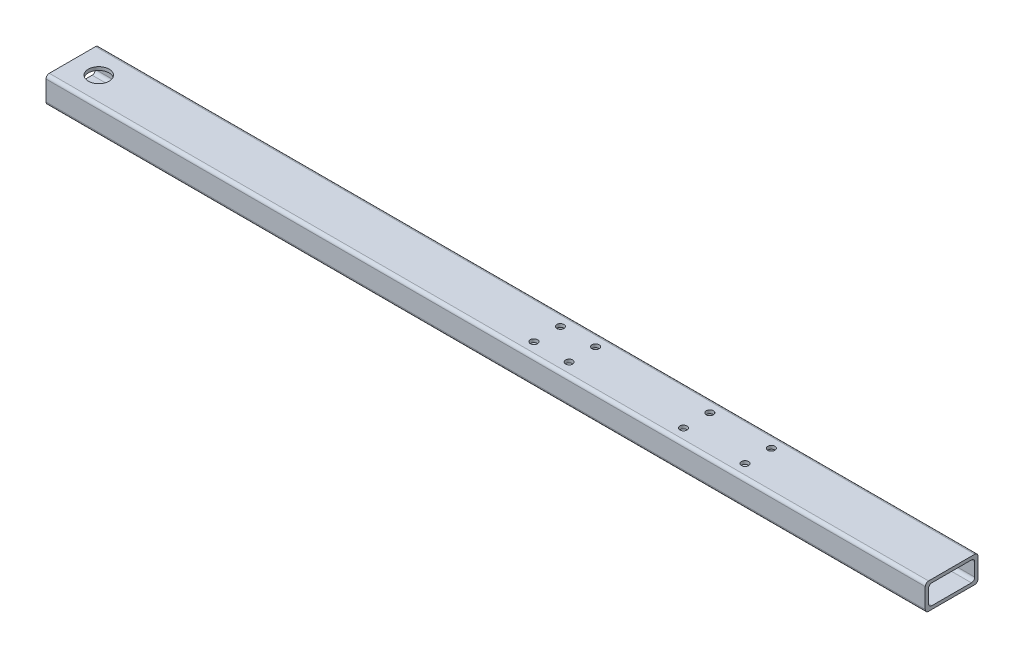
ISO-10303-21;
HEADER;
FILE_DESCRIPTION(('STEP AP214'),'2;1');
FILE_NAME('part.step','',(''),(''),'','','');
FILE_SCHEMA(('AUTOMOTIVE_DESIGN { 1 0 10303 214 1 1 1 1 }'));
ENDSEC;
DATA;
#1=APPLICATION_CONTEXT('core data for automotive mechanical design processes');
#2=APPLICATION_PROTOCOL_DEFINITION('international standard','automotive_design',2000,#1);
#3=PRODUCT_CONTEXT('',#1,'mechanical');
#4=PRODUCT('Part','Part','',(#3));
#5=PRODUCT_RELATED_PRODUCT_CATEGORY('part','',(#4));
#6=PRODUCT_DEFINITION_FORMATION('','',#4);
#7=PRODUCT_DEFINITION_CONTEXT('part definition',#1,'design');
#8=PRODUCT_DEFINITION('design','',#6,#7);
#9=PRODUCT_DEFINITION_SHAPE('','',#8);
#10=(LENGTH_UNIT() NAMED_UNIT(*) SI_UNIT(.MILLI.,.METRE.));
#11=(NAMED_UNIT(*) PLANE_ANGLE_UNIT() SI_UNIT($,.RADIAN.));
#12=(NAMED_UNIT(*) SI_UNIT($,.STERADIAN.) SOLID_ANGLE_UNIT());
#13=UNCERTAINTY_MEASURE_WITH_UNIT(LENGTH_MEASURE(1.E-05),#10,'distance_accuracy_value','');
#14=(GEOMETRIC_REPRESENTATION_CONTEXT(3) GLOBAL_UNCERTAINTY_ASSIGNED_CONTEXT((#13)) GLOBAL_UNIT_ASSIGNED_CONTEXT((#10,
#11,#12)) REPRESENTATION_CONTEXT('',''));
#15=CARTESIAN_POINT('',(0.,0.,0.));
#16=DIRECTION('',(0.,0.,1.));
#17=DIRECTION('',(1.,0.,0.));
#18=AXIS2_PLACEMENT_3D('',#15,#16,#17);
#19=CARTESIAN_POINT('',(0.,76.2,0.));
#20=DIRECTION('',(0.,-1.,0.));
#21=DIRECTION('',(0.,0.,-1.));
#22=AXIS2_PLACEMENT_3D('',#19,#20,#21);
#23=PLANE('',#22);
#24=CARTESIAN_POINT('',(-736.6,76.2,114.3));
#25=DIRECTION('',(0.,-1.,0.));
#26=DIRECTION('',(0.,0.,-1.));
#27=AXIS2_PLACEMENT_3D('',#24,#25,#26);
#28=CIRCLE('',#27,10.31875);
#29=CARTESIAN_POINT('',(-736.6,76.2,124.61875));
#30=VERTEX_POINT('',#29);
#31=EDGE_CURVE('E309',#30,#30,#28,.T.);
#32=ORIENTED_EDGE('',*,*,#31,.T.);
#33=EDGE_LOOP('',(#32));
#34=FACE_BOUND('',#33,.T.);
#35=CARTESIAN_POINT('',(-1066.8,76.2,114.3));
#36=DIRECTION('',(0.,-1.,0.));
#37=DIRECTION('',(0.,0.,-1.));
#38=AXIS2_PLACEMENT_3D('',#35,#36,#37);
#39=CIRCLE('',#38,10.31875);
#40=CARTESIAN_POINT('',(-1066.8,76.2,124.61875));
#41=VERTEX_POINT('',#40);
#42=EDGE_CURVE('E325',#41,#41,#39,.T.);
#43=ORIENTED_EDGE('',*,*,#42,.T.);
#44=EDGE_LOOP('',(#43));
#45=FACE_BOUND('',#44,.T.);
#46=CARTESIAN_POINT('',(-558.8,76.2,38.1));
#47=DIRECTION('',(0.,1.,0.));
#48=DIRECTION('',(0.,0.,1.));
#49=AXIS2_PLACEMENT_3D('',#46,#47,#48);
#50=CIRCLE('',#49,10.31875);
#51=CARTESIAN_POINT('',(-558.8,76.2,48.41875));
#52=VERTEX_POINT('',#51);
#53=EDGE_CURVE('E332',#52,#52,#50,.T.);
#54=ORIENTED_EDGE('',*,*,#53,.F.);
#55=EDGE_LOOP('',(#54));
#56=FACE_BOUND('',#55,.T.);
#57=CARTESIAN_POINT('',(-736.6,76.2,38.1));
#58=DIRECTION('',(0.,1.,0.));
#59=DIRECTION('',(0.,0.,1.));
#60=AXIS2_PLACEMENT_3D('',#57,#58,#59);
#61=CIRCLE('',#60,10.31875);
#62=CARTESIAN_POINT('',(-736.6,76.2,48.41875));
#63=VERTEX_POINT('',#62);
#64=EDGE_CURVE('E339',#63,#63,#61,.T.);
#65=ORIENTED_EDGE('',*,*,#64,.F.);
#66=EDGE_LOOP('',(#65));
#67=FACE_BOUND('',#66,.T.);
#68=CARTESIAN_POINT('',(-1168.4,76.2,38.1));
#69=DIRECTION('',(0.,1.,0.));
#70=DIRECTION('',(0.,0.,1.));
#71=AXIS2_PLACEMENT_3D('',#68,#69,#70);
#72=CIRCLE('',#71,10.31875);
#73=CARTESIAN_POINT('',(-1168.4,76.2,48.41875));
#74=VERTEX_POINT('',#73);
#75=EDGE_CURVE('E346',#74,#74,#72,.T.);
#76=ORIENTED_EDGE('',*,*,#75,.F.);
#77=EDGE_LOOP('',(#76));
#78=FACE_BOUND('',#77,.T.);
#79=CARTESIAN_POINT('',(-1066.8,76.2,38.1));
#80=DIRECTION('',(0.,1.,0.));
#81=DIRECTION('',(0.,0.,1.));
#82=AXIS2_PLACEMENT_3D('',#79,#80,#81);
#83=CIRCLE('',#82,10.31875);
#84=CARTESIAN_POINT('',(-1066.8,76.2,48.41875));
#85=VERTEX_POINT('',#84);
#86=EDGE_CURVE('E353',#85,#85,#83,.T.);
#87=ORIENTED_EDGE('',*,*,#86,.F.);
#88=EDGE_LOOP('',(#87));
#89=FACE_BOUND('',#88,.T.);
#90=CARTESIAN_POINT('',(-2463.8,76.2,76.2000000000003));
#91=DIRECTION('',(0.,1.,0.));
#92=DIRECTION('',(0.,0.,1.));
#93=AXIS2_PLACEMENT_3D('',#90,#91,#92);
#94=CIRCLE('',#93,30.1624999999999);
#95=CARTESIAN_POINT('',(-2463.8,76.2,106.3625));
#96=VERTEX_POINT('',#95);
#97=EDGE_CURVE('E360',#96,#96,#94,.T.);
#98=ORIENTED_EDGE('',*,*,#97,.F.);
#99=EDGE_LOOP('',(#98));
#100=FACE_BOUND('',#99,.T.);
#101=DIRECTION('',(0.,0.,-1.));
#102=VECTOR('',#101,1.);
#103=CARTESIAN_POINT('',(0.,76.2,0.));
#104=LINE('',#103,#102);
#105=CARTESIAN_POINT('',(0.,76.2,142.875));
#106=VERTEX_POINT('',#105);
#107=CARTESIAN_POINT('',(0.,76.2,9.525));
#108=VERTEX_POINT('',#107);
#109=EDGE_CURVE('E186',#106,#108,#104,.T.);
#110=ORIENTED_EDGE('',*,*,#109,.T.);
#111=DIRECTION('',(-1.,0.,0.));
#112=VECTOR('',#111,1.);
#113=CARTESIAN_POINT('',(0.,76.2,9.525));
#114=LINE('',#113,#112);
#115=CARTESIAN_POINT('',(-2540.,76.2,9.52500000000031));
#116=VERTEX_POINT('',#115);
#117=EDGE_CURVE('E158',#108,#116,#114,.T.);
#118=ORIENTED_EDGE('',*,*,#117,.T.);
#119=DIRECTION('',(0.,0.,1.));
#120=VECTOR('',#119,1.);
#121=CARTESIAN_POINT('',(-2540.,76.2,3.11050013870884E-13));
#122=LINE('',#121,#120);
#123=CARTESIAN_POINT('',(-2540.,76.2,142.875));
#124=VERTEX_POINT('',#123);
#125=EDGE_CURVE('E189',#116,#124,#122,.T.);
#126=ORIENTED_EDGE('',*,*,#125,.T.);
#127=DIRECTION('',(1.,0.,0.));
#128=VECTOR('',#127,1.);
#129=CARTESIAN_POINT('',(0.,76.2,142.875));
#130=LINE('',#129,#128);
#131=EDGE_CURVE('E250',#124,#106,#130,.T.);
#132=ORIENTED_EDGE('',*,*,#131,.T.);
#133=EDGE_LOOP('',(#110,#118,#126,#132));
#134=FACE_BOUND('',#133,.T.);
#135=CARTESIAN_POINT('',(-1168.4,76.2,114.3));
#136=DIRECTION('',(0.,-1.,0.));
#137=DIRECTION('',(0.,0.,-1.));
#138=AXIS2_PLACEMENT_3D('',#135,#136,#137);
#139=CIRCLE('',#138,10.31875);
#140=CARTESIAN_POINT('',(-1168.4,76.2,124.61875));
#141=VERTEX_POINT('',#140);
#142=EDGE_CURVE('E306',#141,#141,#139,.T.);
#143=ORIENTED_EDGE('',*,*,#142,.T.);
#144=EDGE_LOOP('',(#143));
#145=FACE_BOUND('',#144,.T.);
#146=CARTESIAN_POINT('',(-558.8,76.2,114.3));
#147=DIRECTION('',(0.,-1.,0.));
#148=DIRECTION('',(0.,0.,-1.));
#149=AXIS2_PLACEMENT_3D('',#146,#147,#148);
#150=CIRCLE('',#149,10.31875);
#151=CARTESIAN_POINT('',(-558.8,76.2,124.61875));
#152=VERTEX_POINT('',#151);
#153=EDGE_CURVE('E476',#152,#152,#150,.T.);
#154=ORIENTED_EDGE('',*,*,#153,.T.);
#155=EDGE_LOOP('',(#154));
#156=FACE_BOUND('',#155,.T.);
#157=ADVANCED_FACE('F31',(#34,#45,#56,#67,#78,#89,#100,#134,#145,#156),#23,.F.);
#158=CARTESIAN_POINT('',(0.,0.,0.));
#159=DIRECTION('',(0.,-1.,0.));
#160=DIRECTION('',(0.,0.,-1.));
#161=AXIS2_PLACEMENT_3D('',#158,#159,#160);
#162=PLANE('',#161);
#163=CARTESIAN_POINT('',(-736.6,0.,114.3));
#164=DIRECTION('',(0.,-1.,0.));
#165=DIRECTION('',(0.,0.,-1.));
#166=AXIS2_PLACEMENT_3D('',#163,#164,#165);
#167=CIRCLE('',#166,10.31875);
#168=CARTESIAN_POINT('',(-736.6,0.,124.61875));
#169=VERTEX_POINT('',#168);
#170=EDGE_CURVE('E302',#169,#169,#167,.T.);
#171=ORIENTED_EDGE('',*,*,#170,.F.);
#172=EDGE_LOOP('',(#171));
#173=FACE_BOUND('',#172,.T.);
#174=CARTESIAN_POINT('',(-1066.8,0.,114.3));
#175=DIRECTION('',(0.,-1.,0.));
#176=DIRECTION('',(0.,0.,-1.));
#177=AXIS2_PLACEMENT_3D('',#174,#175,#176);
#178=CIRCLE('',#177,10.31875);
#179=CARTESIAN_POINT('',(-1066.8,0.,124.61875));
#180=VERTEX_POINT('',#179);
#181=EDGE_CURVE('E294',#180,#180,#178,.T.);
#182=ORIENTED_EDGE('',*,*,#181,.F.);
#183=EDGE_LOOP('',(#182));
#184=FACE_BOUND('',#183,.T.);
#185=CARTESIAN_POINT('',(-558.8,0.,38.1));
#186=DIRECTION('',(0.,1.,0.));
#187=DIRECTION('',(0.,0.,1.));
#188=AXIS2_PLACEMENT_3D('',#185,#186,#187);
#189=CIRCLE('',#188,10.31875);
#190=CARTESIAN_POINT('',(-558.8,0.,48.41875));
#191=VERTEX_POINT('',#190);
#192=EDGE_CURVE('E289',#191,#191,#189,.T.);
#193=ORIENTED_EDGE('',*,*,#192,.T.);
#194=EDGE_LOOP('',(#193));
#195=FACE_BOUND('',#194,.T.);
#196=CARTESIAN_POINT('',(-736.6,0.,38.1));
#197=DIRECTION('',(0.,1.,0.));
#198=DIRECTION('',(0.,0.,1.));
#199=AXIS2_PLACEMENT_3D('',#196,#197,#198);
#200=CIRCLE('',#199,10.31875);
#201=CARTESIAN_POINT('',(-736.6,0.,48.41875));
#202=VERTEX_POINT('',#201);
#203=EDGE_CURVE('E284',#202,#202,#200,.T.);
#204=ORIENTED_EDGE('',*,*,#203,.T.);
#205=EDGE_LOOP('',(#204));
#206=FACE_BOUND('',#205,.T.);
#207=CARTESIAN_POINT('',(-1168.4,0.,38.1));
#208=DIRECTION('',(0.,1.,0.));
#209=DIRECTION('',(0.,0.,1.));
#210=AXIS2_PLACEMENT_3D('',#207,#208,#209);
#211=CIRCLE('',#210,10.31875);
#212=CARTESIAN_POINT('',(-1168.4,0.,48.41875));
#213=VERTEX_POINT('',#212);
#214=EDGE_CURVE('E279',#213,#213,#211,.T.);
#215=ORIENTED_EDGE('',*,*,#214,.T.);
#216=EDGE_LOOP('',(#215));
#217=FACE_BOUND('',#216,.T.);
#218=CARTESIAN_POINT('',(-1066.8,0.,38.1));
#219=DIRECTION('',(0.,1.,0.));
#220=DIRECTION('',(0.,0.,1.));
#221=AXIS2_PLACEMENT_3D('',#218,#219,#220);
#222=CIRCLE('',#221,10.31875);
#223=CARTESIAN_POINT('',(-1066.8,0.,48.41875));
#224=VERTEX_POINT('',#223);
#225=EDGE_CURVE('E274',#224,#224,#222,.T.);
#226=ORIENTED_EDGE('',*,*,#225,.T.);
#227=EDGE_LOOP('',(#226));
#228=FACE_BOUND('',#227,.T.);
#229=CARTESIAN_POINT('',(-2463.8,0.,76.2000000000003));
#230=DIRECTION('',(0.,1.,0.));
#231=DIRECTION('',(0.,0.,1.));
#232=AXIS2_PLACEMENT_3D('',#229,#230,#231);
#233=CIRCLE('',#232,30.1624999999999);
#234=CARTESIAN_POINT('',(-2463.8,0.,106.3625));
#235=VERTEX_POINT('',#234);
#236=EDGE_CURVE('E269',#235,#235,#233,.T.);
#237=ORIENTED_EDGE('',*,*,#236,.T.);
#238=EDGE_LOOP('',(#237));
#239=FACE_BOUND('',#238,.T.);
#240=DIRECTION('',(0.,0.,-1.));
#241=VECTOR('',#240,1.);
#242=CARTESIAN_POINT('',(0.,0.,0.));
#243=LINE('',#242,#241);
#244=CARTESIAN_POINT('',(0.,0.,142.875));
#245=VERTEX_POINT('',#244);
#246=CARTESIAN_POINT('',(0.,0.,9.525));
#247=VERTEX_POINT('',#246);
#248=EDGE_CURVE('E194',#245,#247,#243,.T.);
#249=ORIENTED_EDGE('',*,*,#248,.F.);
#250=DIRECTION('',(1.,0.,0.));
#251=VECTOR('',#250,1.);
#252=CARTESIAN_POINT('',(-2540.,0.,142.875));
#253=LINE('',#252,#251);
#254=CARTESIAN_POINT('',(-2540.,0.,142.875));
#255=VERTEX_POINT('',#254);
#256=EDGE_CURVE('E238',#245,#255,#253,.F.);
#257=ORIENTED_EDGE('',*,*,#256,.T.);
#258=DIRECTION('',(0.,0.,1.));
#259=VECTOR('',#258,1.);
#260=CARTESIAN_POINT('',(-2540.,0.,3.11050013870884E-13));
#261=LINE('',#260,#259);
#262=CARTESIAN_POINT('',(-2540.,0.,9.52500000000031));
#263=VERTEX_POINT('',#262);
#264=EDGE_CURVE('E190',#263,#255,#261,.T.);
#265=ORIENTED_EDGE('',*,*,#264,.F.);
#266=DIRECTION('',(-1.,0.,0.));
#267=VECTOR('',#266,1.);
#268=CARTESIAN_POINT('',(0.,0.,9.525));
#269=LINE('',#268,#267);
#270=EDGE_CURVE('E236',#263,#247,#269,.F.);
#271=ORIENTED_EDGE('',*,*,#270,.T.);
#272=EDGE_LOOP('',(#249,#257,#265,#271));
#273=FACE_BOUND('',#272,.T.);
#274=CARTESIAN_POINT('',(-1168.4,0.,114.3));
#275=DIRECTION('',(0.,-1.,0.));
#276=DIRECTION('',(0.,0.,-1.));
#277=AXIS2_PLACEMENT_3D('',#274,#275,#276);
#278=CIRCLE('',#277,10.31875);
#279=CARTESIAN_POINT('',(-1168.4,0.,124.61875));
#280=VERTEX_POINT('',#279);
#281=EDGE_CURVE('E298',#280,#280,#278,.T.);
#282=ORIENTED_EDGE('',*,*,#281,.F.);
#283=EDGE_LOOP('',(#282));
#284=FACE_BOUND('',#283,.T.);
#285=CARTESIAN_POINT('',(-558.8,0.,114.3));
#286=DIRECTION('',(0.,-1.,0.));
#287=DIRECTION('',(0.,0.,-1.));
#288=AXIS2_PLACEMENT_3D('',#285,#286,#287);
#289=CIRCLE('',#288,10.31875);
#290=CARTESIAN_POINT('',(-558.8,0.,124.61875));
#291=VERTEX_POINT('',#290);
#292=EDGE_CURVE('E474',#291,#291,#289,.T.);
#293=ORIENTED_EDGE('',*,*,#292,.F.);
#294=EDGE_LOOP('',(#293));
#295=FACE_BOUND('',#294,.T.);
#296=ADVANCED_FACE('F406',(#173,#184,#195,#206,#217,#228,#239,#273,#284,#295),#162,.T.);
#297=CARTESIAN_POINT('',(-2540.,9.525,9.5250000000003));
#298=DIRECTION('',(0.,-1.,0.));
#299=DIRECTION('',(0.,0.,-1.));
#300=AXIS2_PLACEMENT_3D('',#297,#298,#299);
#301=PLANE('',#300);
#302=CARTESIAN_POINT('',(-736.6,9.52499999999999,114.3));
#303=DIRECTION('',(0.,-1.,0.));
#304=DIRECTION('',(0.,0.,-1.));
#305=AXIS2_PLACEMENT_3D('',#302,#303,#304);
#306=CIRCLE('',#305,10.31875);
#307=CARTESIAN_POINT('',(-736.6,9.52499999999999,124.61875));
#308=VERTEX_POINT('',#307);
#309=EDGE_CURVE('E301',#308,#308,#306,.F.);
#310=ORIENTED_EDGE('',*,*,#309,.F.);
#311=EDGE_LOOP('',(#310));
#312=FACE_BOUND('',#311,.T.);
#313=CARTESIAN_POINT('',(-1066.8,9.52499999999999,114.3));
#314=DIRECTION('',(0.,-1.,0.));
#315=DIRECTION('',(0.,0.,-1.));
#316=AXIS2_PLACEMENT_3D('',#313,#314,#315);
#317=CIRCLE('',#316,10.31875);
#318=CARTESIAN_POINT('',(-1066.8,9.52499999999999,124.61875));
#319=VERTEX_POINT('',#318);
#320=EDGE_CURVE('E293',#319,#319,#317,.F.);
#321=ORIENTED_EDGE('',*,*,#320,.F.);
#322=EDGE_LOOP('',(#321));
#323=FACE_BOUND('',#322,.T.);
#324=CARTESIAN_POINT('',(-558.8,9.525,38.1));
#325=DIRECTION('',(0.,-1.,0.));
#326=DIRECTION('',(0.,0.,-1.));
#327=AXIS2_PLACEMENT_3D('',#324,#325,#326);
#328=CIRCLE('',#327,10.31875);
#329=CARTESIAN_POINT('',(-558.8,9.52499999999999,48.41875));
#330=VERTEX_POINT('',#329);
#331=EDGE_CURVE('E288',#330,#330,#328,.T.);
#332=ORIENTED_EDGE('',*,*,#331,.T.);
#333=EDGE_LOOP('',(#332));
#334=FACE_BOUND('',#333,.T.);
#335=CARTESIAN_POINT('',(-736.6,9.525,38.1));
#336=DIRECTION('',(0.,-1.,0.));
#337=DIRECTION('',(0.,0.,-1.));
#338=AXIS2_PLACEMENT_3D('',#335,#336,#337);
#339=CIRCLE('',#338,10.31875);
#340=CARTESIAN_POINT('',(-736.6,9.52499999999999,48.41875));
#341=VERTEX_POINT('',#340);
#342=EDGE_CURVE('E283',#341,#341,#339,.T.);
#343=ORIENTED_EDGE('',*,*,#342,.T.);
#344=EDGE_LOOP('',(#343));
#345=FACE_BOUND('',#344,.T.);
#346=CARTESIAN_POINT('',(-1168.4,9.525,38.1));
#347=DIRECTION('',(0.,-1.,0.));
#348=DIRECTION('',(0.,0.,-1.));
#349=AXIS2_PLACEMENT_3D('',#346,#347,#348);
#350=CIRCLE('',#349,10.31875);
#351=CARTESIAN_POINT('',(-1168.4,9.52499999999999,48.41875));
#352=VERTEX_POINT('',#351);
#353=EDGE_CURVE('E278',#352,#352,#350,.T.);
#354=ORIENTED_EDGE('',*,*,#353,.T.);
#355=EDGE_LOOP('',(#354));
#356=FACE_BOUND('',#355,.T.);
#357=CARTESIAN_POINT('',(-1066.8,9.525,38.1));
#358=DIRECTION('',(0.,-1.,0.));
#359=DIRECTION('',(0.,0.,-1.));
#360=AXIS2_PLACEMENT_3D('',#357,#358,#359);
#361=CIRCLE('',#360,10.31875);
#362=CARTESIAN_POINT('',(-1066.8,9.52499999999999,48.41875));
#363=VERTEX_POINT('',#362);
#364=EDGE_CURVE('E273',#363,#363,#361,.T.);
#365=ORIENTED_EDGE('',*,*,#364,.T.);
#366=EDGE_LOOP('',(#365));
#367=FACE_BOUND('',#366,.T.);
#368=CARTESIAN_POINT('',(-2463.8,9.52499999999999,76.2000000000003));
#369=DIRECTION('',(0.,-1.,0.));
#370=DIRECTION('',(0.,0.,-1.));
#371=AXIS2_PLACEMENT_3D('',#368,#369,#370);
#372=CIRCLE('',#371,30.1624999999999);
#373=CARTESIAN_POINT('',(-2463.8,9.52499999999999,106.3625));
#374=VERTEX_POINT('',#373);
#375=EDGE_CURVE('E268',#374,#374,#372,.T.);
#376=ORIENTED_EDGE('',*,*,#375,.T.);
#377=EDGE_LOOP('',(#376));
#378=FACE_BOUND('',#377,.T.);
#379=DIRECTION('',(0.,0.,-1.));
#380=VECTOR('',#379,1.);
#381=CARTESIAN_POINT('',(-2540.,9.525,9.5250000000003));
#382=LINE('',#381,#380);
#383=CARTESIAN_POINT('',(-2540.,9.52499999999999,133.35));
#384=VERTEX_POINT('',#383);
#385=CARTESIAN_POINT('',(-2540.,9.525,19.0500000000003));
#386=VERTEX_POINT('',#385);
#387=EDGE_CURVE('E168',#384,#386,#382,.T.);
#388=ORIENTED_EDGE('',*,*,#387,.F.);
#389=DIRECTION('',(1.,0.,0.));
#390=VECTOR('',#389,1.);
#391=CARTESIAN_POINT('',(0.,9.52499999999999,133.35));
#392=LINE('',#391,#390);
#393=CARTESIAN_POINT('',(0.,9.52499999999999,133.35));
#394=VERTEX_POINT('',#393);
#395=EDGE_CURVE('E151',#384,#394,#392,.T.);
#396=ORIENTED_EDGE('',*,*,#395,.T.);
#397=DIRECTION('',(0.,0.,-1.));
#398=VECTOR('',#397,1.);
#399=CARTESIAN_POINT('',(0.,9.525,9.52499999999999));
#400=LINE('',#399,#398);
#401=CARTESIAN_POINT('',(0.,9.525,19.05));
#402=VERTEX_POINT('',#401);
#403=EDGE_CURVE('E165',#394,#402,#400,.T.);
#404=ORIENTED_EDGE('',*,*,#403,.T.);
#405=DIRECTION('',(1.,0.,0.));
#406=VECTOR('',#405,1.);
#407=CARTESIAN_POINT('',(-2540.,9.525,19.0500000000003));
#408=LINE('',#407,#406);
#409=EDGE_CURVE('E170',#402,#386,#408,.F.);
#410=ORIENTED_EDGE('',*,*,#409,.T.);
#411=EDGE_LOOP('',(#388,#396,#404,#410));
#412=FACE_BOUND('',#411,.T.);
#413=CARTESIAN_POINT('',(-1168.4,9.52499999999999,114.3));
#414=DIRECTION('',(0.,-1.,0.));
#415=DIRECTION('',(0.,0.,-1.));
#416=AXIS2_PLACEMENT_3D('',#413,#414,#415);
#417=CIRCLE('',#416,10.31875);
#418=CARTESIAN_POINT('',(-1168.4,9.52499999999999,124.61875));
#419=VERTEX_POINT('',#418);
#420=EDGE_CURVE('E297',#419,#419,#417,.F.);
#421=ORIENTED_EDGE('',*,*,#420,.F.);
#422=EDGE_LOOP('',(#421));
#423=FACE_BOUND('',#422,.T.);
#424=CARTESIAN_POINT('',(-558.8,9.52499999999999,114.3));
#425=DIRECTION('',(0.,-1.,0.));
#426=DIRECTION('',(0.,0.,-1.));
#427=AXIS2_PLACEMENT_3D('',#424,#425,#426);
#428=CIRCLE('',#427,10.31875);
#429=CARTESIAN_POINT('',(-558.8,9.52499999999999,124.61875));
#430=VERTEX_POINT('',#429);
#431=EDGE_CURVE('E314',#430,#430,#428,.F.);
#432=ORIENTED_EDGE('',*,*,#431,.F.);
#433=EDGE_LOOP('',(#432));
#434=FACE_BOUND('',#433,.T.);
#435=ADVANCED_FACE('F163',(#312,#323,#334,#345,#356,#367,#378,#412,#423,#434),#301,.F.);
#436=CARTESIAN_POINT('',(-2540.,66.675,9.52500000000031));
#437=DIRECTION('',(0.,1.,0.));
#438=DIRECTION('',(0.,0.,1.));
#439=AXIS2_PLACEMENT_3D('',#436,#437,#438);
#440=PLANE('',#439);
#441=CARTESIAN_POINT('',(-736.6,66.675,114.3));
#442=DIRECTION('',(0.,1.,0.));
#443=DIRECTION('',(0.,0.,1.));
#444=AXIS2_PLACEMENT_3D('',#441,#442,#443);
#445=CIRCLE('',#444,10.31875);
#446=CARTESIAN_POINT('',(-736.6,66.675,124.61875));
#447=VERTEX_POINT('',#446);
#448=EDGE_CURVE('E299',#447,#447,#445,.F.);
#449=ORIENTED_EDGE('',*,*,#448,.F.);
#450=EDGE_LOOP('',(#449));
#451=FACE_BOUND('',#450,.T.);
#452=CARTESIAN_POINT('',(-1066.8,66.675,114.3));
#453=DIRECTION('',(0.,1.,0.));
#454=DIRECTION('',(0.,0.,1.));
#455=AXIS2_PLACEMENT_3D('',#452,#453,#454);
#456=CIRCLE('',#455,10.31875);
#457=CARTESIAN_POINT('',(-1066.8,66.675,124.61875));
#458=VERTEX_POINT('',#457);
#459=EDGE_CURVE('E290',#458,#458,#456,.F.);
#460=ORIENTED_EDGE('',*,*,#459,.F.);
#461=EDGE_LOOP('',(#460));
#462=FACE_BOUND('',#461,.T.);
#463=CARTESIAN_POINT('',(-558.8,66.675,38.1));
#464=DIRECTION('',(0.,1.,0.));
#465=DIRECTION('',(0.,0.,1.));
#466=AXIS2_PLACEMENT_3D('',#463,#464,#465);
#467=CIRCLE('',#466,10.31875);
#468=CARTESIAN_POINT('',(-558.8,66.675,48.41875));
#469=VERTEX_POINT('',#468);
#470=EDGE_CURVE('E285',#469,#469,#467,.T.);
#471=ORIENTED_EDGE('',*,*,#470,.T.);
#472=EDGE_LOOP('',(#471));
#473=FACE_BOUND('',#472,.T.);
#474=CARTESIAN_POINT('',(-736.6,66.675,38.1));
#475=DIRECTION('',(0.,1.,0.));
#476=DIRECTION('',(0.,0.,1.));
#477=AXIS2_PLACEMENT_3D('',#474,#475,#476);
#478=CIRCLE('',#477,10.31875);
#479=CARTESIAN_POINT('',(-736.6,66.675,48.41875));
#480=VERTEX_POINT('',#479);
#481=EDGE_CURVE('E280',#480,#480,#478,.T.);
#482=ORIENTED_EDGE('',*,*,#481,.T.);
#483=EDGE_LOOP('',(#482));
#484=FACE_BOUND('',#483,.T.);
#485=CARTESIAN_POINT('',(-1168.4,66.675,38.1));
#486=DIRECTION('',(0.,1.,0.));
#487=DIRECTION('',(0.,0.,1.));
#488=AXIS2_PLACEMENT_3D('',#485,#486,#487);
#489=CIRCLE('',#488,10.31875);
#490=CARTESIAN_POINT('',(-1168.4,66.675,48.41875));
#491=VERTEX_POINT('',#490);
#492=EDGE_CURVE('E275',#491,#491,#489,.T.);
#493=ORIENTED_EDGE('',*,*,#492,.T.);
#494=EDGE_LOOP('',(#493));
#495=FACE_BOUND('',#494,.T.);
#496=CARTESIAN_POINT('',(-1066.8,66.675,38.1));
#497=DIRECTION('',(0.,1.,0.));
#498=DIRECTION('',(0.,0.,1.));
#499=AXIS2_PLACEMENT_3D('',#496,#497,#498);
#500=CIRCLE('',#499,10.31875);
#501=CARTESIAN_POINT('',(-1066.8,66.675,48.41875));
#502=VERTEX_POINT('',#501);
#503=EDGE_CURVE('E270',#502,#502,#500,.T.);
#504=ORIENTED_EDGE('',*,*,#503,.T.);
#505=EDGE_LOOP('',(#504));
#506=FACE_BOUND('',#505,.T.);
#507=CARTESIAN_POINT('',(-2463.8,66.675,76.2000000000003));
#508=DIRECTION('',(0.,1.,0.));
#509=DIRECTION('',(0.,0.,1.));
#510=AXIS2_PLACEMENT_3D('',#507,#508,#509);
#511=CIRCLE('',#510,30.1624999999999);
#512=CARTESIAN_POINT('',(-2463.8,66.675,106.3625));
#513=VERTEX_POINT('',#512);
#514=EDGE_CURVE('E265',#513,#513,#511,.T.);
#515=ORIENTED_EDGE('',*,*,#514,.T.);
#516=EDGE_LOOP('',(#515));
#517=FACE_BOUND('',#516,.T.);
#518=DIRECTION('',(0.,0.,1.));
#519=VECTOR('',#518,1.);
#520=CARTESIAN_POINT('',(-2540.,66.675,9.52500000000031));
#521=LINE('',#520,#519);
#522=CARTESIAN_POINT('',(-2540.,66.675,19.0500000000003));
#523=VERTEX_POINT('',#522);
#524=CARTESIAN_POINT('',(-2540.,66.675,133.35));
#525=VERTEX_POINT('',#524);
#526=EDGE_CURVE('E180',#523,#525,#521,.T.);
#527=ORIENTED_EDGE('',*,*,#526,.F.);
#528=DIRECTION('',(1.,0.,0.));
#529=VECTOR('',#528,1.);
#530=CARTESIAN_POINT('',(0.,66.675,19.05));
#531=LINE('',#530,#529);
#532=CARTESIAN_POINT('',(0.,66.675,19.05));
#533=VERTEX_POINT('',#532);
#534=EDGE_CURVE('E215',#523,#533,#531,.T.);
#535=ORIENTED_EDGE('',*,*,#534,.T.);
#536=DIRECTION('',(0.,0.,1.));
#537=VECTOR('',#536,1.);
#538=CARTESIAN_POINT('',(0.,66.675,9.525));
#539=LINE('',#538,#537);
#540=CARTESIAN_POINT('',(0.,66.675,133.35));
#541=VERTEX_POINT('',#540);
#542=EDGE_CURVE('E182',#533,#541,#539,.T.);
#543=ORIENTED_EDGE('',*,*,#542,.T.);
#544=DIRECTION('',(1.,0.,0.));
#545=VECTOR('',#544,1.);
#546=CARTESIAN_POINT('',(-2540.,66.675,133.35));
#547=LINE('',#546,#545);
#548=EDGE_CURVE('E213',#541,#525,#547,.F.);
#549=ORIENTED_EDGE('',*,*,#548,.T.);
#550=EDGE_LOOP('',(#527,#535,#543,#549));
#551=FACE_BOUND('',#550,.T.);
#552=CARTESIAN_POINT('',(-1168.4,66.675,114.3));
#553=DIRECTION('',(0.,1.,0.));
#554=DIRECTION('',(0.,0.,1.));
#555=AXIS2_PLACEMENT_3D('',#552,#553,#554);
#556=CIRCLE('',#555,10.31875);
#557=CARTESIAN_POINT('',(-1168.4,66.675,124.61875));
#558=VERTEX_POINT('',#557);
#559=EDGE_CURVE('E295',#558,#558,#556,.F.);
#560=ORIENTED_EDGE('',*,*,#559,.F.);
#561=EDGE_LOOP('',(#560));
#562=FACE_BOUND('',#561,.T.);
#563=CARTESIAN_POINT('',(-558.8,66.675,114.3));
#564=DIRECTION('',(0.,1.,0.));
#565=DIRECTION('',(0.,0.,1.));
#566=AXIS2_PLACEMENT_3D('',#563,#564,#565);
#567=CIRCLE('',#566,10.31875);
#568=CARTESIAN_POINT('',(-558.8,66.675,124.61875));
#569=VERTEX_POINT('',#568);
#570=EDGE_CURVE('E35',#569,#569,#567,.F.);
#571=ORIENTED_EDGE('',*,*,#570,.F.);
#572=EDGE_LOOP('',(#571));
#573=FACE_BOUND('',#572,.T.);
#574=ADVANCED_FACE('F379',(#451,#462,#473,#484,#495,#506,#517,#551,#562,#573),#440,.F.);
#575=CARTESIAN_POINT('',(0.,76.2,0.));
#576=DIRECTION('',(-1.,0.,0.));
#577=DIRECTION('',(0.,0.,1.));
#578=AXIS2_PLACEMENT_3D('',#575,#576,#577);
#579=PLANE('',#578);
#580=ORIENTED_EDGE('',*,*,#542,.F.);
#581=CARTESIAN_POINT('',(0.,57.15,19.05));
#582=DIRECTION('',(-1.,0.,0.));
#583=DIRECTION('',(0.,0.,1.));
#584=AXIS2_PLACEMENT_3D('',#581,#582,#583);
#585=CIRCLE('',#584,9.525);
#586=CARTESIAN_POINT('',(0.,57.15,9.525));
#587=VERTEX_POINT('',#586);
#588=EDGE_CURVE('E256',#533,#587,#585,.T.);
#589=ORIENTED_EDGE('',*,*,#588,.T.);
#590=DIRECTION('',(0.,1.,0.));
#591=VECTOR('',#590,1.);
#592=CARTESIAN_POINT('',(0.,66.675,9.525));
#593=LINE('',#592,#591);
#594=CARTESIAN_POINT('',(0.,19.05,9.52499999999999));
#595=VERTEX_POINT('',#594);
#596=EDGE_CURVE('E366',#595,#587,#593,.T.);
#597=ORIENTED_EDGE('',*,*,#596,.F.);
#598=CARTESIAN_POINT('',(0.,19.05,19.05));
#599=DIRECTION('',(-1.,0.,0.));
#600=DIRECTION('',(0.,0.,1.));
#601=AXIS2_PLACEMENT_3D('',#598,#599,#600);
#602=CIRCLE('',#601,9.525);
#603=EDGE_CURVE('E40',#595,#402,#602,.T.);
#604=ORIENTED_EDGE('',*,*,#603,.T.);
#605=ORIENTED_EDGE('',*,*,#403,.F.);
#606=CARTESIAN_POINT('',(0.,19.05,133.35));
#607=DIRECTION('',(-1.,0.,0.));
#608=DIRECTION('',(0.,0.,1.));
#609=AXIS2_PLACEMENT_3D('',#606,#607,#608);
#610=CIRCLE('',#609,9.525);
#611=CARTESIAN_POINT('',(0.,19.05,142.875));
#612=VERTEX_POINT('',#611);
#613=EDGE_CURVE('E147',#394,#612,#610,.T.);
#614=ORIENTED_EDGE('',*,*,#613,.T.);
#615=DIRECTION('',(0.,-1.,0.));
#616=VECTOR('',#615,1.);
#617=CARTESIAN_POINT('',(0.,66.675,142.875));
#618=LINE('',#617,#616);
#619=CARTESIAN_POINT('',(0.,57.15,142.875));
#620=VERTEX_POINT('',#619);
#621=EDGE_CURVE('E177',#620,#612,#618,.T.);
#622=ORIENTED_EDGE('',*,*,#621,.F.);
#623=CARTESIAN_POINT('',(0.,57.15,133.35));
#624=DIRECTION('',(-1.,0.,0.));
#625=DIRECTION('',(0.,0.,1.));
#626=AXIS2_PLACEMENT_3D('',#623,#624,#625);
#627=CIRCLE('',#626,9.525);
#628=EDGE_CURVE('E260',#620,#541,#627,.T.);
#629=ORIENTED_EDGE('',*,*,#628,.T.);
#630=EDGE_LOOP('',(#580,#589,#597,#604,#605,#614,#622,#629));
#631=FACE_BOUND('',#630,.T.);
#632=DIRECTION('',(0.,-1.,0.));
#633=VECTOR('',#632,1.);
#634=CARTESIAN_POINT('',(0.,76.2,152.4));
#635=LINE('',#634,#633);
#636=CARTESIAN_POINT('',(0.,66.675,152.4));
#637=VERTEX_POINT('',#636);
#638=CARTESIAN_POINT('',(0.,9.52500000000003,152.4));
#639=VERTEX_POINT('',#638);
#640=EDGE_CURVE('E193',#637,#639,#635,.T.);
#641=ORIENTED_EDGE('',*,*,#640,.T.);
#642=CARTESIAN_POINT('',(0.,9.52500000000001,142.875));
#643=DIRECTION('',(-1.,0.,0.));
#644=DIRECTION('',(0.,0.,1.));
#645=AXIS2_PLACEMENT_3D('',#642,#643,#644);
#646=CIRCLE('',#645,9.525);
#647=EDGE_CURVE('E234',#639,#245,#646,.F.);
#648=ORIENTED_EDGE('',*,*,#647,.T.);
#649=ORIENTED_EDGE('',*,*,#248,.T.);
#650=CARTESIAN_POINT('',(0.,9.52500000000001,9.525));
#651=DIRECTION('',(-1.,0.,0.));
#652=DIRECTION('',(0.,0.,1.));
#653=AXIS2_PLACEMENT_3D('',#650,#651,#652);
#654=CIRCLE('',#653,9.525);
#655=CARTESIAN_POINT('',(0.,9.52500000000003,0.));
#656=VERTEX_POINT('',#655);
#657=EDGE_CURVE('E232',#247,#656,#654,.F.);
#658=ORIENTED_EDGE('',*,*,#657,.T.);
#659=DIRECTION('',(0.,-1.,0.));
#660=VECTOR('',#659,1.);
#661=CARTESIAN_POINT('',(0.,76.2,0.));
#662=LINE('',#661,#660);
#663=CARTESIAN_POINT('',(0.,66.675,0.));
#664=VERTEX_POINT('',#663);
#665=EDGE_CURVE('E206',#664,#656,#662,.T.);
#666=ORIENTED_EDGE('',*,*,#665,.F.);
#667=CARTESIAN_POINT('',(0.,66.675,9.525));
#668=DIRECTION('',(-1.,0.,0.));
#669=DIRECTION('',(0.,0.,1.));
#670=AXIS2_PLACEMENT_3D('',#667,#668,#669);
#671=CIRCLE('',#670,9.525);
#672=EDGE_CURVE('E230',#664,#108,#671,.F.);
#673=ORIENTED_EDGE('',*,*,#672,.T.);
#674=ORIENTED_EDGE('',*,*,#109,.F.);
#675=CARTESIAN_POINT('',(0.,66.675,142.875));
#676=DIRECTION('',(-1.,0.,0.));
#677=DIRECTION('',(0.,0.,1.));
#678=AXIS2_PLACEMENT_3D('',#675,#676,#677);
#679=CIRCLE('',#678,9.525);
#680=EDGE_CURVE('E228',#106,#637,#679,.F.);
#681=ORIENTED_EDGE('',*,*,#680,.T.);
#682=EDGE_LOOP('',(#641,#648,#649,#658,#666,#673,#674,#681));
#683=FACE_BOUND('',#682,.T.);
#684=ADVANCED_FACE('F173',(#631,#683),#579,.F.);
#685=CARTESIAN_POINT('',(0.,76.2,0.));
#686=DIRECTION('',(0.,0.,1.));
#687=DIRECTION('',(1.,0.,0.));
#688=AXIS2_PLACEMENT_3D('',#685,#686,#687);
#689=PLANE('',#688);
#690=ORIENTED_EDGE('',*,*,#665,.T.);
#691=DIRECTION('',(-1.,0.,0.));
#692=VECTOR('',#691,1.);
#693=CARTESIAN_POINT('',(-2540.,9.52500000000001,3.11050013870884E-13));
#694=LINE('',#693,#692);
#695=CARTESIAN_POINT('',(-2540.,9.52500000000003,3.11050013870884E-13));
#696=VERTEX_POINT('',#695);
#697=EDGE_CURVE('E248',#656,#696,#694,.T.);
#698=ORIENTED_EDGE('',*,*,#697,.T.);
#699=DIRECTION('',(0.,-1.,0.));
#700=VECTOR('',#699,1.);
#701=CARTESIAN_POINT('',(-2540.,76.2,3.11050013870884E-13));
#702=LINE('',#701,#700);
#703=CARTESIAN_POINT('',(-2540.,66.675,3.11050013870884E-13));
#704=VERTEX_POINT('',#703);
#705=EDGE_CURVE('E204',#704,#696,#702,.T.);
#706=ORIENTED_EDGE('',*,*,#705,.F.);
#707=DIRECTION('',(-1.,0.,0.));
#708=VECTOR('',#707,1.);
#709=CARTESIAN_POINT('',(0.,66.675,0.));
#710=LINE('',#709,#708);
#711=EDGE_CURVE('E246',#704,#664,#710,.F.);
#712=ORIENTED_EDGE('',*,*,#711,.T.);
#713=EDGE_LOOP('',(#690,#698,#706,#712));
#714=FACE_BOUND('',#713,.T.);
#715=ADVANCED_FACE('F421',(#714),#689,.F.);
#716=CARTESIAN_POINT('',(-2540.,76.2,3.11050013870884E-13));
#717=DIRECTION('',(1.,0.,0.));
#718=DIRECTION('',(0.,0.,-1.));
#719=AXIS2_PLACEMENT_3D('',#716,#717,#718);
#720=PLANE('',#719);
#721=DIRECTION('',(0.,-1.,0.));
#722=VECTOR('',#721,1.);
#723=CARTESIAN_POINT('',(-2540.,66.675,142.875));
#724=LINE('',#723,#722);
#725=CARTESIAN_POINT('',(-2540.,57.15,142.875));
#726=VERTEX_POINT('',#725);
#727=CARTESIAN_POINT('',(-2540.,19.05,142.875));
#728=VERTEX_POINT('',#727);
#729=EDGE_CURVE('E370',#726,#728,#724,.T.);
#730=ORIENTED_EDGE('',*,*,#729,.T.);
#731=CARTESIAN_POINT('',(-2540.,19.05,133.35));
#732=DIRECTION('',(1.,0.,0.));
#733=DIRECTION('',(0.,0.,-1.));
#734=AXIS2_PLACEMENT_3D('',#731,#732,#733);
#735=CIRCLE('',#734,9.525);
#736=EDGE_CURVE('E157',#728,#384,#735,.T.);
#737=ORIENTED_EDGE('',*,*,#736,.T.);
#738=ORIENTED_EDGE('',*,*,#387,.T.);
#739=CARTESIAN_POINT('',(-2540.,19.05,19.0500000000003));
#740=DIRECTION('',(1.,0.,0.));
#741=DIRECTION('',(0.,0.,-1.));
#742=AXIS2_PLACEMENT_3D('',#739,#740,#741);
#743=CIRCLE('',#742,9.525);
#744=CARTESIAN_POINT('',(-2540.,19.05,9.5250000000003));
#745=VERTEX_POINT('',#744);
#746=EDGE_CURVE('E11',#386,#745,#743,.T.);
#747=ORIENTED_EDGE('',*,*,#746,.T.);
#748=DIRECTION('',(0.,1.,0.));
#749=VECTOR('',#748,1.);
#750=CARTESIAN_POINT('',(-2540.,66.675,9.52500000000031));
#751=LINE('',#750,#749);
#752=CARTESIAN_POINT('',(-2540.,57.15,9.52500000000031));
#753=VERTEX_POINT('',#752);
#754=EDGE_CURVE('E176',#745,#753,#751,.T.);
#755=ORIENTED_EDGE('',*,*,#754,.T.);
#756=CARTESIAN_POINT('',(-2540.,57.15,19.0500000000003));
#757=DIRECTION('',(1.,0.,0.));
#758=DIRECTION('',(0.,0.,-1.));
#759=AXIS2_PLACEMENT_3D('',#756,#757,#758);
#760=CIRCLE('',#759,9.525);
#761=EDGE_CURVE('E258',#753,#523,#760,.T.);
#762=ORIENTED_EDGE('',*,*,#761,.T.);
#763=ORIENTED_EDGE('',*,*,#526,.T.);
#764=CARTESIAN_POINT('',(-2540.,57.15,133.35));
#765=DIRECTION('',(1.,0.,0.));
#766=DIRECTION('',(0.,0.,-1.));
#767=AXIS2_PLACEMENT_3D('',#764,#765,#766);
#768=CIRCLE('',#767,9.525);
#769=EDGE_CURVE('E262',#525,#726,#768,.T.);
#770=ORIENTED_EDGE('',*,*,#769,.T.);
#771=EDGE_LOOP('',(#730,#737,#738,#747,#755,#762,#763,#770));
#772=FACE_BOUND('',#771,.T.);
#773=ORIENTED_EDGE('',*,*,#264,.T.);
#774=CARTESIAN_POINT('',(-2540.,9.52500000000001,142.875));
#775=DIRECTION('',(1.,0.,0.));
#776=DIRECTION('',(0.,0.,-1.));
#777=AXIS2_PLACEMENT_3D('',#774,#775,#776);
#778=CIRCLE('',#777,9.525);
#779=CARTESIAN_POINT('',(-2540.,9.52500000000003,152.4));
#780=VERTEX_POINT('',#779);
#781=EDGE_CURVE('E244',#255,#780,#778,.F.);
#782=ORIENTED_EDGE('',*,*,#781,.T.);
#783=DIRECTION('',(0.,-1.,0.));
#784=VECTOR('',#783,1.);
#785=CARTESIAN_POINT('',(-2540.,76.2,152.4));
#786=LINE('',#785,#784);
#787=CARTESIAN_POINT('',(-2540.,66.675,152.4));
#788=VERTEX_POINT('',#787);
#789=EDGE_CURVE('E201',#788,#780,#786,.T.);
#790=ORIENTED_EDGE('',*,*,#789,.F.);
#791=CARTESIAN_POINT('',(-2540.,66.675,142.875));
#792=DIRECTION('',(1.,0.,0.));
#793=DIRECTION('',(0.,0.,-1.));
#794=AXIS2_PLACEMENT_3D('',#791,#792,#793);
#795=CIRCLE('',#794,9.525);
#796=EDGE_CURVE('E240',#788,#124,#795,.F.);
#797=ORIENTED_EDGE('',*,*,#796,.T.);
#798=ORIENTED_EDGE('',*,*,#125,.F.);
#799=CARTESIAN_POINT('',(-2540.,66.675,9.52500000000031));
#800=DIRECTION('',(1.,0.,0.));
#801=DIRECTION('',(0.,0.,-1.));
#802=AXIS2_PLACEMENT_3D('',#799,#800,#801);
#803=CIRCLE('',#802,9.525);
#804=EDGE_CURVE('E56',#116,#704,#803,.F.);
#805=ORIENTED_EDGE('',*,*,#804,.T.);
#806=ORIENTED_EDGE('',*,*,#705,.T.);
#807=CARTESIAN_POINT('',(-2540.,9.52500000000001,9.52500000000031));
#808=DIRECTION('',(1.,0.,0.));
#809=DIRECTION('',(0.,0.,-1.));
#810=AXIS2_PLACEMENT_3D('',#807,#808,#809);
#811=CIRCLE('',#810,9.525);
#812=EDGE_CURVE('E48',#696,#263,#811,.F.);
#813=ORIENTED_EDGE('',*,*,#812,.T.);
#814=EDGE_LOOP('',(#773,#782,#790,#797,#798,#805,#806,#813));
#815=FACE_BOUND('',#814,.T.);
#816=ADVANCED_FACE('F388',(#772,#815),#720,.F.);
#817=CARTESIAN_POINT('',(0.,76.2,152.4));
#818=DIRECTION('',(0.,0.,-1.));
#819=DIRECTION('',(-1.,0.,0.));
#820=AXIS2_PLACEMENT_3D('',#817,#818,#819);
#821=PLANE('',#820);
#822=ORIENTED_EDGE('',*,*,#789,.T.);
#823=DIRECTION('',(1.,0.,0.));
#824=VECTOR('',#823,1.);
#825=CARTESIAN_POINT('',(0.,9.52500000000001,152.4));
#826=LINE('',#825,#824);
#827=EDGE_CURVE('E225',#780,#639,#826,.T.);
#828=ORIENTED_EDGE('',*,*,#827,.T.);
#829=ORIENTED_EDGE('',*,*,#640,.F.);
#830=DIRECTION('',(1.,0.,0.));
#831=VECTOR('',#830,1.);
#832=CARTESIAN_POINT('',(0.,66.675,152.4));
#833=LINE('',#832,#831);
#834=EDGE_CURVE('E223',#637,#788,#833,.F.);
#835=ORIENTED_EDGE('',*,*,#834,.T.);
#836=EDGE_LOOP('',(#822,#828,#829,#835));
#837=FACE_BOUND('',#836,.T.);
#838=ADVANCED_FACE('F400',(#837),#821,.F.);
#839=CARTESIAN_POINT('',(-2540.,66.675,9.52500000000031));
#840=DIRECTION('',(0.,0.,-1.));
#841=DIRECTION('',(-1.,0.,0.));
#842=AXIS2_PLACEMENT_3D('',#839,#840,#841);
#843=PLANE('',#842);
#844=ORIENTED_EDGE('',*,*,#596,.T.);
#845=DIRECTION('',(1.,0.,0.));
#846=VECTOR('',#845,1.);
#847=CARTESIAN_POINT('',(-2540.,57.15,9.52500000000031));
#848=LINE('',#847,#846);
#849=EDGE_CURVE('E221',#587,#753,#848,.F.);
#850=ORIENTED_EDGE('',*,*,#849,.T.);
#851=ORIENTED_EDGE('',*,*,#754,.F.);
#852=DIRECTION('',(1.,0.,0.));
#853=VECTOR('',#852,1.);
#854=CARTESIAN_POINT('',(0.,19.05,9.52499999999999));
#855=LINE('',#854,#853);
#856=EDGE_CURVE('E218',#745,#595,#855,.T.);
#857=ORIENTED_EDGE('',*,*,#856,.T.);
#858=EDGE_LOOP('',(#844,#850,#851,#857));
#859=FACE_BOUND('',#858,.T.);
#860=ADVANCED_FACE('F392',(#859),#843,.F.);
#861=CARTESIAN_POINT('',(-2540.,66.675,142.875));
#862=DIRECTION('',(0.,0.,1.));
#863=DIRECTION('',(1.,0.,0.));
#864=AXIS2_PLACEMENT_3D('',#861,#862,#863);
#865=PLANE('',#864);
#866=ORIENTED_EDGE('',*,*,#621,.T.);
#867=DIRECTION('',(1.,0.,0.));
#868=VECTOR('',#867,1.);
#869=CARTESIAN_POINT('',(-2540.,19.05,142.875));
#870=LINE('',#869,#868);
#871=EDGE_CURVE('E152',#612,#728,#870,.F.);
#872=ORIENTED_EDGE('',*,*,#871,.T.);
#873=ORIENTED_EDGE('',*,*,#729,.F.);
#874=DIRECTION('',(1.,0.,0.));
#875=VECTOR('',#874,1.);
#876=CARTESIAN_POINT('',(0.,57.15,142.875));
#877=LINE('',#876,#875);
#878=EDGE_CURVE('E169',#726,#620,#877,.T.);
#879=ORIENTED_EDGE('',*,*,#878,.T.);
#880=EDGE_LOOP('',(#866,#872,#873,#879));
#881=FACE_BOUND('',#880,.T.);
#882=ADVANCED_FACE('F390',(#881),#865,.F.);
#883=CARTESIAN_POINT('',(-2540.,19.05,133.35));
#884=DIRECTION('',(-1.,0.,0.));
#885=DIRECTION('',(0.,0.,1.));
#886=AXIS2_PLACEMENT_3D('',#883,#884,#885);
#887=CYLINDRICAL_SURFACE('',#886,9.525);
#888=ORIENTED_EDGE('',*,*,#736,.F.);
#889=ORIENTED_EDGE('',*,*,#871,.F.);
#890=ORIENTED_EDGE('',*,*,#613,.F.);
#891=ORIENTED_EDGE('',*,*,#395,.F.);
#892=EDGE_LOOP('',(#888,#889,#890,#891));
#893=FACE_BOUND('',#892,.T.);
#894=ADVANCED_FACE('F150',(#893),#887,.F.);
#895=CARTESIAN_POINT('',(-2540.,57.15,19.0500000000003));
#896=DIRECTION('',(-1.,0.,0.));
#897=DIRECTION('',(0.,0.,1.));
#898=AXIS2_PLACEMENT_3D('',#895,#896,#897);
#899=CYLINDRICAL_SURFACE('',#898,9.525);
#900=ORIENTED_EDGE('',*,*,#761,.F.);
#901=ORIENTED_EDGE('',*,*,#849,.F.);
#902=ORIENTED_EDGE('',*,*,#588,.F.);
#903=ORIENTED_EDGE('',*,*,#534,.F.);
#904=EDGE_LOOP('',(#900,#901,#902,#903));
#905=FACE_BOUND('',#904,.T.);
#906=ADVANCED_FACE('F398',(#905),#899,.F.);
#907=CARTESIAN_POINT('',(-2540.,57.15,133.35));
#908=DIRECTION('',(-1.,0.,0.));
#909=DIRECTION('',(0.,0.,1.));
#910=AXIS2_PLACEMENT_3D('',#907,#908,#909);
#911=CYLINDRICAL_SURFACE('',#910,9.525);
#912=ORIENTED_EDGE('',*,*,#769,.F.);
#913=ORIENTED_EDGE('',*,*,#548,.F.);
#914=ORIENTED_EDGE('',*,*,#628,.F.);
#915=ORIENTED_EDGE('',*,*,#878,.F.);
#916=EDGE_LOOP('',(#912,#913,#914,#915));
#917=FACE_BOUND('',#916,.T.);
#918=ADVANCED_FACE('F384',(#917),#911,.F.);
#919=CARTESIAN_POINT('',(0.,9.52500000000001,142.875));
#920=DIRECTION('',(-1.,0.,0.));
#921=DIRECTION('',(0.,0.,1.));
#922=AXIS2_PLACEMENT_3D('',#919,#920,#921);
#923=CYLINDRICAL_SURFACE('',#922,9.525);
#924=ORIENTED_EDGE('',*,*,#781,.F.);
#925=ORIENTED_EDGE('',*,*,#256,.F.);
#926=ORIENTED_EDGE('',*,*,#647,.F.);
#927=ORIENTED_EDGE('',*,*,#827,.F.);
#928=EDGE_LOOP('',(#924,#925,#926,#927));
#929=FACE_BOUND('',#928,.T.);
#930=ADVANCED_FACE('F432',(#929),#923,.T.);
#931=CARTESIAN_POINT('',(0.,9.52500000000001,9.525));
#932=DIRECTION('',(1.,0.,0.));
#933=DIRECTION('',(0.,0.,-1.));
#934=AXIS2_PLACEMENT_3D('',#931,#932,#933);
#935=CYLINDRICAL_SURFACE('',#934,9.525);
#936=ORIENTED_EDGE('',*,*,#657,.F.);
#937=ORIENTED_EDGE('',*,*,#270,.F.);
#938=ORIENTED_EDGE('',*,*,#812,.F.);
#939=ORIENTED_EDGE('',*,*,#697,.F.);
#940=EDGE_LOOP('',(#936,#937,#938,#939));
#941=FACE_BOUND('',#940,.T.);
#942=ADVANCED_FACE('F435',(#941),#935,.T.);
#943=CARTESIAN_POINT('',(-2540.,19.05,19.0500000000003));
#944=DIRECTION('',(-1.,0.,0.));
#945=DIRECTION('',(0.,0.,1.));
#946=AXIS2_PLACEMENT_3D('',#943,#944,#945);
#947=CYLINDRICAL_SURFACE('',#946,9.525);
#948=ORIENTED_EDGE('',*,*,#746,.F.);
#949=ORIENTED_EDGE('',*,*,#409,.F.);
#950=ORIENTED_EDGE('',*,*,#603,.F.);
#951=ORIENTED_EDGE('',*,*,#856,.F.);
#952=EDGE_LOOP('',(#948,#949,#950,#951));
#953=FACE_BOUND('',#952,.T.);
#954=ADVANCED_FACE('F439',(#953),#947,.F.);
#955=CARTESIAN_POINT('',(0.,66.675,9.525));
#956=DIRECTION('',(-1.,0.,0.));
#957=DIRECTION('',(0.,0.,1.));
#958=AXIS2_PLACEMENT_3D('',#955,#956,#957);
#959=CYLINDRICAL_SURFACE('',#958,9.525);
#960=ORIENTED_EDGE('',*,*,#672,.F.);
#961=ORIENTED_EDGE('',*,*,#711,.F.);
#962=ORIENTED_EDGE('',*,*,#804,.F.);
#963=ORIENTED_EDGE('',*,*,#117,.F.);
#964=EDGE_LOOP('',(#960,#961,#962,#963));
#965=FACE_BOUND('',#964,.T.);
#966=ADVANCED_FACE('F441',(#965),#959,.T.);
#967=CARTESIAN_POINT('',(0.,66.675,142.875));
#968=DIRECTION('',(1.,0.,0.));
#969=DIRECTION('',(0.,0.,-1.));
#970=AXIS2_PLACEMENT_3D('',#967,#968,#969);
#971=CYLINDRICAL_SURFACE('',#970,9.525);
#972=ORIENTED_EDGE('',*,*,#796,.F.);
#973=ORIENTED_EDGE('',*,*,#834,.F.);
#974=ORIENTED_EDGE('',*,*,#680,.F.);
#975=ORIENTED_EDGE('',*,*,#131,.F.);
#976=EDGE_LOOP('',(#972,#973,#974,#975));
#977=FACE_BOUND('',#976,.T.);
#978=ADVANCED_FACE('F33',(#977),#971,.T.);
#979=CARTESIAN_POINT('',(-2463.8,0.,76.2000000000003));
#980=DIRECTION('',(0.,1.,0.));
#981=DIRECTION('',(0.,0.,1.));
#982=AXIS2_PLACEMENT_3D('',#979,#980,#981);
#983=CYLINDRICAL_SURFACE('',#982,30.1624999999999);
#984=CARTESIAN_POINT('',(-2463.8,76.2,106.3625));
#985=CARTESIAN_POINT('',(-2463.8,76.10078125,106.3625));
#986=CARTESIAN_POINT('',(-2463.8,76.0015625,106.3625));
#987=CARTESIAN_POINT('',(-2463.8,75.803125,106.3625));
#988=CARTESIAN_POINT('',(-2463.8,75.70390625,106.3625));
#989=CARTESIAN_POINT('',(-2463.8,75.50546875,106.3625));
#990=CARTESIAN_POINT('',(-2463.8,75.40625,106.3625));
#991=CARTESIAN_POINT('',(-2463.8,75.2078125,106.3625));
#992=CARTESIAN_POINT('',(-2463.8,75.10859375,106.3625));
#993=CARTESIAN_POINT('',(-2463.8,74.91015625,106.3625));
#994=CARTESIAN_POINT('',(-2463.8,74.8109375,106.3625));
#995=CARTESIAN_POINT('',(-2463.8,74.6125,106.3625));
#996=CARTESIAN_POINT('',(-2463.8,74.51328125,106.3625));
#997=CARTESIAN_POINT('',(-2463.8,74.31484375,106.3625));
#998=CARTESIAN_POINT('',(-2463.8,74.215625,106.3625));
#999=CARTESIAN_POINT('',(-2463.8,74.0171875,106.3625));
#1000=CARTESIAN_POINT('',(-2463.8,73.91796875,106.3625));
#1001=CARTESIAN_POINT('',(-2463.8,73.71953125,106.3625));
#1002=CARTESIAN_POINT('',(-2463.8,73.6203125,106.3625));
#1003=CARTESIAN_POINT('',(-2463.8,73.421875,106.3625));
#1004=CARTESIAN_POINT('',(-2463.8,73.32265625,106.3625));
#1005=CARTESIAN_POINT('',(-2463.8,73.12421875,106.3625));
#1006=CARTESIAN_POINT('',(-2463.8,73.025,106.3625));
#1007=CARTESIAN_POINT('',(-2463.8,72.8265625,106.3625));
#1008=CARTESIAN_POINT('',(-2463.8,72.72734375,106.3625));
#1009=CARTESIAN_POINT('',(-2463.8,72.52890625,106.3625));
#1010=CARTESIAN_POINT('',(-2463.8,72.4296875,106.3625));
#1011=CARTESIAN_POINT('',(-2463.8,72.23125,106.3625));
#1012=CARTESIAN_POINT('',(-2463.8,72.13203125,106.3625));
#1013=CARTESIAN_POINT('',(-2463.8,71.93359375,106.3625));
#1014=CARTESIAN_POINT('',(-2463.8,71.834375,106.3625));
#1015=CARTESIAN_POINT('',(-2463.8,71.6359375,106.3625));
#1016=CARTESIAN_POINT('',(-2463.8,71.53671875,106.3625));
#1017=CARTESIAN_POINT('',(-2463.8,71.33828125,106.3625));
#1018=CARTESIAN_POINT('',(-2463.8,71.2390625,106.3625));
#1019=CARTESIAN_POINT('',(-2463.8,71.040625,106.3625));
#1020=CARTESIAN_POINT('',(-2463.8,70.94140625,106.3625));
#1021=CARTESIAN_POINT('',(-2463.8,70.74296875,106.3625));
#1022=CARTESIAN_POINT('',(-2463.8,70.64375,106.3625));
#1023=CARTESIAN_POINT('',(-2463.8,70.4453125,106.3625));
#1024=CARTESIAN_POINT('',(-2463.8,70.34609375,106.3625));
#1025=CARTESIAN_POINT('',(-2463.8,70.14765625,106.3625));
#1026=CARTESIAN_POINT('',(-2463.8,70.0484375,106.3625));
#1027=CARTESIAN_POINT('',(-2463.8,69.85,106.3625));
#1028=CARTESIAN_POINT('',(-2463.8,69.75078125,106.3625));
#1029=CARTESIAN_POINT('',(-2463.8,69.55234375,106.3625));
#1030=CARTESIAN_POINT('',(-2463.8,69.453125,106.3625));
#1031=CARTESIAN_POINT('',(-2463.8,69.2546875,106.3625));
#1032=CARTESIAN_POINT('',(-2463.8,69.15546875,106.3625));
#1033=CARTESIAN_POINT('',(-2463.8,68.95703125,106.3625));
#1034=CARTESIAN_POINT('',(-2463.8,68.8578125,106.3625));
#1035=CARTESIAN_POINT('',(-2463.8,68.659375,106.3625));
#1036=CARTESIAN_POINT('',(-2463.8,68.56015625,106.3625));
#1037=CARTESIAN_POINT('',(-2463.8,68.36171875,106.3625));
#1038=CARTESIAN_POINT('',(-2463.8,68.2625,106.3625));
#1039=CARTESIAN_POINT('',(-2463.8,68.0640625,106.3625));
#1040=CARTESIAN_POINT('',(-2463.8,67.96484375,106.3625));
#1041=CARTESIAN_POINT('',(-2463.8,67.76640625,106.3625));
#1042=CARTESIAN_POINT('',(-2463.8,67.6671875,106.3625));
#1043=CARTESIAN_POINT('',(-2463.8,67.46875,106.3625));
#1044=CARTESIAN_POINT('',(-2463.8,67.36953125,106.3625));
#1045=CARTESIAN_POINT('',(-2463.8,67.17109375,106.3625));
#1046=CARTESIAN_POINT('',(-2463.8,67.071875,106.3625));
#1047=CARTESIAN_POINT('',(-2463.8,66.8734375,106.3625));
#1048=CARTESIAN_POINT('',(-2463.8,66.77421875,106.3625));
#1049=CARTESIAN_POINT('',(-2463.8,66.675,106.3625));
#1050=B_SPLINE_CURVE_WITH_KNOTS('',3,(#984,#985,#986,#987,#988,#989,#990,#991,#992,#993,#994,
#995,#996,#997,#998,#999,#1000,#1001,#1002,#1003,#1004,#1005,#1006,#1007,#1008,#1009,#1010,
#1011,#1012,#1013,#1014,#1015,#1016,#1017,#1018,#1019,#1020,#1021,#1022,#1023,#1024,#1025,#1026,
#1027,#1028,#1029,#1030,#1031,#1032,#1033,#1034,#1035,#1036,#1037,#1038,#1039,#1040,#1041,#1042,
#1043,#1044,#1045,#1046,#1047,#1048,#1049),.UNSPECIFIED.,.F.,.F.,(4,2,2,2,2,2,2,2,2,2,2,2,2,2,2,
2,2,2,2,2,2,2,2,2,2,2,2,2,2,2,2,2,4),(0.,0.29765625,0.5953125,0.892968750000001,1.190625,
1.48828125,1.7859375,2.08359375,2.38125,2.67890625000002,2.97656250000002,3.27421875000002,
3.57187500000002,3.86953125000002,4.16718750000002,4.46484375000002,4.76250000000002,
5.06015625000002,5.35781250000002,5.65546875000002,5.95312500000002,6.25078125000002,
6.54843750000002,6.84609375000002,7.14375000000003,7.44140625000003,7.73906250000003,
8.03671875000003,8.33437500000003,8.63203125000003,8.92968750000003,9.22734375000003,
9.52500000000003),.UNSPECIFIED.);
#1051=EDGE_CURVE('BSEAM448',#96,#513,#1050,.T.);
#1052=ORIENTED_EDGE('',*,*,#97,.T.);
#1053=ORIENTED_EDGE('',*,*,#514,.F.);
#1054=ORIENTED_EDGE('',*,*,#1051,.T.);
#1055=ORIENTED_EDGE('',*,*,#1051,.F.);
#1056=EDGE_LOOP('',(#1052,#1054,#1053,#1055));
#1057=FACE_BOUND('',#1056,.T.);
#1058=ADVANCED_FACE('F448',(#1057),#983,.F.);
#1059=CARTESIAN_POINT('',(-2463.8,0.,106.3625));
#1060=CARTESIAN_POINT('',(-2463.8,0.0992187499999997,106.3625));
#1061=CARTESIAN_POINT('',(-2463.8,0.1984375,106.3625));
#1062=CARTESIAN_POINT('',(-2463.8,0.396874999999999,106.3625));
#1063=CARTESIAN_POINT('',(-2463.8,0.496093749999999,106.3625));
#1064=CARTESIAN_POINT('',(-2463.8,0.694531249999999,106.3625));
#1065=CARTESIAN_POINT('',(-2463.8,0.793749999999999,106.3625));
#1066=CARTESIAN_POINT('',(-2463.8,0.992187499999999,106.3625));
#1067=CARTESIAN_POINT('',(-2463.8,1.09140625,106.3625));
#1068=CARTESIAN_POINT('',(-2463.8,1.28984375,106.3625));
#1069=CARTESIAN_POINT('',(-2463.8,1.3890625,106.3625));
#1070=CARTESIAN_POINT('',(-2463.8,1.5875,106.3625));
#1071=CARTESIAN_POINT('',(-2463.8,1.68671875,106.3625));
#1072=CARTESIAN_POINT('',(-2463.8,1.88515625,106.3625));
#1073=CARTESIAN_POINT('',(-2463.8,1.984375,106.3625));
#1074=CARTESIAN_POINT('',(-2463.8,2.1828125,106.3625));
#1075=CARTESIAN_POINT('',(-2463.8,2.28203125,106.3625));
#1076=CARTESIAN_POINT('',(-2463.8,2.48046875,106.3625));
#1077=CARTESIAN_POINT('',(-2463.8,2.5796875,106.3625));
#1078=CARTESIAN_POINT('',(-2463.8,2.778125,106.3625));
#1079=CARTESIAN_POINT('',(-2463.8,2.87734375,106.3625));
#1080=CARTESIAN_POINT('',(-2463.8,3.07578125,106.3625));
#1081=CARTESIAN_POINT('',(-2463.8,3.175,106.3625));
#1082=CARTESIAN_POINT('',(-2463.8,3.3734375,106.3625));
#1083=CARTESIAN_POINT('',(-2463.8,3.47265625,106.3625));
#1084=CARTESIAN_POINT('',(-2463.8,3.67109374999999,106.3625));
#1085=CARTESIAN_POINT('',(-2463.8,3.77031249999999,106.3625));
#1086=CARTESIAN_POINT('',(-2463.8,3.96874999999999,106.3625));
#1087=CARTESIAN_POINT('',(-2463.8,4.06796874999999,106.3625));
#1088=CARTESIAN_POINT('',(-2463.8,4.26640624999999,106.3625));
#1089=CARTESIAN_POINT('',(-2463.8,4.36562499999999,106.3625));
#1090=CARTESIAN_POINT('',(-2463.8,4.56406249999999,106.3625));
#1091=CARTESIAN_POINT('',(-2463.8,4.66328124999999,106.3625));
#1092=CARTESIAN_POINT('',(-2463.8,4.86171874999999,106.3625));
#1093=CARTESIAN_POINT('',(-2463.8,4.96093749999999,106.3625));
#1094=CARTESIAN_POINT('',(-2463.8,5.15937499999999,106.3625));
#1095=CARTESIAN_POINT('',(-2463.8,5.25859374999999,106.3625));
#1096=CARTESIAN_POINT('',(-2463.8,5.45703124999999,106.3625));
#1097=CARTESIAN_POINT('',(-2463.8,5.55624999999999,106.3625));
#1098=CARTESIAN_POINT('',(-2463.8,5.75468749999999,106.3625));
#1099=CARTESIAN_POINT('',(-2463.8,5.85390624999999,106.3625));
#1100=CARTESIAN_POINT('',(-2463.8,6.05234374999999,106.3625));
#1101=CARTESIAN_POINT('',(-2463.8,6.15156249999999,106.3625));
#1102=CARTESIAN_POINT('',(-2463.8,6.34999999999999,106.3625));
#1103=CARTESIAN_POINT('',(-2463.8,6.44921874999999,106.3625));
#1104=CARTESIAN_POINT('',(-2463.8,6.64765624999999,106.3625));
#1105=CARTESIAN_POINT('',(-2463.8,6.74687499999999,106.3625));
#1106=CARTESIAN_POINT('',(-2463.8,6.94531249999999,106.3625));
#1107=CARTESIAN_POINT('',(-2463.8,7.04453124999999,106.3625));
#1108=CARTESIAN_POINT('',(-2463.8,7.24296874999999,106.3625));
#1109=CARTESIAN_POINT('',(-2463.8,7.34218749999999,106.3625));
#1110=CARTESIAN_POINT('',(-2463.8,7.54062499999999,106.3625));
#1111=CARTESIAN_POINT('',(-2463.8,7.63984374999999,106.3625));
#1112=CARTESIAN_POINT('',(-2463.8,7.83828124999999,106.3625));
#1113=CARTESIAN_POINT('',(-2463.8,7.93749999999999,106.3625));
#1114=CARTESIAN_POINT('',(-2463.8,8.13593749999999,106.3625));
#1115=CARTESIAN_POINT('',(-2463.8,8.23515624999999,106.3625));
#1116=CARTESIAN_POINT('',(-2463.8,8.43359374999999,106.3625));
#1117=CARTESIAN_POINT('',(-2463.8,8.53281249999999,106.3625));
#1118=CARTESIAN_POINT('',(-2463.8,8.73124999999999,106.3625));
#1119=CARTESIAN_POINT('',(-2463.8,8.83046874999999,106.3625));
#1120=CARTESIAN_POINT('',(-2463.8,9.02890624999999,106.3625));
#1121=CARTESIAN_POINT('',(-2463.8,9.12812499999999,106.3625));
#1122=CARTESIAN_POINT('',(-2463.8,9.32656249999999,106.3625));
#1123=CARTESIAN_POINT('',(-2463.8,9.42578124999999,106.3625));
#1124=CARTESIAN_POINT('',(-2463.8,9.52499999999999,106.3625));
#1125=B_SPLINE_CURVE_WITH_KNOTS('',3,(#1059,#1060,#1061,#1062,#1063,#1064,#1065,#1066,#1067,
#1068,#1069,#1070,#1071,#1072,#1073,#1074,#1075,#1076,#1077,#1078,#1079,#1080,#1081,#1082,#1083,
#1084,#1085,#1086,#1087,#1088,#1089,#1090,#1091,#1092,#1093,#1094,#1095,#1096,#1097,#1098,#1099,
#1100,#1101,#1102,#1103,#1104,#1105,#1106,#1107,#1108,#1109,#1110,#1111,#1112,#1113,#1114,#1115,
#1116,#1117,#1118,#1119,#1120,#1121,#1122,#1123,#1124),.UNSPECIFIED.,.F.,.F.,(4,2,2,2,2,2,2,2,2,
2,2,2,2,2,2,2,2,2,2,2,2,2,2,2,2,2,2,2,2,2,2,2,4),(0.,0.29765625,0.595312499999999,
0.892968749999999,1.190625,1.48828125,1.7859375,2.08359375,2.38125,2.67890625,2.9765625,
3.27421875,3.571875,3.86953124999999,4.16718749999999,4.46484374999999,4.76249999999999,
5.06015624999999,5.35781249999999,5.65546874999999,5.95312499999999,6.25078124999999,
6.54843749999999,6.84609374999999,7.14374999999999,7.44140624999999,7.73906249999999,
8.03671874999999,8.33437499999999,8.63203124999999,8.92968749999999,9.22734374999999,
9.52499999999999),.UNSPECIFIED.);
#1126=EDGE_CURVE('BSEAM511',#235,#374,#1125,.T.);
#1127=ORIENTED_EDGE('',*,*,#236,.F.);
#1128=ORIENTED_EDGE('',*,*,#375,.F.);
#1129=ORIENTED_EDGE('',*,*,#1126,.T.);
#1130=ORIENTED_EDGE('',*,*,#1126,.F.);
#1131=EDGE_LOOP('',(#1127,#1129,#1128,#1130));
#1132=FACE_BOUND('',#1131,.T.);
#1133=ADVANCED_FACE('F511',(#1132),#983,.F.);
#1134=CARTESIAN_POINT('',(-1066.8,0.,38.1));
#1135=DIRECTION('',(0.,1.,0.));
#1136=DIRECTION('',(0.,0.,1.));
#1137=AXIS2_PLACEMENT_3D('',#1134,#1135,#1136);
#1138=CYLINDRICAL_SURFACE('',#1137,10.31875);
#1139=CARTESIAN_POINT('',(-1066.8,76.2,48.41875));
#1140=CARTESIAN_POINT('',(-1066.8,76.10078125,48.41875));
#1141=CARTESIAN_POINT('',(-1066.8,76.0015625,48.41875));
#1142=CARTESIAN_POINT('',(-1066.8,75.803125,48.41875));
#1143=CARTESIAN_POINT('',(-1066.8,75.70390625,48.41875));
#1144=CARTESIAN_POINT('',(-1066.8,75.50546875,48.41875));
#1145=CARTESIAN_POINT('',(-1066.8,75.40625,48.41875));
#1146=CARTESIAN_POINT('',(-1066.8,75.2078125,48.41875));
#1147=CARTESIAN_POINT('',(-1066.8,75.10859375,48.41875));
#1148=CARTESIAN_POINT('',(-1066.8,74.91015625,48.41875));
#1149=CARTESIAN_POINT('',(-1066.8,74.8109375,48.41875));
#1150=CARTESIAN_POINT('',(-1066.8,74.6125,48.41875));
#1151=CARTESIAN_POINT('',(-1066.8,74.51328125,48.41875));
#1152=CARTESIAN_POINT('',(-1066.8,74.31484375,48.41875));
#1153=CARTESIAN_POINT('',(-1066.8,74.215625,48.41875));
#1154=CARTESIAN_POINT('',(-1066.8,74.0171875,48.41875));
#1155=CARTESIAN_POINT('',(-1066.8,73.91796875,48.41875));
#1156=CARTESIAN_POINT('',(-1066.8,73.71953125,48.41875));
#1157=CARTESIAN_POINT('',(-1066.8,73.6203125,48.41875));
#1158=CARTESIAN_POINT('',(-1066.8,73.421875,48.41875));
#1159=CARTESIAN_POINT('',(-1066.8,73.32265625,48.41875));
#1160=CARTESIAN_POINT('',(-1066.8,73.12421875,48.41875));
#1161=CARTESIAN_POINT('',(-1066.8,73.025,48.41875));
#1162=CARTESIAN_POINT('',(-1066.8,72.8265625,48.41875));
#1163=CARTESIAN_POINT('',(-1066.8,72.72734375,48.41875));
#1164=CARTESIAN_POINT('',(-1066.8,72.52890625,48.41875));
#1165=CARTESIAN_POINT('',(-1066.8,72.4296875,48.41875));
#1166=CARTESIAN_POINT('',(-1066.8,72.23125,48.41875));
#1167=CARTESIAN_POINT('',(-1066.8,72.13203125,48.41875));
#1168=CARTESIAN_POINT('',(-1066.8,71.93359375,48.41875));
#1169=CARTESIAN_POINT('',(-1066.8,71.834375,48.41875));
#1170=CARTESIAN_POINT('',(-1066.8,71.6359375,48.41875));
#1171=CARTESIAN_POINT('',(-1066.8,71.53671875,48.41875));
#1172=CARTESIAN_POINT('',(-1066.8,71.33828125,48.41875));
#1173=CARTESIAN_POINT('',(-1066.8,71.2390625,48.41875));
#1174=CARTESIAN_POINT('',(-1066.8,71.040625,48.41875));
#1175=CARTESIAN_POINT('',(-1066.8,70.94140625,48.41875));
#1176=CARTESIAN_POINT('',(-1066.8,70.74296875,48.41875));
#1177=CARTESIAN_POINT('',(-1066.8,70.64375,48.41875));
#1178=CARTESIAN_POINT('',(-1066.8,70.4453125,48.41875));
#1179=CARTESIAN_POINT('',(-1066.8,70.34609375,48.41875));
#1180=CARTESIAN_POINT('',(-1066.8,70.14765625,48.41875));
#1181=CARTESIAN_POINT('',(-1066.8,70.0484375,48.41875));
#1182=CARTESIAN_POINT('',(-1066.8,69.85,48.41875));
#1183=CARTESIAN_POINT('',(-1066.8,69.75078125,48.41875));
#1184=CARTESIAN_POINT('',(-1066.8,69.55234375,48.41875));
#1185=CARTESIAN_POINT('',(-1066.8,69.453125,48.41875));
#1186=CARTESIAN_POINT('',(-1066.8,69.2546875,48.41875));
#1187=CARTESIAN_POINT('',(-1066.8,69.15546875,48.41875));
#1188=CARTESIAN_POINT('',(-1066.8,68.95703125,48.41875));
#1189=CARTESIAN_POINT('',(-1066.8,68.8578125,48.41875));
#1190=CARTESIAN_POINT('',(-1066.8,68.659375,48.41875));
#1191=CARTESIAN_POINT('',(-1066.8,68.56015625,48.41875));
#1192=CARTESIAN_POINT('',(-1066.8,68.36171875,48.41875));
#1193=CARTESIAN_POINT('',(-1066.8,68.2625,48.41875));
#1194=CARTESIAN_POINT('',(-1066.8,68.0640625,48.41875));
#1195=CARTESIAN_POINT('',(-1066.8,67.96484375,48.41875));
#1196=CARTESIAN_POINT('',(-1066.8,67.76640625,48.41875));
#1197=CARTESIAN_POINT('',(-1066.8,67.6671875,48.41875));
#1198=CARTESIAN_POINT('',(-1066.8,67.46875,48.41875));
#1199=CARTESIAN_POINT('',(-1066.8,67.36953125,48.41875));
#1200=CARTESIAN_POINT('',(-1066.8,67.17109375,48.41875));
#1201=CARTESIAN_POINT('',(-1066.8,67.071875,48.41875));
#1202=CARTESIAN_POINT('',(-1066.8,66.8734375,48.41875));
#1203=CARTESIAN_POINT('',(-1066.8,66.77421875,48.41875));
#1204=CARTESIAN_POINT('',(-1066.8,66.675,48.41875));
#1205=B_SPLINE_CURVE_WITH_KNOTS('',3,(#1139,#1140,#1141,#1142,#1143,#1144,#1145,#1146,#1147,
#1148,#1149,#1150,#1151,#1152,#1153,#1154,#1155,#1156,#1157,#1158,#1159,#1160,#1161,#1162,#1163,
#1164,#1165,#1166,#1167,#1168,#1169,#1170,#1171,#1172,#1173,#1174,#1175,#1176,#1177,#1178,#1179,
#1180,#1181,#1182,#1183,#1184,#1185,#1186,#1187,#1188,#1189,#1190,#1191,#1192,#1193,#1194,#1195,
#1196,#1197,#1198,#1199,#1200,#1201,#1202,#1203,#1204),.UNSPECIFIED.,.F.,.F.,(4,2,2,2,2,2,2,2,2,
2,2,2,2,2,2,2,2,2,2,2,2,2,2,2,2,2,2,2,2,2,2,2,4),(0.,0.29765625,0.5953125,0.892968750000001,
1.190625,1.48828125,1.7859375,2.08359375,2.38125,2.67890625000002,2.97656250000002,
3.27421875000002,3.57187500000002,3.86953125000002,4.16718750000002,4.46484375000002,
4.76250000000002,5.06015625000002,5.35781250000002,5.65546875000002,5.95312500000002,
6.25078125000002,6.54843750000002,6.84609375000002,7.14375000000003,7.44140625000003,
7.73906250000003,8.03671875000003,8.33437500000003,8.63203125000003,8.92968750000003,
9.22734375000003,9.52500000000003),.UNSPECIFIED.);
#1206=EDGE_CURVE('BSEAM517',#85,#502,#1205,.T.);
#1207=ORIENTED_EDGE('',*,*,#86,.T.);
#1208=ORIENTED_EDGE('',*,*,#503,.F.);
#1209=ORIENTED_EDGE('',*,*,#1206,.T.);
#1210=ORIENTED_EDGE('',*,*,#1206,.F.);
#1211=EDGE_LOOP('',(#1207,#1209,#1208,#1210));
#1212=FACE_BOUND('',#1211,.T.);
#1213=ADVANCED_FACE('F517',(#1212),#1138,.F.);
#1214=CARTESIAN_POINT('',(-1066.8,0.,48.41875));
#1215=CARTESIAN_POINT('',(-1066.8,0.0992187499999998,48.41875));
#1216=CARTESIAN_POINT('',(-1066.8,0.1984375,48.41875));
#1217=CARTESIAN_POINT('',(-1066.8,0.396875,48.41875));
#1218=CARTESIAN_POINT('',(-1066.8,0.49609375,48.41875));
#1219=CARTESIAN_POINT('',(-1066.8,0.694531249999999,48.41875));
#1220=CARTESIAN_POINT('',(-1066.8,0.79375,48.41875));
#1221=CARTESIAN_POINT('',(-1066.8,0.992187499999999,48.41875));
#1222=CARTESIAN_POINT('',(-1066.8,1.09140625,48.41875));
#1223=CARTESIAN_POINT('',(-1066.8,1.28984375,48.41875));
#1224=CARTESIAN_POINT('',(-1066.8,1.3890625,48.41875));
#1225=CARTESIAN_POINT('',(-1066.8,1.5875,48.41875));
#1226=CARTESIAN_POINT('',(-1066.8,1.68671875,48.41875));
#1227=CARTESIAN_POINT('',(-1066.8,1.88515625,48.41875));
#1228=CARTESIAN_POINT('',(-1066.8,1.984375,48.41875));
#1229=CARTESIAN_POINT('',(-1066.8,2.1828125,48.41875));
#1230=CARTESIAN_POINT('',(-1066.8,2.28203125,48.41875));
#1231=CARTESIAN_POINT('',(-1066.8,2.48046875,48.41875));
#1232=CARTESIAN_POINT('',(-1066.8,2.5796875,48.41875));
#1233=CARTESIAN_POINT('',(-1066.8,2.778125,48.41875));
#1234=CARTESIAN_POINT('',(-1066.8,2.87734375,48.41875));
#1235=CARTESIAN_POINT('',(-1066.8,3.07578125,48.41875));
#1236=CARTESIAN_POINT('',(-1066.8,3.175,48.41875));
#1237=CARTESIAN_POINT('',(-1066.8,3.3734375,48.41875));
#1238=CARTESIAN_POINT('',(-1066.8,3.47265625,48.41875));
#1239=CARTESIAN_POINT('',(-1066.8,3.67109375,48.41875));
#1240=CARTESIAN_POINT('',(-1066.8,3.7703125,48.41875));
#1241=CARTESIAN_POINT('',(-1066.8,3.96875,48.41875));
#1242=CARTESIAN_POINT('',(-1066.8,4.06796875,48.41875));
#1243=CARTESIAN_POINT('',(-1066.8,4.26640625,48.41875));
#1244=CARTESIAN_POINT('',(-1066.8,4.365625,48.41875));
#1245=CARTESIAN_POINT('',(-1066.8,4.5640625,48.41875));
#1246=CARTESIAN_POINT('',(-1066.8,4.66328125,48.41875));
#1247=CARTESIAN_POINT('',(-1066.8,4.86171875,48.41875));
#1248=CARTESIAN_POINT('',(-1066.8,4.9609375,48.41875));
#1249=CARTESIAN_POINT('',(-1066.8,5.159375,48.41875));
#1250=CARTESIAN_POINT('',(-1066.8,5.25859375,48.41875));
#1251=CARTESIAN_POINT('',(-1066.8,5.45703125,48.41875));
#1252=CARTESIAN_POINT('',(-1066.8,5.55625,48.41875));
#1253=CARTESIAN_POINT('',(-1066.8,5.7546875,48.41875));
#1254=CARTESIAN_POINT('',(-1066.8,5.85390625,48.41875));
#1255=CARTESIAN_POINT('',(-1066.8,6.05234375,48.41875));
#1256=CARTESIAN_POINT('',(-1066.8,6.1515625,48.41875));
#1257=CARTESIAN_POINT('',(-1066.8,6.35,48.41875));
#1258=CARTESIAN_POINT('',(-1066.8,6.44921875,48.41875));
#1259=CARTESIAN_POINT('',(-1066.8,6.64765625,48.41875));
#1260=CARTESIAN_POINT('',(-1066.8,6.746875,48.41875));
#1261=CARTESIAN_POINT('',(-1066.8,6.9453125,48.41875));
#1262=CARTESIAN_POINT('',(-1066.8,7.04453125,48.41875));
#1263=CARTESIAN_POINT('',(-1066.8,7.24296875,48.41875));
#1264=CARTESIAN_POINT('',(-1066.8,7.3421875,48.41875));
#1265=CARTESIAN_POINT('',(-1066.8,7.540625,48.41875));
#1266=CARTESIAN_POINT('',(-1066.8,7.63984375,48.41875));
#1267=CARTESIAN_POINT('',(-1066.8,7.83828125,48.41875));
#1268=CARTESIAN_POINT('',(-1066.8,7.93749999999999,48.41875));
#1269=CARTESIAN_POINT('',(-1066.8,8.13593749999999,48.41875));
#1270=CARTESIAN_POINT('',(-1066.8,8.23515625,48.41875));
#1271=CARTESIAN_POINT('',(-1066.8,8.43359374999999,48.41875));
#1272=CARTESIAN_POINT('',(-1066.8,8.5328125,48.41875));
#1273=CARTESIAN_POINT('',(-1066.8,8.73124999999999,48.41875));
#1274=CARTESIAN_POINT('',(-1066.8,8.83046874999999,48.41875));
#1275=CARTESIAN_POINT('',(-1066.8,9.02890624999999,48.41875));
#1276=CARTESIAN_POINT('',(-1066.8,9.12812499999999,48.41875));
#1277=CARTESIAN_POINT('',(-1066.8,9.32656249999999,48.41875));
#1278=CARTESIAN_POINT('',(-1066.8,9.42578124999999,48.41875));
#1279=CARTESIAN_POINT('',(-1066.8,9.52499999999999,48.41875));
#1280=B_SPLINE_CURVE_WITH_KNOTS('',3,(#1214,#1215,#1216,#1217,#1218,#1219,#1220,#1221,#1222,
#1223,#1224,#1225,#1226,#1227,#1228,#1229,#1230,#1231,#1232,#1233,#1234,#1235,#1236,#1237,#1238,
#1239,#1240,#1241,#1242,#1243,#1244,#1245,#1246,#1247,#1248,#1249,#1250,#1251,#1252,#1253,#1254,
#1255,#1256,#1257,#1258,#1259,#1260,#1261,#1262,#1263,#1264,#1265,#1266,#1267,#1268,#1269,#1270,
#1271,#1272,#1273,#1274,#1275,#1276,#1277,#1278,#1279),.UNSPECIFIED.,.F.,.F.,(4,2,2,2,2,2,2,2,2,
2,2,2,2,2,2,2,2,2,2,2,2,2,2,2,2,2,2,2,2,2,2,2,4),(0.,0.29765625,0.5953125,0.892968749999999,
1.190625,1.48828125,1.7859375,2.08359375,2.38125,2.67890625,2.9765625,3.27421875,3.571875,
3.86953125,4.1671875,4.46484375,4.7625,5.06015625,5.3578125,5.65546875,5.953125,6.25078125,
6.5484375,6.84609375,7.14375,7.44140625,7.73906249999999,8.03671875,8.33437499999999,8.63203125,
8.92968749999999,9.22734374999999,9.52499999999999),.UNSPECIFIED.);
#1281=EDGE_CURVE('BSEAM520',#224,#363,#1280,.T.);
#1282=ORIENTED_EDGE('',*,*,#225,.F.);
#1283=ORIENTED_EDGE('',*,*,#364,.F.);
#1284=ORIENTED_EDGE('',*,*,#1281,.T.);
#1285=ORIENTED_EDGE('',*,*,#1281,.F.);
#1286=EDGE_LOOP('',(#1282,#1284,#1283,#1285));
#1287=FACE_BOUND('',#1286,.T.);
#1288=ADVANCED_FACE('F520',(#1287),#1138,.F.);
#1289=CARTESIAN_POINT('',(-1168.4,0.,38.1));
#1290=DIRECTION('',(0.,1.,0.));
#1291=DIRECTION('',(0.,0.,1.));
#1292=AXIS2_PLACEMENT_3D('',#1289,#1290,#1291);
#1293=CYLINDRICAL_SURFACE('',#1292,10.31875);
#1294=CARTESIAN_POINT('',(-1168.4,76.2,48.41875));
#1295=CARTESIAN_POINT('',(-1168.4,76.10078125,48.41875));
#1296=CARTESIAN_POINT('',(-1168.4,76.0015625,48.41875));
#1297=CARTESIAN_POINT('',(-1168.4,75.803125,48.41875));
#1298=CARTESIAN_POINT('',(-1168.4,75.70390625,48.41875));
#1299=CARTESIAN_POINT('',(-1168.4,75.50546875,48.41875));
#1300=CARTESIAN_POINT('',(-1168.4,75.40625,48.41875));
#1301=CARTESIAN_POINT('',(-1168.4,75.2078125,48.41875));
#1302=CARTESIAN_POINT('',(-1168.4,75.10859375,48.41875));
#1303=CARTESIAN_POINT('',(-1168.4,74.91015625,48.41875));
#1304=CARTESIAN_POINT('',(-1168.4,74.8109375,48.41875));
#1305=CARTESIAN_POINT('',(-1168.4,74.6125,48.41875));
#1306=CARTESIAN_POINT('',(-1168.4,74.51328125,48.41875));
#1307=CARTESIAN_POINT('',(-1168.4,74.31484375,48.41875));
#1308=CARTESIAN_POINT('',(-1168.4,74.215625,48.41875));
#1309=CARTESIAN_POINT('',(-1168.4,74.0171875,48.41875));
#1310=CARTESIAN_POINT('',(-1168.4,73.91796875,48.41875));
#1311=CARTESIAN_POINT('',(-1168.4,73.71953125,48.41875));
#1312=CARTESIAN_POINT('',(-1168.4,73.6203125,48.41875));
#1313=CARTESIAN_POINT('',(-1168.4,73.421875,48.41875));
#1314=CARTESIAN_POINT('',(-1168.4,73.32265625,48.41875));
#1315=CARTESIAN_POINT('',(-1168.4,73.12421875,48.41875));
#1316=CARTESIAN_POINT('',(-1168.4,73.025,48.41875));
#1317=CARTESIAN_POINT('',(-1168.4,72.8265625,48.41875));
#1318=CARTESIAN_POINT('',(-1168.4,72.72734375,48.41875));
#1319=CARTESIAN_POINT('',(-1168.4,72.52890625,48.41875));
#1320=CARTESIAN_POINT('',(-1168.4,72.4296875,48.41875));
#1321=CARTESIAN_POINT('',(-1168.4,72.23125,48.41875));
#1322=CARTESIAN_POINT('',(-1168.4,72.13203125,48.41875));
#1323=CARTESIAN_POINT('',(-1168.4,71.93359375,48.41875));
#1324=CARTESIAN_POINT('',(-1168.4,71.834375,48.41875));
#1325=CARTESIAN_POINT('',(-1168.4,71.6359375,48.41875));
#1326=CARTESIAN_POINT('',(-1168.4,71.53671875,48.41875));
#1327=CARTESIAN_POINT('',(-1168.4,71.33828125,48.41875));
#1328=CARTESIAN_POINT('',(-1168.4,71.2390625,48.41875));
#1329=CARTESIAN_POINT('',(-1168.4,71.040625,48.41875));
#1330=CARTESIAN_POINT('',(-1168.4,70.94140625,48.41875));
#1331=CARTESIAN_POINT('',(-1168.4,70.74296875,48.41875));
#1332=CARTESIAN_POINT('',(-1168.4,70.64375,48.41875));
#1333=CARTESIAN_POINT('',(-1168.4,70.4453125,48.41875));
#1334=CARTESIAN_POINT('',(-1168.4,70.34609375,48.41875));
#1335=CARTESIAN_POINT('',(-1168.4,70.14765625,48.41875));
#1336=CARTESIAN_POINT('',(-1168.4,70.0484375,48.41875));
#1337=CARTESIAN_POINT('',(-1168.4,69.85,48.41875));
#1338=CARTESIAN_POINT('',(-1168.4,69.75078125,48.41875));
#1339=CARTESIAN_POINT('',(-1168.4,69.55234375,48.41875));
#1340=CARTESIAN_POINT('',(-1168.4,69.453125,48.41875));
#1341=CARTESIAN_POINT('',(-1168.4,69.2546875,48.41875));
#1342=CARTESIAN_POINT('',(-1168.4,69.15546875,48.41875));
#1343=CARTESIAN_POINT('',(-1168.4,68.95703125,48.41875));
#1344=CARTESIAN_POINT('',(-1168.4,68.8578125,48.41875));
#1345=CARTESIAN_POINT('',(-1168.4,68.659375,48.41875));
#1346=CARTESIAN_POINT('',(-1168.4,68.56015625,48.41875));
#1347=CARTESIAN_POINT('',(-1168.4,68.36171875,48.41875));
#1348=CARTESIAN_POINT('',(-1168.4,68.2625,48.41875));
#1349=CARTESIAN_POINT('',(-1168.4,68.0640625,48.41875));
#1350=CARTESIAN_POINT('',(-1168.4,67.96484375,48.41875));
#1351=CARTESIAN_POINT('',(-1168.4,67.76640625,48.41875));
#1352=CARTESIAN_POINT('',(-1168.4,67.6671875,48.41875));
#1353=CARTESIAN_POINT('',(-1168.4,67.46875,48.41875));
#1354=CARTESIAN_POINT('',(-1168.4,67.36953125,48.41875));
#1355=CARTESIAN_POINT('',(-1168.4,67.17109375,48.41875));
#1356=CARTESIAN_POINT('',(-1168.4,67.071875,48.41875));
#1357=CARTESIAN_POINT('',(-1168.4,66.8734375,48.41875));
#1358=CARTESIAN_POINT('',(-1168.4,66.77421875,48.41875));
#1359=CARTESIAN_POINT('',(-1168.4,66.675,48.41875));
#1360=B_SPLINE_CURVE_WITH_KNOTS('',3,(#1294,#1295,#1296,#1297,#1298,#1299,#1300,#1301,#1302,
#1303,#1304,#1305,#1306,#1307,#1308,#1309,#1310,#1311,#1312,#1313,#1314,#1315,#1316,#1317,#1318,
#1319,#1320,#1321,#1322,#1323,#1324,#1325,#1326,#1327,#1328,#1329,#1330,#1331,#1332,#1333,#1334,
#1335,#1336,#1337,#1338,#1339,#1340,#1341,#1342,#1343,#1344,#1345,#1346,#1347,#1348,#1349,#1350,
#1351,#1352,#1353,#1354,#1355,#1356,#1357,#1358,#1359),.UNSPECIFIED.,.F.,.F.,(4,2,2,2,2,2,2,2,2,
2,2,2,2,2,2,2,2,2,2,2,2,2,2,2,2,2,2,2,2,2,2,2,4),(0.,0.29765625,0.5953125,0.892968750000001,
1.190625,1.48828125,1.7859375,2.08359375,2.38125,2.67890625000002,2.97656250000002,
3.27421875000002,3.57187500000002,3.86953125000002,4.16718750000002,4.46484375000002,
4.76250000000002,5.06015625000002,5.35781250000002,5.65546875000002,5.95312500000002,
6.25078125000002,6.54843750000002,6.84609375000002,7.14375000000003,7.44140625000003,
7.73906250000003,8.03671875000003,8.33437500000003,8.63203125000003,8.92968750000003,
9.22734375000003,9.52500000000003),.UNSPECIFIED.);
#1361=EDGE_CURVE('BSEAM523',#74,#491,#1360,.T.);
#1362=ORIENTED_EDGE('',*,*,#75,.T.);
#1363=ORIENTED_EDGE('',*,*,#492,.F.);
#1364=ORIENTED_EDGE('',*,*,#1361,.T.);
#1365=ORIENTED_EDGE('',*,*,#1361,.F.);
#1366=EDGE_LOOP('',(#1362,#1364,#1363,#1365));
#1367=FACE_BOUND('',#1366,.T.);
#1368=ADVANCED_FACE('F523',(#1367),#1293,.F.);
#1369=CARTESIAN_POINT('',(-1168.4,0.,48.41875));
#1370=CARTESIAN_POINT('',(-1168.4,0.0992187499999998,48.41875));
#1371=CARTESIAN_POINT('',(-1168.4,0.1984375,48.41875));
#1372=CARTESIAN_POINT('',(-1168.4,0.396875,48.41875));
#1373=CARTESIAN_POINT('',(-1168.4,0.49609375,48.41875));
#1374=CARTESIAN_POINT('',(-1168.4,0.694531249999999,48.41875));
#1375=CARTESIAN_POINT('',(-1168.4,0.79375,48.41875));
#1376=CARTESIAN_POINT('',(-1168.4,0.992187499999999,48.41875));
#1377=CARTESIAN_POINT('',(-1168.4,1.09140625,48.41875));
#1378=CARTESIAN_POINT('',(-1168.4,1.28984375,48.41875));
#1379=CARTESIAN_POINT('',(-1168.4,1.3890625,48.41875));
#1380=CARTESIAN_POINT('',(-1168.4,1.5875,48.41875));
#1381=CARTESIAN_POINT('',(-1168.4,1.68671875,48.41875));
#1382=CARTESIAN_POINT('',(-1168.4,1.88515625,48.41875));
#1383=CARTESIAN_POINT('',(-1168.4,1.984375,48.41875));
#1384=CARTESIAN_POINT('',(-1168.4,2.1828125,48.41875));
#1385=CARTESIAN_POINT('',(-1168.4,2.28203125,48.41875));
#1386=CARTESIAN_POINT('',(-1168.4,2.48046875,48.41875));
#1387=CARTESIAN_POINT('',(-1168.4,2.5796875,48.41875));
#1388=CARTESIAN_POINT('',(-1168.4,2.778125,48.41875));
#1389=CARTESIAN_POINT('',(-1168.4,2.87734375,48.41875));
#1390=CARTESIAN_POINT('',(-1168.4,3.07578125,48.41875));
#1391=CARTESIAN_POINT('',(-1168.4,3.175,48.41875));
#1392=CARTESIAN_POINT('',(-1168.4,3.3734375,48.41875));
#1393=CARTESIAN_POINT('',(-1168.4,3.47265625,48.41875));
#1394=CARTESIAN_POINT('',(-1168.4,3.67109375,48.41875));
#1395=CARTESIAN_POINT('',(-1168.4,3.7703125,48.41875));
#1396=CARTESIAN_POINT('',(-1168.4,3.96875,48.41875));
#1397=CARTESIAN_POINT('',(-1168.4,4.06796875,48.41875));
#1398=CARTESIAN_POINT('',(-1168.4,4.26640625,48.41875));
#1399=CARTESIAN_POINT('',(-1168.4,4.365625,48.41875));
#1400=CARTESIAN_POINT('',(-1168.4,4.5640625,48.41875));
#1401=CARTESIAN_POINT('',(-1168.4,4.66328125,48.41875));
#1402=CARTESIAN_POINT('',(-1168.4,4.86171875,48.41875));
#1403=CARTESIAN_POINT('',(-1168.4,4.9609375,48.41875));
#1404=CARTESIAN_POINT('',(-1168.4,5.159375,48.41875));
#1405=CARTESIAN_POINT('',(-1168.4,5.25859375,48.41875));
#1406=CARTESIAN_POINT('',(-1168.4,5.45703125,48.41875));
#1407=CARTESIAN_POINT('',(-1168.4,5.55625,48.41875));
#1408=CARTESIAN_POINT('',(-1168.4,5.7546875,48.41875));
#1409=CARTESIAN_POINT('',(-1168.4,5.85390625,48.41875));
#1410=CARTESIAN_POINT('',(-1168.4,6.05234375,48.41875));
#1411=CARTESIAN_POINT('',(-1168.4,6.1515625,48.41875));
#1412=CARTESIAN_POINT('',(-1168.4,6.35,48.41875));
#1413=CARTESIAN_POINT('',(-1168.4,6.44921875,48.41875));
#1414=CARTESIAN_POINT('',(-1168.4,6.64765625,48.41875));
#1415=CARTESIAN_POINT('',(-1168.4,6.746875,48.41875));
#1416=CARTESIAN_POINT('',(-1168.4,6.9453125,48.41875));
#1417=CARTESIAN_POINT('',(-1168.4,7.04453125,48.41875));
#1418=CARTESIAN_POINT('',(-1168.4,7.24296875,48.41875));
#1419=CARTESIAN_POINT('',(-1168.4,7.3421875,48.41875));
#1420=CARTESIAN_POINT('',(-1168.4,7.540625,48.41875));
#1421=CARTESIAN_POINT('',(-1168.4,7.63984375,48.41875));
#1422=CARTESIAN_POINT('',(-1168.4,7.83828125,48.41875));
#1423=CARTESIAN_POINT('',(-1168.4,7.93749999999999,48.41875));
#1424=CARTESIAN_POINT('',(-1168.4,8.13593749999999,48.41875));
#1425=CARTESIAN_POINT('',(-1168.4,8.23515625,48.41875));
#1426=CARTESIAN_POINT('',(-1168.4,8.43359374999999,48.41875));
#1427=CARTESIAN_POINT('',(-1168.4,8.5328125,48.41875));
#1428=CARTESIAN_POINT('',(-1168.4,8.73124999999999,48.41875));
#1429=CARTESIAN_POINT('',(-1168.4,8.83046874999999,48.41875));
#1430=CARTESIAN_POINT('',(-1168.4,9.02890624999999,48.41875));
#1431=CARTESIAN_POINT('',(-1168.4,9.12812499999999,48.41875));
#1432=CARTESIAN_POINT('',(-1168.4,9.32656249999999,48.41875));
#1433=CARTESIAN_POINT('',(-1168.4,9.42578124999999,48.41875));
#1434=CARTESIAN_POINT('',(-1168.4,9.52499999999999,48.41875));
#1435=B_SPLINE_CURVE_WITH_KNOTS('',3,(#1369,#1370,#1371,#1372,#1373,#1374,#1375,#1376,#1377,
#1378,#1379,#1380,#1381,#1382,#1383,#1384,#1385,#1386,#1387,#1388,#1389,#1390,#1391,#1392,#1393,
#1394,#1395,#1396,#1397,#1398,#1399,#1400,#1401,#1402,#1403,#1404,#1405,#1406,#1407,#1408,#1409,
#1410,#1411,#1412,#1413,#1414,#1415,#1416,#1417,#1418,#1419,#1420,#1421,#1422,#1423,#1424,#1425,
#1426,#1427,#1428,#1429,#1430,#1431,#1432,#1433,#1434),.UNSPECIFIED.,.F.,.F.,(4,2,2,2,2,2,2,2,2,
2,2,2,2,2,2,2,2,2,2,2,2,2,2,2,2,2,2,2,2,2,2,2,4),(0.,0.29765625,0.5953125,0.892968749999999,
1.190625,1.48828125,1.7859375,2.08359375,2.38125,2.67890625,2.9765625,3.27421875,3.571875,
3.86953125,4.1671875,4.46484375,4.7625,5.06015625,5.3578125,5.65546875,5.953125,6.25078125,
6.5484375,6.84609375,7.14375,7.44140625,7.73906249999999,8.03671875,8.33437499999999,8.63203125,
8.92968749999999,9.22734374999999,9.52499999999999),.UNSPECIFIED.);
#1436=EDGE_CURVE('BSEAM525',#213,#352,#1435,.T.);
#1437=ORIENTED_EDGE('',*,*,#214,.F.);
#1438=ORIENTED_EDGE('',*,*,#353,.F.);
#1439=ORIENTED_EDGE('',*,*,#1436,.T.);
#1440=ORIENTED_EDGE('',*,*,#1436,.F.);
#1441=EDGE_LOOP('',(#1437,#1439,#1438,#1440));
#1442=FACE_BOUND('',#1441,.T.);
#1443=ADVANCED_FACE('F525',(#1442),#1293,.F.);
#1444=CARTESIAN_POINT('',(-736.6,0.,38.1));
#1445=DIRECTION('',(0.,1.,0.));
#1446=DIRECTION('',(0.,0.,1.));
#1447=AXIS2_PLACEMENT_3D('',#1444,#1445,#1446);
#1448=CYLINDRICAL_SURFACE('',#1447,10.31875);
#1449=CARTESIAN_POINT('',(-736.6,76.2,48.41875));
#1450=CARTESIAN_POINT('',(-736.6,76.10078125,48.41875));
#1451=CARTESIAN_POINT('',(-736.6,76.0015625,48.41875));
#1452=CARTESIAN_POINT('',(-736.6,75.803125,48.41875));
#1453=CARTESIAN_POINT('',(-736.6,75.70390625,48.41875));
#1454=CARTESIAN_POINT('',(-736.6,75.50546875,48.41875));
#1455=CARTESIAN_POINT('',(-736.6,75.40625,48.41875));
#1456=CARTESIAN_POINT('',(-736.6,75.2078125,48.41875));
#1457=CARTESIAN_POINT('',(-736.6,75.10859375,48.41875));
#1458=CARTESIAN_POINT('',(-736.6,74.91015625,48.41875));
#1459=CARTESIAN_POINT('',(-736.6,74.8109375,48.41875));
#1460=CARTESIAN_POINT('',(-736.6,74.6125,48.41875));
#1461=CARTESIAN_POINT('',(-736.6,74.51328125,48.41875));
#1462=CARTESIAN_POINT('',(-736.6,74.31484375,48.41875));
#1463=CARTESIAN_POINT('',(-736.6,74.215625,48.41875));
#1464=CARTESIAN_POINT('',(-736.6,74.0171875,48.41875));
#1465=CARTESIAN_POINT('',(-736.6,73.91796875,48.41875));
#1466=CARTESIAN_POINT('',(-736.6,73.71953125,48.41875));
#1467=CARTESIAN_POINT('',(-736.6,73.6203125,48.41875));
#1468=CARTESIAN_POINT('',(-736.6,73.421875,48.41875));
#1469=CARTESIAN_POINT('',(-736.6,73.32265625,48.41875));
#1470=CARTESIAN_POINT('',(-736.6,73.12421875,48.41875));
#1471=CARTESIAN_POINT('',(-736.6,73.025,48.41875));
#1472=CARTESIAN_POINT('',(-736.6,72.8265625,48.41875));
#1473=CARTESIAN_POINT('',(-736.6,72.72734375,48.41875));
#1474=CARTESIAN_POINT('',(-736.6,72.52890625,48.41875));
#1475=CARTESIAN_POINT('',(-736.6,72.4296875,48.41875));
#1476=CARTESIAN_POINT('',(-736.6,72.23125,48.41875));
#1477=CARTESIAN_POINT('',(-736.6,72.13203125,48.41875));
#1478=CARTESIAN_POINT('',(-736.6,71.93359375,48.41875));
#1479=CARTESIAN_POINT('',(-736.6,71.834375,48.41875));
#1480=CARTESIAN_POINT('',(-736.6,71.6359375,48.41875));
#1481=CARTESIAN_POINT('',(-736.6,71.53671875,48.41875));
#1482=CARTESIAN_POINT('',(-736.6,71.33828125,48.41875));
#1483=CARTESIAN_POINT('',(-736.6,71.2390625,48.41875));
#1484=CARTESIAN_POINT('',(-736.6,71.040625,48.41875));
#1485=CARTESIAN_POINT('',(-736.6,70.94140625,48.41875));
#1486=CARTESIAN_POINT('',(-736.6,70.74296875,48.41875));
#1487=CARTESIAN_POINT('',(-736.6,70.64375,48.41875));
#1488=CARTESIAN_POINT('',(-736.6,70.4453125,48.41875));
#1489=CARTESIAN_POINT('',(-736.6,70.34609375,48.41875));
#1490=CARTESIAN_POINT('',(-736.6,70.14765625,48.41875));
#1491=CARTESIAN_POINT('',(-736.6,70.0484375,48.41875));
#1492=CARTESIAN_POINT('',(-736.6,69.85,48.41875));
#1493=CARTESIAN_POINT('',(-736.6,69.75078125,48.41875));
#1494=CARTESIAN_POINT('',(-736.6,69.55234375,48.41875));
#1495=CARTESIAN_POINT('',(-736.6,69.453125,48.41875));
#1496=CARTESIAN_POINT('',(-736.6,69.2546875,48.41875));
#1497=CARTESIAN_POINT('',(-736.6,69.15546875,48.41875));
#1498=CARTESIAN_POINT('',(-736.6,68.95703125,48.41875));
#1499=CARTESIAN_POINT('',(-736.6,68.8578125,48.41875));
#1500=CARTESIAN_POINT('',(-736.6,68.659375,48.41875));
#1501=CARTESIAN_POINT('',(-736.6,68.56015625,48.41875));
#1502=CARTESIAN_POINT('',(-736.6,68.36171875,48.41875));
#1503=CARTESIAN_POINT('',(-736.6,68.2625,48.41875));
#1504=CARTESIAN_POINT('',(-736.6,68.0640625,48.41875));
#1505=CARTESIAN_POINT('',(-736.6,67.96484375,48.41875));
#1506=CARTESIAN_POINT('',(-736.6,67.76640625,48.41875));
#1507=CARTESIAN_POINT('',(-736.6,67.6671875,48.41875));
#1508=CARTESIAN_POINT('',(-736.6,67.46875,48.41875));
#1509=CARTESIAN_POINT('',(-736.6,67.36953125,48.41875));
#1510=CARTESIAN_POINT('',(-736.6,67.17109375,48.41875));
#1511=CARTESIAN_POINT('',(-736.6,67.071875,48.41875));
#1512=CARTESIAN_POINT('',(-736.6,66.8734375,48.41875));
#1513=CARTESIAN_POINT('',(-736.6,66.77421875,48.41875));
#1514=CARTESIAN_POINT('',(-736.6,66.675,48.41875));
#1515=B_SPLINE_CURVE_WITH_KNOTS('',3,(#1449,#1450,#1451,#1452,#1453,#1454,#1455,#1456,#1457,
#1458,#1459,#1460,#1461,#1462,#1463,#1464,#1465,#1466,#1467,#1468,#1469,#1470,#1471,#1472,#1473,
#1474,#1475,#1476,#1477,#1478,#1479,#1480,#1481,#1482,#1483,#1484,#1485,#1486,#1487,#1488,#1489,
#1490,#1491,#1492,#1493,#1494,#1495,#1496,#1497,#1498,#1499,#1500,#1501,#1502,#1503,#1504,#1505,
#1506,#1507,#1508,#1509,#1510,#1511,#1512,#1513,#1514),.UNSPECIFIED.,.F.,.F.,(4,2,2,2,2,2,2,2,2,
2,2,2,2,2,2,2,2,2,2,2,2,2,2,2,2,2,2,2,2,2,2,2,4),(0.,0.29765625,0.5953125,0.892968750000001,
1.190625,1.48828125,1.7859375,2.08359375,2.38125,2.67890625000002,2.97656250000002,
3.27421875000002,3.57187500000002,3.86953125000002,4.16718750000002,4.46484375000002,
4.76250000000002,5.06015625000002,5.35781250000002,5.65546875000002,5.95312500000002,
6.25078125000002,6.54843750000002,6.84609375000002,7.14375000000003,7.44140625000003,
7.73906250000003,8.03671875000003,8.33437500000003,8.63203125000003,8.92968750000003,
9.22734375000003,9.52500000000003),.UNSPECIFIED.);
#1516=EDGE_CURVE('BSEAM528',#63,#480,#1515,.T.);
#1517=ORIENTED_EDGE('',*,*,#64,.T.);
#1518=ORIENTED_EDGE('',*,*,#481,.F.);
#1519=ORIENTED_EDGE('',*,*,#1516,.T.);
#1520=ORIENTED_EDGE('',*,*,#1516,.F.);
#1521=EDGE_LOOP('',(#1517,#1519,#1518,#1520));
#1522=FACE_BOUND('',#1521,.T.);
#1523=ADVANCED_FACE('F528',(#1522),#1448,.F.);
#1524=CARTESIAN_POINT('',(-736.6,0.,48.41875));
#1525=CARTESIAN_POINT('',(-736.6,0.0992187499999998,48.41875));
#1526=CARTESIAN_POINT('',(-736.6,0.1984375,48.41875));
#1527=CARTESIAN_POINT('',(-736.6,0.396875,48.41875));
#1528=CARTESIAN_POINT('',(-736.6,0.49609375,48.41875));
#1529=CARTESIAN_POINT('',(-736.6,0.694531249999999,48.41875));
#1530=CARTESIAN_POINT('',(-736.6,0.79375,48.41875));
#1531=CARTESIAN_POINT('',(-736.6,0.992187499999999,48.41875));
#1532=CARTESIAN_POINT('',(-736.6,1.09140625,48.41875));
#1533=CARTESIAN_POINT('',(-736.6,1.28984375,48.41875));
#1534=CARTESIAN_POINT('',(-736.6,1.3890625,48.41875));
#1535=CARTESIAN_POINT('',(-736.6,1.5875,48.41875));
#1536=CARTESIAN_POINT('',(-736.6,1.68671875,48.41875));
#1537=CARTESIAN_POINT('',(-736.6,1.88515625,48.41875));
#1538=CARTESIAN_POINT('',(-736.6,1.984375,48.41875));
#1539=CARTESIAN_POINT('',(-736.6,2.1828125,48.41875));
#1540=CARTESIAN_POINT('',(-736.6,2.28203125,48.41875));
#1541=CARTESIAN_POINT('',(-736.6,2.48046875,48.41875));
#1542=CARTESIAN_POINT('',(-736.6,2.5796875,48.41875));
#1543=CARTESIAN_POINT('',(-736.6,2.778125,48.41875));
#1544=CARTESIAN_POINT('',(-736.6,2.87734375,48.41875));
#1545=CARTESIAN_POINT('',(-736.6,3.07578125,48.41875));
#1546=CARTESIAN_POINT('',(-736.6,3.175,48.41875));
#1547=CARTESIAN_POINT('',(-736.6,3.3734375,48.41875));
#1548=CARTESIAN_POINT('',(-736.6,3.47265625,48.41875));
#1549=CARTESIAN_POINT('',(-736.6,3.67109375,48.41875));
#1550=CARTESIAN_POINT('',(-736.6,3.7703125,48.41875));
#1551=CARTESIAN_POINT('',(-736.6,3.96875,48.41875));
#1552=CARTESIAN_POINT('',(-736.6,4.06796875,48.41875));
#1553=CARTESIAN_POINT('',(-736.6,4.26640625,48.41875));
#1554=CARTESIAN_POINT('',(-736.6,4.365625,48.41875));
#1555=CARTESIAN_POINT('',(-736.6,4.5640625,48.41875));
#1556=CARTESIAN_POINT('',(-736.6,4.66328125,48.41875));
#1557=CARTESIAN_POINT('',(-736.6,4.86171875,48.41875));
#1558=CARTESIAN_POINT('',(-736.6,4.9609375,48.41875));
#1559=CARTESIAN_POINT('',(-736.6,5.159375,48.41875));
#1560=CARTESIAN_POINT('',(-736.6,5.25859375,48.41875));
#1561=CARTESIAN_POINT('',(-736.6,5.45703125,48.41875));
#1562=CARTESIAN_POINT('',(-736.6,5.55625,48.41875));
#1563=CARTESIAN_POINT('',(-736.6,5.7546875,48.41875));
#1564=CARTESIAN_POINT('',(-736.6,5.85390625,48.41875));
#1565=CARTESIAN_POINT('',(-736.6,6.05234375,48.41875));
#1566=CARTESIAN_POINT('',(-736.6,6.1515625,48.41875));
#1567=CARTESIAN_POINT('',(-736.6,6.35,48.41875));
#1568=CARTESIAN_POINT('',(-736.6,6.44921875,48.41875));
#1569=CARTESIAN_POINT('',(-736.6,6.64765625,48.41875));
#1570=CARTESIAN_POINT('',(-736.6,6.746875,48.41875));
#1571=CARTESIAN_POINT('',(-736.6,6.9453125,48.41875));
#1572=CARTESIAN_POINT('',(-736.6,7.04453125,48.41875));
#1573=CARTESIAN_POINT('',(-736.6,7.24296875,48.41875));
#1574=CARTESIAN_POINT('',(-736.6,7.3421875,48.41875));
#1575=CARTESIAN_POINT('',(-736.6,7.540625,48.41875));
#1576=CARTESIAN_POINT('',(-736.6,7.63984375,48.41875));
#1577=CARTESIAN_POINT('',(-736.6,7.83828125,48.41875));
#1578=CARTESIAN_POINT('',(-736.6,7.93749999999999,48.41875));
#1579=CARTESIAN_POINT('',(-736.6,8.13593749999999,48.41875));
#1580=CARTESIAN_POINT('',(-736.6,8.23515625,48.41875));
#1581=CARTESIAN_POINT('',(-736.6,8.43359374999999,48.41875));
#1582=CARTESIAN_POINT('',(-736.6,8.5328125,48.41875));
#1583=CARTESIAN_POINT('',(-736.6,8.73124999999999,48.41875));
#1584=CARTESIAN_POINT('',(-736.6,8.83046874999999,48.41875));
#1585=CARTESIAN_POINT('',(-736.6,9.02890624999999,48.41875));
#1586=CARTESIAN_POINT('',(-736.6,9.12812499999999,48.41875));
#1587=CARTESIAN_POINT('',(-736.6,9.32656249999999,48.41875));
#1588=CARTESIAN_POINT('',(-736.6,9.42578124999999,48.41875));
#1589=CARTESIAN_POINT('',(-736.6,9.52499999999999,48.41875));
#1590=B_SPLINE_CURVE_WITH_KNOTS('',3,(#1524,#1525,#1526,#1527,#1528,#1529,#1530,#1531,#1532,
#1533,#1534,#1535,#1536,#1537,#1538,#1539,#1540,#1541,#1542,#1543,#1544,#1545,#1546,#1547,#1548,
#1549,#1550,#1551,#1552,#1553,#1554,#1555,#1556,#1557,#1558,#1559,#1560,#1561,#1562,#1563,#1564,
#1565,#1566,#1567,#1568,#1569,#1570,#1571,#1572,#1573,#1574,#1575,#1576,#1577,#1578,#1579,#1580,
#1581,#1582,#1583,#1584,#1585,#1586,#1587,#1588,#1589),.UNSPECIFIED.,.F.,.F.,(4,2,2,2,2,2,2,2,2,
2,2,2,2,2,2,2,2,2,2,2,2,2,2,2,2,2,2,2,2,2,2,2,4),(0.,0.29765625,0.5953125,0.892968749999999,
1.190625,1.48828125,1.7859375,2.08359375,2.38125,2.67890625,2.9765625,3.27421875,3.571875,
3.86953125,4.1671875,4.46484375,4.7625,5.06015625,5.3578125,5.65546875,5.953125,6.25078125,
6.5484375,6.84609375,7.14375,7.44140625,7.73906249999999,8.03671875,8.33437499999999,8.63203125,
8.92968749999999,9.22734374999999,9.52499999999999),.UNSPECIFIED.);
#1591=EDGE_CURVE('BSEAM530',#202,#341,#1590,.T.);
#1592=ORIENTED_EDGE('',*,*,#203,.F.);
#1593=ORIENTED_EDGE('',*,*,#342,.F.);
#1594=ORIENTED_EDGE('',*,*,#1591,.T.);
#1595=ORIENTED_EDGE('',*,*,#1591,.F.);
#1596=EDGE_LOOP('',(#1592,#1594,#1593,#1595));
#1597=FACE_BOUND('',#1596,.T.);
#1598=ADVANCED_FACE('F530',(#1597),#1448,.F.);
#1599=CARTESIAN_POINT('',(-558.8,0.,38.1));
#1600=DIRECTION('',(0.,1.,0.));
#1601=DIRECTION('',(0.,0.,1.));
#1602=AXIS2_PLACEMENT_3D('',#1599,#1600,#1601);
#1603=CYLINDRICAL_SURFACE('',#1602,10.31875);
#1604=CARTESIAN_POINT('',(-558.8,76.2,48.41875));
#1605=CARTESIAN_POINT('',(-558.8,76.10078125,48.41875));
#1606=CARTESIAN_POINT('',(-558.8,76.0015625,48.41875));
#1607=CARTESIAN_POINT('',(-558.8,75.803125,48.41875));
#1608=CARTESIAN_POINT('',(-558.8,75.70390625,48.41875));
#1609=CARTESIAN_POINT('',(-558.8,75.50546875,48.41875));
#1610=CARTESIAN_POINT('',(-558.8,75.40625,48.41875));
#1611=CARTESIAN_POINT('',(-558.8,75.2078125,48.41875));
#1612=CARTESIAN_POINT('',(-558.8,75.10859375,48.41875));
#1613=CARTESIAN_POINT('',(-558.8,74.91015625,48.41875));
#1614=CARTESIAN_POINT('',(-558.8,74.8109375,48.41875));
#1615=CARTESIAN_POINT('',(-558.8,74.6125,48.41875));
#1616=CARTESIAN_POINT('',(-558.8,74.51328125,48.41875));
#1617=CARTESIAN_POINT('',(-558.8,74.31484375,48.41875));
#1618=CARTESIAN_POINT('',(-558.8,74.215625,48.41875));
#1619=CARTESIAN_POINT('',(-558.8,74.0171875,48.41875));
#1620=CARTESIAN_POINT('',(-558.8,73.91796875,48.41875));
#1621=CARTESIAN_POINT('',(-558.8,73.71953125,48.41875));
#1622=CARTESIAN_POINT('',(-558.8,73.6203125,48.41875));
#1623=CARTESIAN_POINT('',(-558.8,73.421875,48.41875));
#1624=CARTESIAN_POINT('',(-558.8,73.32265625,48.41875));
#1625=CARTESIAN_POINT('',(-558.8,73.12421875,48.41875));
#1626=CARTESIAN_POINT('',(-558.8,73.025,48.41875));
#1627=CARTESIAN_POINT('',(-558.8,72.8265625,48.41875));
#1628=CARTESIAN_POINT('',(-558.8,72.72734375,48.41875));
#1629=CARTESIAN_POINT('',(-558.8,72.52890625,48.41875));
#1630=CARTESIAN_POINT('',(-558.8,72.4296875,48.41875));
#1631=CARTESIAN_POINT('',(-558.8,72.23125,48.41875));
#1632=CARTESIAN_POINT('',(-558.8,72.13203125,48.41875));
#1633=CARTESIAN_POINT('',(-558.8,71.93359375,48.41875));
#1634=CARTESIAN_POINT('',(-558.8,71.834375,48.41875));
#1635=CARTESIAN_POINT('',(-558.8,71.6359375,48.41875));
#1636=CARTESIAN_POINT('',(-558.8,71.53671875,48.41875));
#1637=CARTESIAN_POINT('',(-558.8,71.33828125,48.41875));
#1638=CARTESIAN_POINT('',(-558.8,71.2390625,48.41875));
#1639=CARTESIAN_POINT('',(-558.8,71.040625,48.41875));
#1640=CARTESIAN_POINT('',(-558.8,70.94140625,48.41875));
#1641=CARTESIAN_POINT('',(-558.8,70.74296875,48.41875));
#1642=CARTESIAN_POINT('',(-558.8,70.64375,48.41875));
#1643=CARTESIAN_POINT('',(-558.8,70.4453125,48.41875));
#1644=CARTESIAN_POINT('',(-558.8,70.34609375,48.41875));
#1645=CARTESIAN_POINT('',(-558.8,70.14765625,48.41875));
#1646=CARTESIAN_POINT('',(-558.8,70.0484375,48.41875));
#1647=CARTESIAN_POINT('',(-558.8,69.85,48.41875));
#1648=CARTESIAN_POINT('',(-558.8,69.75078125,48.41875));
#1649=CARTESIAN_POINT('',(-558.8,69.55234375,48.41875));
#1650=CARTESIAN_POINT('',(-558.8,69.453125,48.41875));
#1651=CARTESIAN_POINT('',(-558.8,69.2546875,48.41875));
#1652=CARTESIAN_POINT('',(-558.8,69.15546875,48.41875));
#1653=CARTESIAN_POINT('',(-558.8,68.95703125,48.41875));
#1654=CARTESIAN_POINT('',(-558.8,68.8578125,48.41875));
#1655=CARTESIAN_POINT('',(-558.8,68.659375,48.41875));
#1656=CARTESIAN_POINT('',(-558.8,68.56015625,48.41875));
#1657=CARTESIAN_POINT('',(-558.8,68.36171875,48.41875));
#1658=CARTESIAN_POINT('',(-558.8,68.2625,48.41875));
#1659=CARTESIAN_POINT('',(-558.8,68.0640625,48.41875));
#1660=CARTESIAN_POINT('',(-558.8,67.96484375,48.41875));
#1661=CARTESIAN_POINT('',(-558.8,67.76640625,48.41875));
#1662=CARTESIAN_POINT('',(-558.8,67.6671875,48.41875));
#1663=CARTESIAN_POINT('',(-558.8,67.46875,48.41875));
#1664=CARTESIAN_POINT('',(-558.8,67.36953125,48.41875));
#1665=CARTESIAN_POINT('',(-558.8,67.17109375,48.41875));
#1666=CARTESIAN_POINT('',(-558.8,67.071875,48.41875));
#1667=CARTESIAN_POINT('',(-558.8,66.8734375,48.41875));
#1668=CARTESIAN_POINT('',(-558.8,66.77421875,48.41875));
#1669=CARTESIAN_POINT('',(-558.8,66.675,48.41875));
#1670=B_SPLINE_CURVE_WITH_KNOTS('',3,(#1604,#1605,#1606,#1607,#1608,#1609,#1610,#1611,#1612,
#1613,#1614,#1615,#1616,#1617,#1618,#1619,#1620,#1621,#1622,#1623,#1624,#1625,#1626,#1627,#1628,
#1629,#1630,#1631,#1632,#1633,#1634,#1635,#1636,#1637,#1638,#1639,#1640,#1641,#1642,#1643,#1644,
#1645,#1646,#1647,#1648,#1649,#1650,#1651,#1652,#1653,#1654,#1655,#1656,#1657,#1658,#1659,#1660,
#1661,#1662,#1663,#1664,#1665,#1666,#1667,#1668,#1669),.UNSPECIFIED.,.F.,.F.,(4,2,2,2,2,2,2,2,2,
2,2,2,2,2,2,2,2,2,2,2,2,2,2,2,2,2,2,2,2,2,2,2,4),(0.,0.29765625,0.5953125,0.892968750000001,
1.190625,1.48828125,1.7859375,2.08359375,2.38125,2.67890625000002,2.97656250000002,
3.27421875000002,3.57187500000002,3.86953125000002,4.16718750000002,4.46484375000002,
4.76250000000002,5.06015625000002,5.35781250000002,5.65546875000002,5.95312500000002,
6.25078125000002,6.54843750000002,6.84609375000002,7.14375000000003,7.44140625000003,
7.73906250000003,8.03671875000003,8.33437500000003,8.63203125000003,8.92968750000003,
9.22734375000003,9.52500000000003),.UNSPECIFIED.);
#1671=EDGE_CURVE('BSEAM533',#52,#469,#1670,.T.);
#1672=ORIENTED_EDGE('',*,*,#53,.T.);
#1673=ORIENTED_EDGE('',*,*,#470,.F.);
#1674=ORIENTED_EDGE('',*,*,#1671,.T.);
#1675=ORIENTED_EDGE('',*,*,#1671,.F.);
#1676=EDGE_LOOP('',(#1672,#1674,#1673,#1675));
#1677=FACE_BOUND('',#1676,.T.);
#1678=ADVANCED_FACE('F533',(#1677),#1603,.F.);
#1679=CARTESIAN_POINT('',(-558.8,0.,48.41875));
#1680=CARTESIAN_POINT('',(-558.8,0.0992187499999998,48.41875));
#1681=CARTESIAN_POINT('',(-558.8,0.1984375,48.41875));
#1682=CARTESIAN_POINT('',(-558.8,0.396875,48.41875));
#1683=CARTESIAN_POINT('',(-558.8,0.49609375,48.41875));
#1684=CARTESIAN_POINT('',(-558.8,0.694531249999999,48.41875));
#1685=CARTESIAN_POINT('',(-558.8,0.79375,48.41875));
#1686=CARTESIAN_POINT('',(-558.8,0.992187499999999,48.41875));
#1687=CARTESIAN_POINT('',(-558.8,1.09140625,48.41875));
#1688=CARTESIAN_POINT('',(-558.8,1.28984375,48.41875));
#1689=CARTESIAN_POINT('',(-558.8,1.3890625,48.41875));
#1690=CARTESIAN_POINT('',(-558.8,1.5875,48.41875));
#1691=CARTESIAN_POINT('',(-558.8,1.68671875,48.41875));
#1692=CARTESIAN_POINT('',(-558.8,1.88515625,48.41875));
#1693=CARTESIAN_POINT('',(-558.8,1.984375,48.41875));
#1694=CARTESIAN_POINT('',(-558.8,2.1828125,48.41875));
#1695=CARTESIAN_POINT('',(-558.8,2.28203125,48.41875));
#1696=CARTESIAN_POINT('',(-558.8,2.48046875,48.41875));
#1697=CARTESIAN_POINT('',(-558.8,2.5796875,48.41875));
#1698=CARTESIAN_POINT('',(-558.8,2.778125,48.41875));
#1699=CARTESIAN_POINT('',(-558.8,2.87734375,48.41875));
#1700=CARTESIAN_POINT('',(-558.8,3.07578125,48.41875));
#1701=CARTESIAN_POINT('',(-558.8,3.175,48.41875));
#1702=CARTESIAN_POINT('',(-558.8,3.3734375,48.41875));
#1703=CARTESIAN_POINT('',(-558.8,3.47265625,48.41875));
#1704=CARTESIAN_POINT('',(-558.8,3.67109375,48.41875));
#1705=CARTESIAN_POINT('',(-558.8,3.7703125,48.41875));
#1706=CARTESIAN_POINT('',(-558.8,3.96875,48.41875));
#1707=CARTESIAN_POINT('',(-558.8,4.06796875,48.41875));
#1708=CARTESIAN_POINT('',(-558.8,4.26640625,48.41875));
#1709=CARTESIAN_POINT('',(-558.8,4.365625,48.41875));
#1710=CARTESIAN_POINT('',(-558.8,4.5640625,48.41875));
#1711=CARTESIAN_POINT('',(-558.8,4.66328125,48.41875));
#1712=CARTESIAN_POINT('',(-558.8,4.86171875,48.41875));
#1713=CARTESIAN_POINT('',(-558.8,4.9609375,48.41875));
#1714=CARTESIAN_POINT('',(-558.8,5.159375,48.41875));
#1715=CARTESIAN_POINT('',(-558.8,5.25859375,48.41875));
#1716=CARTESIAN_POINT('',(-558.8,5.45703125,48.41875));
#1717=CARTESIAN_POINT('',(-558.8,5.55625,48.41875));
#1718=CARTESIAN_POINT('',(-558.8,5.7546875,48.41875));
#1719=CARTESIAN_POINT('',(-558.8,5.85390625,48.41875));
#1720=CARTESIAN_POINT('',(-558.8,6.05234375,48.41875));
#1721=CARTESIAN_POINT('',(-558.8,6.1515625,48.41875));
#1722=CARTESIAN_POINT('',(-558.8,6.35,48.41875));
#1723=CARTESIAN_POINT('',(-558.8,6.44921875,48.41875));
#1724=CARTESIAN_POINT('',(-558.8,6.64765625,48.41875));
#1725=CARTESIAN_POINT('',(-558.8,6.746875,48.41875));
#1726=CARTESIAN_POINT('',(-558.8,6.9453125,48.41875));
#1727=CARTESIAN_POINT('',(-558.8,7.04453125,48.41875));
#1728=CARTESIAN_POINT('',(-558.8,7.24296875,48.41875));
#1729=CARTESIAN_POINT('',(-558.8,7.3421875,48.41875));
#1730=CARTESIAN_POINT('',(-558.8,7.540625,48.41875));
#1731=CARTESIAN_POINT('',(-558.8,7.63984375,48.41875));
#1732=CARTESIAN_POINT('',(-558.8,7.83828125,48.41875));
#1733=CARTESIAN_POINT('',(-558.8,7.93749999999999,48.41875));
#1734=CARTESIAN_POINT('',(-558.8,8.13593749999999,48.41875));
#1735=CARTESIAN_POINT('',(-558.8,8.23515625,48.41875));
#1736=CARTESIAN_POINT('',(-558.8,8.43359374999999,48.41875));
#1737=CARTESIAN_POINT('',(-558.8,8.5328125,48.41875));
#1738=CARTESIAN_POINT('',(-558.8,8.73124999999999,48.41875));
#1739=CARTESIAN_POINT('',(-558.8,8.83046874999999,48.41875));
#1740=CARTESIAN_POINT('',(-558.8,9.02890624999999,48.41875));
#1741=CARTESIAN_POINT('',(-558.8,9.12812499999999,48.41875));
#1742=CARTESIAN_POINT('',(-558.8,9.32656249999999,48.41875));
#1743=CARTESIAN_POINT('',(-558.8,9.42578124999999,48.41875));
#1744=CARTESIAN_POINT('',(-558.8,9.52499999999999,48.41875));
#1745=B_SPLINE_CURVE_WITH_KNOTS('',3,(#1679,#1680,#1681,#1682,#1683,#1684,#1685,#1686,#1687,
#1688,#1689,#1690,#1691,#1692,#1693,#1694,#1695,#1696,#1697,#1698,#1699,#1700,#1701,#1702,#1703,
#1704,#1705,#1706,#1707,#1708,#1709,#1710,#1711,#1712,#1713,#1714,#1715,#1716,#1717,#1718,#1719,
#1720,#1721,#1722,#1723,#1724,#1725,#1726,#1727,#1728,#1729,#1730,#1731,#1732,#1733,#1734,#1735,
#1736,#1737,#1738,#1739,#1740,#1741,#1742,#1743,#1744),.UNSPECIFIED.,.F.,.F.,(4,2,2,2,2,2,2,2,2,
2,2,2,2,2,2,2,2,2,2,2,2,2,2,2,2,2,2,2,2,2,2,2,4),(0.,0.29765625,0.5953125,0.892968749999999,
1.190625,1.48828125,1.7859375,2.08359375,2.38125,2.67890625,2.9765625,3.27421875,3.571875,
3.86953125,4.1671875,4.46484375,4.7625,5.06015625,5.3578125,5.65546875,5.953125,6.25078125,
6.5484375,6.84609375,7.14375,7.44140625,7.73906249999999,8.03671875,8.33437499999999,8.63203125,
8.92968749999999,9.22734374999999,9.52499999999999),.UNSPECIFIED.);
#1746=EDGE_CURVE('BSEAM535',#191,#330,#1745,.T.);
#1747=ORIENTED_EDGE('',*,*,#192,.F.);
#1748=ORIENTED_EDGE('',*,*,#331,.F.);
#1749=ORIENTED_EDGE('',*,*,#1746,.T.);
#1750=ORIENTED_EDGE('',*,*,#1746,.F.);
#1751=EDGE_LOOP('',(#1747,#1749,#1748,#1750));
#1752=FACE_BOUND('',#1751,.T.);
#1753=ADVANCED_FACE('F535',(#1752),#1603,.F.);
#1754=CARTESIAN_POINT('',(-1066.8,0.,114.3));
#1755=DIRECTION('',(0.,1.,0.));
#1756=DIRECTION('',(0.,0.,1.));
#1757=AXIS2_PLACEMENT_3D('',#1754,#1755,#1756);
#1758=CYLINDRICAL_SURFACE('',#1757,10.31875);
#1759=CARTESIAN_POINT('',(-1066.8,76.2,124.61875));
#1760=CARTESIAN_POINT('',(-1066.8,76.10078125,124.61875));
#1761=CARTESIAN_POINT('',(-1066.8,76.0015625,124.61875));
#1762=CARTESIAN_POINT('',(-1066.8,75.803125,124.61875));
#1763=CARTESIAN_POINT('',(-1066.8,75.70390625,124.61875));
#1764=CARTESIAN_POINT('',(-1066.8,75.50546875,124.61875));
#1765=CARTESIAN_POINT('',(-1066.8,75.40625,124.61875));
#1766=CARTESIAN_POINT('',(-1066.8,75.2078125,124.61875));
#1767=CARTESIAN_POINT('',(-1066.8,75.10859375,124.61875));
#1768=CARTESIAN_POINT('',(-1066.8,74.91015625,124.61875));
#1769=CARTESIAN_POINT('',(-1066.8,74.8109375,124.61875));
#1770=CARTESIAN_POINT('',(-1066.8,74.6125,124.61875));
#1771=CARTESIAN_POINT('',(-1066.8,74.51328125,124.61875));
#1772=CARTESIAN_POINT('',(-1066.8,74.31484375,124.61875));
#1773=CARTESIAN_POINT('',(-1066.8,74.215625,124.61875));
#1774=CARTESIAN_POINT('',(-1066.8,74.0171875,124.61875));
#1775=CARTESIAN_POINT('',(-1066.8,73.91796875,124.61875));
#1776=CARTESIAN_POINT('',(-1066.8,73.71953125,124.61875));
#1777=CARTESIAN_POINT('',(-1066.8,73.6203125,124.61875));
#1778=CARTESIAN_POINT('',(-1066.8,73.421875,124.61875));
#1779=CARTESIAN_POINT('',(-1066.8,73.32265625,124.61875));
#1780=CARTESIAN_POINT('',(-1066.8,73.12421875,124.61875));
#1781=CARTESIAN_POINT('',(-1066.8,73.025,124.61875));
#1782=CARTESIAN_POINT('',(-1066.8,72.8265625,124.61875));
#1783=CARTESIAN_POINT('',(-1066.8,72.72734375,124.61875));
#1784=CARTESIAN_POINT('',(-1066.8,72.52890625,124.61875));
#1785=CARTESIAN_POINT('',(-1066.8,72.4296875,124.61875));
#1786=CARTESIAN_POINT('',(-1066.8,72.23125,124.61875));
#1787=CARTESIAN_POINT('',(-1066.8,72.13203125,124.61875));
#1788=CARTESIAN_POINT('',(-1066.8,71.93359375,124.61875));
#1789=CARTESIAN_POINT('',(-1066.8,71.834375,124.61875));
#1790=CARTESIAN_POINT('',(-1066.8,71.6359375,124.61875));
#1791=CARTESIAN_POINT('',(-1066.8,71.53671875,124.61875));
#1792=CARTESIAN_POINT('',(-1066.8,71.33828125,124.61875));
#1793=CARTESIAN_POINT('',(-1066.8,71.2390625,124.61875));
#1794=CARTESIAN_POINT('',(-1066.8,71.040625,124.61875));
#1795=CARTESIAN_POINT('',(-1066.8,70.94140625,124.61875));
#1796=CARTESIAN_POINT('',(-1066.8,70.74296875,124.61875));
#1797=CARTESIAN_POINT('',(-1066.8,70.64375,124.61875));
#1798=CARTESIAN_POINT('',(-1066.8,70.4453125,124.61875));
#1799=CARTESIAN_POINT('',(-1066.8,70.34609375,124.61875));
#1800=CARTESIAN_POINT('',(-1066.8,70.14765625,124.61875));
#1801=CARTESIAN_POINT('',(-1066.8,70.0484375,124.61875));
#1802=CARTESIAN_POINT('',(-1066.8,69.85,124.61875));
#1803=CARTESIAN_POINT('',(-1066.8,69.75078125,124.61875));
#1804=CARTESIAN_POINT('',(-1066.8,69.55234375,124.61875));
#1805=CARTESIAN_POINT('',(-1066.8,69.453125,124.61875));
#1806=CARTESIAN_POINT('',(-1066.8,69.2546875,124.61875));
#1807=CARTESIAN_POINT('',(-1066.8,69.15546875,124.61875));
#1808=CARTESIAN_POINT('',(-1066.8,68.95703125,124.61875));
#1809=CARTESIAN_POINT('',(-1066.8,68.8578125,124.61875));
#1810=CARTESIAN_POINT('',(-1066.8,68.659375,124.61875));
#1811=CARTESIAN_POINT('',(-1066.8,68.56015625,124.61875));
#1812=CARTESIAN_POINT('',(-1066.8,68.36171875,124.61875));
#1813=CARTESIAN_POINT('',(-1066.8,68.2625,124.61875));
#1814=CARTESIAN_POINT('',(-1066.8,68.0640625,124.61875));
#1815=CARTESIAN_POINT('',(-1066.8,67.96484375,124.61875));
#1816=CARTESIAN_POINT('',(-1066.8,67.76640625,124.61875));
#1817=CARTESIAN_POINT('',(-1066.8,67.6671875,124.61875));
#1818=CARTESIAN_POINT('',(-1066.8,67.46875,124.61875));
#1819=CARTESIAN_POINT('',(-1066.8,67.36953125,124.61875));
#1820=CARTESIAN_POINT('',(-1066.8,67.17109375,124.61875));
#1821=CARTESIAN_POINT('',(-1066.8,67.071875,124.61875));
#1822=CARTESIAN_POINT('',(-1066.8,66.8734375,124.61875));
#1823=CARTESIAN_POINT('',(-1066.8,66.77421875,124.61875));
#1824=CARTESIAN_POINT('',(-1066.8,66.675,124.61875));
#1825=B_SPLINE_CURVE_WITH_KNOTS('',3,(#1759,#1760,#1761,#1762,#1763,#1764,#1765,#1766,#1767,
#1768,#1769,#1770,#1771,#1772,#1773,#1774,#1775,#1776,#1777,#1778,#1779,#1780,#1781,#1782,#1783,
#1784,#1785,#1786,#1787,#1788,#1789,#1790,#1791,#1792,#1793,#1794,#1795,#1796,#1797,#1798,#1799,
#1800,#1801,#1802,#1803,#1804,#1805,#1806,#1807,#1808,#1809,#1810,#1811,#1812,#1813,#1814,#1815,
#1816,#1817,#1818,#1819,#1820,#1821,#1822,#1823,#1824),.UNSPECIFIED.,.F.,.F.,(4,2,2,2,2,2,2,2,2,
2,2,2,2,2,2,2,2,2,2,2,2,2,2,2,2,2,2,2,2,2,2,2,4),(0.,0.29765625,0.5953125,0.892968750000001,
1.190625,1.48828125,1.7859375,2.08359375,2.38125,2.67890625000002,2.97656250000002,
3.27421875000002,3.57187500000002,3.86953125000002,4.16718750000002,4.46484375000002,
4.76250000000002,5.06015625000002,5.35781250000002,5.65546875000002,5.95312500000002,
6.25078125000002,6.54843750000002,6.84609375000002,7.14375000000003,7.44140625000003,
7.73906250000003,8.03671875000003,8.33437500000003,8.63203125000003,8.92968750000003,
9.22734375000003,9.52500000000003),.UNSPECIFIED.);
#1826=EDGE_CURVE('BSEAM538',#41,#458,#1825,.T.);
#1827=ORIENTED_EDGE('',*,*,#42,.F.);
#1828=ORIENTED_EDGE('',*,*,#459,.T.);
#1829=ORIENTED_EDGE('',*,*,#1826,.T.);
#1830=ORIENTED_EDGE('',*,*,#1826,.F.);
#1831=EDGE_LOOP('',(#1827,#1829,#1828,#1830));
#1832=FACE_BOUND('',#1831,.T.);
#1833=ADVANCED_FACE('F538',(#1832),#1758,.F.);
#1834=CARTESIAN_POINT('',(-1066.8,0.,124.61875));
#1835=CARTESIAN_POINT('',(-1066.8,0.0992187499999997,124.61875));
#1836=CARTESIAN_POINT('',(-1066.8,0.1984375,124.61875));
#1837=CARTESIAN_POINT('',(-1066.8,0.396874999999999,124.61875));
#1838=CARTESIAN_POINT('',(-1066.8,0.496093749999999,124.61875));
#1839=CARTESIAN_POINT('',(-1066.8,0.694531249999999,124.61875));
#1840=CARTESIAN_POINT('',(-1066.8,0.793749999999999,124.61875));
#1841=CARTESIAN_POINT('',(-1066.8,0.992187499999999,124.61875));
#1842=CARTESIAN_POINT('',(-1066.8,1.09140625,124.61875));
#1843=CARTESIAN_POINT('',(-1066.8,1.28984375,124.61875));
#1844=CARTESIAN_POINT('',(-1066.8,1.3890625,124.61875));
#1845=CARTESIAN_POINT('',(-1066.8,1.5875,124.61875));
#1846=CARTESIAN_POINT('',(-1066.8,1.68671875,124.61875));
#1847=CARTESIAN_POINT('',(-1066.8,1.88515625,124.61875));
#1848=CARTESIAN_POINT('',(-1066.8,1.984375,124.61875));
#1849=CARTESIAN_POINT('',(-1066.8,2.1828125,124.61875));
#1850=CARTESIAN_POINT('',(-1066.8,2.28203125,124.61875));
#1851=CARTESIAN_POINT('',(-1066.8,2.48046875,124.61875));
#1852=CARTESIAN_POINT('',(-1066.8,2.5796875,124.61875));
#1853=CARTESIAN_POINT('',(-1066.8,2.778125,124.61875));
#1854=CARTESIAN_POINT('',(-1066.8,2.87734375,124.61875));
#1855=CARTESIAN_POINT('',(-1066.8,3.07578125,124.61875));
#1856=CARTESIAN_POINT('',(-1066.8,3.175,124.61875));
#1857=CARTESIAN_POINT('',(-1066.8,3.3734375,124.61875));
#1858=CARTESIAN_POINT('',(-1066.8,3.47265625,124.61875));
#1859=CARTESIAN_POINT('',(-1066.8,3.67109374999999,124.61875));
#1860=CARTESIAN_POINT('',(-1066.8,3.77031249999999,124.61875));
#1861=CARTESIAN_POINT('',(-1066.8,3.96874999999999,124.61875));
#1862=CARTESIAN_POINT('',(-1066.8,4.06796874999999,124.61875));
#1863=CARTESIAN_POINT('',(-1066.8,4.26640624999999,124.61875));
#1864=CARTESIAN_POINT('',(-1066.8,4.36562499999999,124.61875));
#1865=CARTESIAN_POINT('',(-1066.8,4.56406249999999,124.61875));
#1866=CARTESIAN_POINT('',(-1066.8,4.66328124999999,124.61875));
#1867=CARTESIAN_POINT('',(-1066.8,4.86171874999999,124.61875));
#1868=CARTESIAN_POINT('',(-1066.8,4.96093749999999,124.61875));
#1869=CARTESIAN_POINT('',(-1066.8,5.15937499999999,124.61875));
#1870=CARTESIAN_POINT('',(-1066.8,5.25859374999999,124.61875));
#1871=CARTESIAN_POINT('',(-1066.8,5.45703124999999,124.61875));
#1872=CARTESIAN_POINT('',(-1066.8,5.55624999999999,124.61875));
#1873=CARTESIAN_POINT('',(-1066.8,5.75468749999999,124.61875));
#1874=CARTESIAN_POINT('',(-1066.8,5.85390624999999,124.61875));
#1875=CARTESIAN_POINT('',(-1066.8,6.05234374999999,124.61875));
#1876=CARTESIAN_POINT('',(-1066.8,6.15156249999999,124.61875));
#1877=CARTESIAN_POINT('',(-1066.8,6.34999999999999,124.61875));
#1878=CARTESIAN_POINT('',(-1066.8,6.44921874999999,124.61875));
#1879=CARTESIAN_POINT('',(-1066.8,6.64765624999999,124.61875));
#1880=CARTESIAN_POINT('',(-1066.8,6.74687499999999,124.61875));
#1881=CARTESIAN_POINT('',(-1066.8,6.94531249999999,124.61875));
#1882=CARTESIAN_POINT('',(-1066.8,7.04453124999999,124.61875));
#1883=CARTESIAN_POINT('',(-1066.8,7.24296874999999,124.61875));
#1884=CARTESIAN_POINT('',(-1066.8,7.34218749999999,124.61875));
#1885=CARTESIAN_POINT('',(-1066.8,7.54062499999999,124.61875));
#1886=CARTESIAN_POINT('',(-1066.8,7.63984374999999,124.61875));
#1887=CARTESIAN_POINT('',(-1066.8,7.83828124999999,124.61875));
#1888=CARTESIAN_POINT('',(-1066.8,7.93749999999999,124.61875));
#1889=CARTESIAN_POINT('',(-1066.8,8.13593749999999,124.61875));
#1890=CARTESIAN_POINT('',(-1066.8,8.23515624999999,124.61875));
#1891=CARTESIAN_POINT('',(-1066.8,8.43359374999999,124.61875));
#1892=CARTESIAN_POINT('',(-1066.8,8.53281249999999,124.61875));
#1893=CARTESIAN_POINT('',(-1066.8,8.73124999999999,124.61875));
#1894=CARTESIAN_POINT('',(-1066.8,8.83046874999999,124.61875));
#1895=CARTESIAN_POINT('',(-1066.8,9.02890624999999,124.61875));
#1896=CARTESIAN_POINT('',(-1066.8,9.12812499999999,124.61875));
#1897=CARTESIAN_POINT('',(-1066.8,9.32656249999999,124.61875));
#1898=CARTESIAN_POINT('',(-1066.8,9.42578124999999,124.61875));
#1899=CARTESIAN_POINT('',(-1066.8,9.52499999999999,124.61875));
#1900=B_SPLINE_CURVE_WITH_KNOTS('',3,(#1834,#1835,#1836,#1837,#1838,#1839,#1840,#1841,#1842,
#1843,#1844,#1845,#1846,#1847,#1848,#1849,#1850,#1851,#1852,#1853,#1854,#1855,#1856,#1857,#1858,
#1859,#1860,#1861,#1862,#1863,#1864,#1865,#1866,#1867,#1868,#1869,#1870,#1871,#1872,#1873,#1874,
#1875,#1876,#1877,#1878,#1879,#1880,#1881,#1882,#1883,#1884,#1885,#1886,#1887,#1888,#1889,#1890,
#1891,#1892,#1893,#1894,#1895,#1896,#1897,#1898,#1899),.UNSPECIFIED.,.F.,.F.,(4,2,2,2,2,2,2,2,2,
2,2,2,2,2,2,2,2,2,2,2,2,2,2,2,2,2,2,2,2,2,2,2,4),(0.,0.29765625,0.595312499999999,
0.892968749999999,1.190625,1.48828125,1.7859375,2.08359375,2.38125,2.67890625,2.9765625,
3.27421875,3.571875,3.86953124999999,4.16718749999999,4.46484374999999,4.76249999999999,
5.06015624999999,5.35781249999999,5.65546874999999,5.95312499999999,6.25078124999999,
6.54843749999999,6.84609374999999,7.14374999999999,7.44140624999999,7.73906249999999,
8.03671874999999,8.33437499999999,8.63203124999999,8.92968749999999,9.22734374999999,
9.52499999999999),.UNSPECIFIED.);
#1901=EDGE_CURVE('BSEAM540',#180,#319,#1900,.T.);
#1902=ORIENTED_EDGE('',*,*,#181,.T.);
#1903=ORIENTED_EDGE('',*,*,#320,.T.);
#1904=ORIENTED_EDGE('',*,*,#1901,.T.);
#1905=ORIENTED_EDGE('',*,*,#1901,.F.);
#1906=EDGE_LOOP('',(#1902,#1904,#1903,#1905));
#1907=FACE_BOUND('',#1906,.T.);
#1908=ADVANCED_FACE('F540',(#1907),#1758,.F.);
#1909=CARTESIAN_POINT('',(-1168.4,0.,114.3));
#1910=DIRECTION('',(0.,1.,0.));
#1911=DIRECTION('',(0.,0.,1.));
#1912=AXIS2_PLACEMENT_3D('',#1909,#1910,#1911);
#1913=CYLINDRICAL_SURFACE('',#1912,10.31875);
#1914=CARTESIAN_POINT('',(-1168.4,76.2,124.61875));
#1915=CARTESIAN_POINT('',(-1168.4,76.10078125,124.61875));
#1916=CARTESIAN_POINT('',(-1168.4,76.0015625,124.61875));
#1917=CARTESIAN_POINT('',(-1168.4,75.803125,124.61875));
#1918=CARTESIAN_POINT('',(-1168.4,75.70390625,124.61875));
#1919=CARTESIAN_POINT('',(-1168.4,75.50546875,124.61875));
#1920=CARTESIAN_POINT('',(-1168.4,75.40625,124.61875));
#1921=CARTESIAN_POINT('',(-1168.4,75.2078125,124.61875));
#1922=CARTESIAN_POINT('',(-1168.4,75.10859375,124.61875));
#1923=CARTESIAN_POINT('',(-1168.4,74.91015625,124.61875));
#1924=CARTESIAN_POINT('',(-1168.4,74.8109375,124.61875));
#1925=CARTESIAN_POINT('',(-1168.4,74.6125,124.61875));
#1926=CARTESIAN_POINT('',(-1168.4,74.51328125,124.61875));
#1927=CARTESIAN_POINT('',(-1168.4,74.31484375,124.61875));
#1928=CARTESIAN_POINT('',(-1168.4,74.215625,124.61875));
#1929=CARTESIAN_POINT('',(-1168.4,74.0171875,124.61875));
#1930=CARTESIAN_POINT('',(-1168.4,73.91796875,124.61875));
#1931=CARTESIAN_POINT('',(-1168.4,73.71953125,124.61875));
#1932=CARTESIAN_POINT('',(-1168.4,73.6203125,124.61875));
#1933=CARTESIAN_POINT('',(-1168.4,73.421875,124.61875));
#1934=CARTESIAN_POINT('',(-1168.4,73.32265625,124.61875));
#1935=CARTESIAN_POINT('',(-1168.4,73.12421875,124.61875));
#1936=CARTESIAN_POINT('',(-1168.4,73.025,124.61875));
#1937=CARTESIAN_POINT('',(-1168.4,72.8265625,124.61875));
#1938=CARTESIAN_POINT('',(-1168.4,72.72734375,124.61875));
#1939=CARTESIAN_POINT('',(-1168.4,72.52890625,124.61875));
#1940=CARTESIAN_POINT('',(-1168.4,72.4296875,124.61875));
#1941=CARTESIAN_POINT('',(-1168.4,72.23125,124.61875));
#1942=CARTESIAN_POINT('',(-1168.4,72.13203125,124.61875));
#1943=CARTESIAN_POINT('',(-1168.4,71.93359375,124.61875));
#1944=CARTESIAN_POINT('',(-1168.4,71.834375,124.61875));
#1945=CARTESIAN_POINT('',(-1168.4,71.6359375,124.61875));
#1946=CARTESIAN_POINT('',(-1168.4,71.53671875,124.61875));
#1947=CARTESIAN_POINT('',(-1168.4,71.33828125,124.61875));
#1948=CARTESIAN_POINT('',(-1168.4,71.2390625,124.61875));
#1949=CARTESIAN_POINT('',(-1168.4,71.040625,124.61875));
#1950=CARTESIAN_POINT('',(-1168.4,70.94140625,124.61875));
#1951=CARTESIAN_POINT('',(-1168.4,70.74296875,124.61875));
#1952=CARTESIAN_POINT('',(-1168.4,70.64375,124.61875));
#1953=CARTESIAN_POINT('',(-1168.4,70.4453125,124.61875));
#1954=CARTESIAN_POINT('',(-1168.4,70.34609375,124.61875));
#1955=CARTESIAN_POINT('',(-1168.4,70.14765625,124.61875));
#1956=CARTESIAN_POINT('',(-1168.4,70.0484375,124.61875));
#1957=CARTESIAN_POINT('',(-1168.4,69.85,124.61875));
#1958=CARTESIAN_POINT('',(-1168.4,69.75078125,124.61875));
#1959=CARTESIAN_POINT('',(-1168.4,69.55234375,124.61875));
#1960=CARTESIAN_POINT('',(-1168.4,69.453125,124.61875));
#1961=CARTESIAN_POINT('',(-1168.4,69.2546875,124.61875));
#1962=CARTESIAN_POINT('',(-1168.4,69.15546875,124.61875));
#1963=CARTESIAN_POINT('',(-1168.4,68.95703125,124.61875));
#1964=CARTESIAN_POINT('',(-1168.4,68.8578125,124.61875));
#1965=CARTESIAN_POINT('',(-1168.4,68.659375,124.61875));
#1966=CARTESIAN_POINT('',(-1168.4,68.56015625,124.61875));
#1967=CARTESIAN_POINT('',(-1168.4,68.36171875,124.61875));
#1968=CARTESIAN_POINT('',(-1168.4,68.2625,124.61875));
#1969=CARTESIAN_POINT('',(-1168.4,68.0640625,124.61875));
#1970=CARTESIAN_POINT('',(-1168.4,67.96484375,124.61875));
#1971=CARTESIAN_POINT('',(-1168.4,67.76640625,124.61875));
#1972=CARTESIAN_POINT('',(-1168.4,67.6671875,124.61875));
#1973=CARTESIAN_POINT('',(-1168.4,67.46875,124.61875));
#1974=CARTESIAN_POINT('',(-1168.4,67.36953125,124.61875));
#1975=CARTESIAN_POINT('',(-1168.4,67.17109375,124.61875));
#1976=CARTESIAN_POINT('',(-1168.4,67.071875,124.61875));
#1977=CARTESIAN_POINT('',(-1168.4,66.8734375,124.61875));
#1978=CARTESIAN_POINT('',(-1168.4,66.77421875,124.61875));
#1979=CARTESIAN_POINT('',(-1168.4,66.675,124.61875));
#1980=B_SPLINE_CURVE_WITH_KNOTS('',3,(#1914,#1915,#1916,#1917,#1918,#1919,#1920,#1921,#1922,
#1923,#1924,#1925,#1926,#1927,#1928,#1929,#1930,#1931,#1932,#1933,#1934,#1935,#1936,#1937,#1938,
#1939,#1940,#1941,#1942,#1943,#1944,#1945,#1946,#1947,#1948,#1949,#1950,#1951,#1952,#1953,#1954,
#1955,#1956,#1957,#1958,#1959,#1960,#1961,#1962,#1963,#1964,#1965,#1966,#1967,#1968,#1969,#1970,
#1971,#1972,#1973,#1974,#1975,#1976,#1977,#1978,#1979),.UNSPECIFIED.,.F.,.F.,(4,2,2,2,2,2,2,2,2,
2,2,2,2,2,2,2,2,2,2,2,2,2,2,2,2,2,2,2,2,2,2,2,4),(0.,0.29765625,0.5953125,0.892968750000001,
1.190625,1.48828125,1.7859375,2.08359375,2.38125,2.67890625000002,2.97656250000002,
3.27421875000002,3.57187500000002,3.86953125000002,4.16718750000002,4.46484375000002,
4.76250000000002,5.06015625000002,5.35781250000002,5.65546875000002,5.95312500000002,
6.25078125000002,6.54843750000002,6.84609375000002,7.14375000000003,7.44140625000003,
7.73906250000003,8.03671875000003,8.33437500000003,8.63203125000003,8.92968750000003,
9.22734375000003,9.52500000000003),.UNSPECIFIED.);
#1981=EDGE_CURVE('BSEAM543',#141,#558,#1980,.T.);
#1982=ORIENTED_EDGE('',*,*,#142,.F.);
#1983=ORIENTED_EDGE('',*,*,#559,.T.);
#1984=ORIENTED_EDGE('',*,*,#1981,.T.);
#1985=ORIENTED_EDGE('',*,*,#1981,.F.);
#1986=EDGE_LOOP('',(#1982,#1984,#1983,#1985));
#1987=FACE_BOUND('',#1986,.T.);
#1988=ADVANCED_FACE('F543',(#1987),#1913,.F.);
#1989=CARTESIAN_POINT('',(-1168.4,0.,124.61875));
#1990=CARTESIAN_POINT('',(-1168.4,0.0992187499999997,124.61875));
#1991=CARTESIAN_POINT('',(-1168.4,0.1984375,124.61875));
#1992=CARTESIAN_POINT('',(-1168.4,0.396874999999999,124.61875));
#1993=CARTESIAN_POINT('',(-1168.4,0.496093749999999,124.61875));
#1994=CARTESIAN_POINT('',(-1168.4,0.694531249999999,124.61875));
#1995=CARTESIAN_POINT('',(-1168.4,0.793749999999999,124.61875));
#1996=CARTESIAN_POINT('',(-1168.4,0.992187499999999,124.61875));
#1997=CARTESIAN_POINT('',(-1168.4,1.09140625,124.61875));
#1998=CARTESIAN_POINT('',(-1168.4,1.28984375,124.61875));
#1999=CARTESIAN_POINT('',(-1168.4,1.3890625,124.61875));
#2000=CARTESIAN_POINT('',(-1168.4,1.5875,124.61875));
#2001=CARTESIAN_POINT('',(-1168.4,1.68671875,124.61875));
#2002=CARTESIAN_POINT('',(-1168.4,1.88515625,124.61875));
#2003=CARTESIAN_POINT('',(-1168.4,1.984375,124.61875));
#2004=CARTESIAN_POINT('',(-1168.4,2.1828125,124.61875));
#2005=CARTESIAN_POINT('',(-1168.4,2.28203125,124.61875));
#2006=CARTESIAN_POINT('',(-1168.4,2.48046875,124.61875));
#2007=CARTESIAN_POINT('',(-1168.4,2.5796875,124.61875));
#2008=CARTESIAN_POINT('',(-1168.4,2.778125,124.61875));
#2009=CARTESIAN_POINT('',(-1168.4,2.87734375,124.61875));
#2010=CARTESIAN_POINT('',(-1168.4,3.07578125,124.61875));
#2011=CARTESIAN_POINT('',(-1168.4,3.175,124.61875));
#2012=CARTESIAN_POINT('',(-1168.4,3.3734375,124.61875));
#2013=CARTESIAN_POINT('',(-1168.4,3.47265625,124.61875));
#2014=CARTESIAN_POINT('',(-1168.4,3.67109374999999,124.61875));
#2015=CARTESIAN_POINT('',(-1168.4,3.77031249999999,124.61875));
#2016=CARTESIAN_POINT('',(-1168.4,3.96874999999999,124.61875));
#2017=CARTESIAN_POINT('',(-1168.4,4.06796874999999,124.61875));
#2018=CARTESIAN_POINT('',(-1168.4,4.26640624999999,124.61875));
#2019=CARTESIAN_POINT('',(-1168.4,4.36562499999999,124.61875));
#2020=CARTESIAN_POINT('',(-1168.4,4.56406249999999,124.61875));
#2021=CARTESIAN_POINT('',(-1168.4,4.66328124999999,124.61875));
#2022=CARTESIAN_POINT('',(-1168.4,4.86171874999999,124.61875));
#2023=CARTESIAN_POINT('',(-1168.4,4.96093749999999,124.61875));
#2024=CARTESIAN_POINT('',(-1168.4,5.15937499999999,124.61875));
#2025=CARTESIAN_POINT('',(-1168.4,5.25859374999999,124.61875));
#2026=CARTESIAN_POINT('',(-1168.4,5.45703124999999,124.61875));
#2027=CARTESIAN_POINT('',(-1168.4,5.55624999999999,124.61875));
#2028=CARTESIAN_POINT('',(-1168.4,5.75468749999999,124.61875));
#2029=CARTESIAN_POINT('',(-1168.4,5.85390624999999,124.61875));
#2030=CARTESIAN_POINT('',(-1168.4,6.05234374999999,124.61875));
#2031=CARTESIAN_POINT('',(-1168.4,6.15156249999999,124.61875));
#2032=CARTESIAN_POINT('',(-1168.4,6.34999999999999,124.61875));
#2033=CARTESIAN_POINT('',(-1168.4,6.44921874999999,124.61875));
#2034=CARTESIAN_POINT('',(-1168.4,6.64765624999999,124.61875));
#2035=CARTESIAN_POINT('',(-1168.4,6.74687499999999,124.61875));
#2036=CARTESIAN_POINT('',(-1168.4,6.94531249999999,124.61875));
#2037=CARTESIAN_POINT('',(-1168.4,7.04453124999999,124.61875));
#2038=CARTESIAN_POINT('',(-1168.4,7.24296874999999,124.61875));
#2039=CARTESIAN_POINT('',(-1168.4,7.34218749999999,124.61875));
#2040=CARTESIAN_POINT('',(-1168.4,7.54062499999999,124.61875));
#2041=CARTESIAN_POINT('',(-1168.4,7.63984374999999,124.61875));
#2042=CARTESIAN_POINT('',(-1168.4,7.83828124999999,124.61875));
#2043=CARTESIAN_POINT('',(-1168.4,7.93749999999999,124.61875));
#2044=CARTESIAN_POINT('',(-1168.4,8.13593749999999,124.61875));
#2045=CARTESIAN_POINT('',(-1168.4,8.23515624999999,124.61875));
#2046=CARTESIAN_POINT('',(-1168.4,8.43359374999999,124.61875));
#2047=CARTESIAN_POINT('',(-1168.4,8.53281249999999,124.61875));
#2048=CARTESIAN_POINT('',(-1168.4,8.73124999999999,124.61875));
#2049=CARTESIAN_POINT('',(-1168.4,8.83046874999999,124.61875));
#2050=CARTESIAN_POINT('',(-1168.4,9.02890624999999,124.61875));
#2051=CARTESIAN_POINT('',(-1168.4,9.12812499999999,124.61875));
#2052=CARTESIAN_POINT('',(-1168.4,9.32656249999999,124.61875));
#2053=CARTESIAN_POINT('',(-1168.4,9.42578124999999,124.61875));
#2054=CARTESIAN_POINT('',(-1168.4,9.52499999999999,124.61875));
#2055=B_SPLINE_CURVE_WITH_KNOTS('',3,(#1989,#1990,#1991,#1992,#1993,#1994,#1995,#1996,#1997,
#1998,#1999,#2000,#2001,#2002,#2003,#2004,#2005,#2006,#2007,#2008,#2009,#2010,#2011,#2012,#2013,
#2014,#2015,#2016,#2017,#2018,#2019,#2020,#2021,#2022,#2023,#2024,#2025,#2026,#2027,#2028,#2029,
#2030,#2031,#2032,#2033,#2034,#2035,#2036,#2037,#2038,#2039,#2040,#2041,#2042,#2043,#2044,#2045,
#2046,#2047,#2048,#2049,#2050,#2051,#2052,#2053,#2054),.UNSPECIFIED.,.F.,.F.,(4,2,2,2,2,2,2,2,2,
2,2,2,2,2,2,2,2,2,2,2,2,2,2,2,2,2,2,2,2,2,2,2,4),(0.,0.29765625,0.595312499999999,
0.892968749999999,1.190625,1.48828125,1.7859375,2.08359375,2.38125,2.67890625,2.9765625,
3.27421875,3.571875,3.86953124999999,4.16718749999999,4.46484374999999,4.76249999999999,
5.06015624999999,5.35781249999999,5.65546874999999,5.95312499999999,6.25078124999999,
6.54843749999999,6.84609374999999,7.14374999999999,7.44140624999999,7.73906249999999,
8.03671874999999,8.33437499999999,8.63203124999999,8.92968749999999,9.22734374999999,
9.52499999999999),.UNSPECIFIED.);
#2056=EDGE_CURVE('BSEAM545',#280,#419,#2055,.T.);
#2057=ORIENTED_EDGE('',*,*,#281,.T.);
#2058=ORIENTED_EDGE('',*,*,#420,.T.);
#2059=ORIENTED_EDGE('',*,*,#2056,.T.);
#2060=ORIENTED_EDGE('',*,*,#2056,.F.);
#2061=EDGE_LOOP('',(#2057,#2059,#2058,#2060));
#2062=FACE_BOUND('',#2061,.T.);
#2063=ADVANCED_FACE('F545',(#2062),#1913,.F.);
#2064=CARTESIAN_POINT('',(-736.6,0.,114.3));
#2065=DIRECTION('',(0.,1.,0.));
#2066=DIRECTION('',(0.,0.,1.));
#2067=AXIS2_PLACEMENT_3D('',#2064,#2065,#2066);
#2068=CYLINDRICAL_SURFACE('',#2067,10.31875);
#2069=CARTESIAN_POINT('',(-736.6,76.2,124.61875));
#2070=CARTESIAN_POINT('',(-736.6,76.10078125,124.61875));
#2071=CARTESIAN_POINT('',(-736.6,76.0015625,124.61875));
#2072=CARTESIAN_POINT('',(-736.6,75.803125,124.61875));
#2073=CARTESIAN_POINT('',(-736.6,75.70390625,124.61875));
#2074=CARTESIAN_POINT('',(-736.6,75.50546875,124.61875));
#2075=CARTESIAN_POINT('',(-736.6,75.40625,124.61875));
#2076=CARTESIAN_POINT('',(-736.6,75.2078125,124.61875));
#2077=CARTESIAN_POINT('',(-736.6,75.10859375,124.61875));
#2078=CARTESIAN_POINT('',(-736.6,74.91015625,124.61875));
#2079=CARTESIAN_POINT('',(-736.6,74.8109375,124.61875));
#2080=CARTESIAN_POINT('',(-736.6,74.6125,124.61875));
#2081=CARTESIAN_POINT('',(-736.6,74.51328125,124.61875));
#2082=CARTESIAN_POINT('',(-736.6,74.31484375,124.61875));
#2083=CARTESIAN_POINT('',(-736.6,74.215625,124.61875));
#2084=CARTESIAN_POINT('',(-736.6,74.0171875,124.61875));
#2085=CARTESIAN_POINT('',(-736.6,73.91796875,124.61875));
#2086=CARTESIAN_POINT('',(-736.6,73.71953125,124.61875));
#2087=CARTESIAN_POINT('',(-736.6,73.6203125,124.61875));
#2088=CARTESIAN_POINT('',(-736.6,73.421875,124.61875));
#2089=CARTESIAN_POINT('',(-736.6,73.32265625,124.61875));
#2090=CARTESIAN_POINT('',(-736.6,73.12421875,124.61875));
#2091=CARTESIAN_POINT('',(-736.6,73.025,124.61875));
#2092=CARTESIAN_POINT('',(-736.6,72.8265625,124.61875));
#2093=CARTESIAN_POINT('',(-736.6,72.72734375,124.61875));
#2094=CARTESIAN_POINT('',(-736.6,72.52890625,124.61875));
#2095=CARTESIAN_POINT('',(-736.6,72.4296875,124.61875));
#2096=CARTESIAN_POINT('',(-736.6,72.23125,124.61875));
#2097=CARTESIAN_POINT('',(-736.6,72.13203125,124.61875));
#2098=CARTESIAN_POINT('',(-736.6,71.93359375,124.61875));
#2099=CARTESIAN_POINT('',(-736.6,71.834375,124.61875));
#2100=CARTESIAN_POINT('',(-736.6,71.6359375,124.61875));
#2101=CARTESIAN_POINT('',(-736.6,71.53671875,124.61875));
#2102=CARTESIAN_POINT('',(-736.6,71.33828125,124.61875));
#2103=CARTESIAN_POINT('',(-736.6,71.2390625,124.61875));
#2104=CARTESIAN_POINT('',(-736.6,71.040625,124.61875));
#2105=CARTESIAN_POINT('',(-736.6,70.94140625,124.61875));
#2106=CARTESIAN_POINT('',(-736.6,70.74296875,124.61875));
#2107=CARTESIAN_POINT('',(-736.6,70.64375,124.61875));
#2108=CARTESIAN_POINT('',(-736.6,70.4453125,124.61875));
#2109=CARTESIAN_POINT('',(-736.6,70.34609375,124.61875));
#2110=CARTESIAN_POINT('',(-736.6,70.14765625,124.61875));
#2111=CARTESIAN_POINT('',(-736.6,70.0484375,124.61875));
#2112=CARTESIAN_POINT('',(-736.6,69.85,124.61875));
#2113=CARTESIAN_POINT('',(-736.6,69.75078125,124.61875));
#2114=CARTESIAN_POINT('',(-736.6,69.55234375,124.61875));
#2115=CARTESIAN_POINT('',(-736.6,69.453125,124.61875));
#2116=CARTESIAN_POINT('',(-736.6,69.2546875,124.61875));
#2117=CARTESIAN_POINT('',(-736.6,69.15546875,124.61875));
#2118=CARTESIAN_POINT('',(-736.6,68.95703125,124.61875));
#2119=CARTESIAN_POINT('',(-736.6,68.8578125,124.61875));
#2120=CARTESIAN_POINT('',(-736.6,68.659375,124.61875));
#2121=CARTESIAN_POINT('',(-736.6,68.56015625,124.61875));
#2122=CARTESIAN_POINT('',(-736.6,68.36171875,124.61875));
#2123=CARTESIAN_POINT('',(-736.6,68.2625,124.61875));
#2124=CARTESIAN_POINT('',(-736.6,68.0640625,124.61875));
#2125=CARTESIAN_POINT('',(-736.6,67.96484375,124.61875));
#2126=CARTESIAN_POINT('',(-736.6,67.76640625,124.61875));
#2127=CARTESIAN_POINT('',(-736.6,67.6671875,124.61875));
#2128=CARTESIAN_POINT('',(-736.6,67.46875,124.61875));
#2129=CARTESIAN_POINT('',(-736.6,67.36953125,124.61875));
#2130=CARTESIAN_POINT('',(-736.6,67.17109375,124.61875));
#2131=CARTESIAN_POINT('',(-736.6,67.071875,124.61875));
#2132=CARTESIAN_POINT('',(-736.6,66.8734375,124.61875));
#2133=CARTESIAN_POINT('',(-736.6,66.77421875,124.61875));
#2134=CARTESIAN_POINT('',(-736.6,66.675,124.61875));
#2135=B_SPLINE_CURVE_WITH_KNOTS('',3,(#2069,#2070,#2071,#2072,#2073,#2074,#2075,#2076,#2077,
#2078,#2079,#2080,#2081,#2082,#2083,#2084,#2085,#2086,#2087,#2088,#2089,#2090,#2091,#2092,#2093,
#2094,#2095,#2096,#2097,#2098,#2099,#2100,#2101,#2102,#2103,#2104,#2105,#2106,#2107,#2108,#2109,
#2110,#2111,#2112,#2113,#2114,#2115,#2116,#2117,#2118,#2119,#2120,#2121,#2122,#2123,#2124,#2125,
#2126,#2127,#2128,#2129,#2130,#2131,#2132,#2133,#2134),.UNSPECIFIED.,.F.,.F.,(4,2,2,2,2,2,2,2,2,
2,2,2,2,2,2,2,2,2,2,2,2,2,2,2,2,2,2,2,2,2,2,2,4),(0.,0.29765625,0.5953125,0.892968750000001,
1.190625,1.48828125,1.7859375,2.08359375,2.38125,2.67890625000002,2.97656250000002,
3.27421875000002,3.57187500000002,3.86953125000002,4.16718750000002,4.46484375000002,
4.76250000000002,5.06015625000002,5.35781250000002,5.65546875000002,5.95312500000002,
6.25078125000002,6.54843750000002,6.84609375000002,7.14375000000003,7.44140625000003,
7.73906250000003,8.03671875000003,8.33437500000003,8.63203125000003,8.92968750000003,
9.22734375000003,9.52500000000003),.UNSPECIFIED.);
#2136=EDGE_CURVE('BSEAM548',#30,#447,#2135,.T.);
#2137=ORIENTED_EDGE('',*,*,#31,.F.);
#2138=ORIENTED_EDGE('',*,*,#448,.T.);
#2139=ORIENTED_EDGE('',*,*,#2136,.T.);
#2140=ORIENTED_EDGE('',*,*,#2136,.F.);
#2141=EDGE_LOOP('',(#2137,#2139,#2138,#2140));
#2142=FACE_BOUND('',#2141,.T.);
#2143=ADVANCED_FACE('F548',(#2142),#2068,.F.);
#2144=CARTESIAN_POINT('',(-736.6,0.,124.61875));
#2145=CARTESIAN_POINT('',(-736.6,0.0992187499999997,124.61875));
#2146=CARTESIAN_POINT('',(-736.6,0.1984375,124.61875));
#2147=CARTESIAN_POINT('',(-736.6,0.396874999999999,124.61875));
#2148=CARTESIAN_POINT('',(-736.6,0.496093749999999,124.61875));
#2149=CARTESIAN_POINT('',(-736.6,0.694531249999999,124.61875));
#2150=CARTESIAN_POINT('',(-736.6,0.793749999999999,124.61875));
#2151=CARTESIAN_POINT('',(-736.6,0.992187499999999,124.61875));
#2152=CARTESIAN_POINT('',(-736.6,1.09140625,124.61875));
#2153=CARTESIAN_POINT('',(-736.6,1.28984375,124.61875));
#2154=CARTESIAN_POINT('',(-736.6,1.3890625,124.61875));
#2155=CARTESIAN_POINT('',(-736.6,1.5875,124.61875));
#2156=CARTESIAN_POINT('',(-736.6,1.68671875,124.61875));
#2157=CARTESIAN_POINT('',(-736.6,1.88515625,124.61875));
#2158=CARTESIAN_POINT('',(-736.6,1.984375,124.61875));
#2159=CARTESIAN_POINT('',(-736.6,2.1828125,124.61875));
#2160=CARTESIAN_POINT('',(-736.6,2.28203125,124.61875));
#2161=CARTESIAN_POINT('',(-736.6,2.48046875,124.61875));
#2162=CARTESIAN_POINT('',(-736.6,2.5796875,124.61875));
#2163=CARTESIAN_POINT('',(-736.6,2.778125,124.61875));
#2164=CARTESIAN_POINT('',(-736.6,2.87734375,124.61875));
#2165=CARTESIAN_POINT('',(-736.6,3.07578125,124.61875));
#2166=CARTESIAN_POINT('',(-736.6,3.175,124.61875));
#2167=CARTESIAN_POINT('',(-736.6,3.3734375,124.61875));
#2168=CARTESIAN_POINT('',(-736.6,3.47265625,124.61875));
#2169=CARTESIAN_POINT('',(-736.6,3.67109374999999,124.61875));
#2170=CARTESIAN_POINT('',(-736.6,3.77031249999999,124.61875));
#2171=CARTESIAN_POINT('',(-736.6,3.96874999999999,124.61875));
#2172=CARTESIAN_POINT('',(-736.6,4.06796874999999,124.61875));
#2173=CARTESIAN_POINT('',(-736.6,4.26640624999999,124.61875));
#2174=CARTESIAN_POINT('',(-736.6,4.36562499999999,124.61875));
#2175=CARTESIAN_POINT('',(-736.6,4.56406249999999,124.61875));
#2176=CARTESIAN_POINT('',(-736.6,4.66328124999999,124.61875));
#2177=CARTESIAN_POINT('',(-736.6,4.86171874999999,124.61875));
#2178=CARTESIAN_POINT('',(-736.6,4.96093749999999,124.61875));
#2179=CARTESIAN_POINT('',(-736.6,5.15937499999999,124.61875));
#2180=CARTESIAN_POINT('',(-736.6,5.25859374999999,124.61875));
#2181=CARTESIAN_POINT('',(-736.6,5.45703124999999,124.61875));
#2182=CARTESIAN_POINT('',(-736.6,5.55624999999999,124.61875));
#2183=CARTESIAN_POINT('',(-736.6,5.75468749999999,124.61875));
#2184=CARTESIAN_POINT('',(-736.6,5.85390624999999,124.61875));
#2185=CARTESIAN_POINT('',(-736.6,6.05234374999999,124.61875));
#2186=CARTESIAN_POINT('',(-736.6,6.15156249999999,124.61875));
#2187=CARTESIAN_POINT('',(-736.6,6.34999999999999,124.61875));
#2188=CARTESIAN_POINT('',(-736.6,6.44921874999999,124.61875));
#2189=CARTESIAN_POINT('',(-736.6,6.64765624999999,124.61875));
#2190=CARTESIAN_POINT('',(-736.6,6.74687499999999,124.61875));
#2191=CARTESIAN_POINT('',(-736.6,6.94531249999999,124.61875));
#2192=CARTESIAN_POINT('',(-736.6,7.04453124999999,124.61875));
#2193=CARTESIAN_POINT('',(-736.6,7.24296874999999,124.61875));
#2194=CARTESIAN_POINT('',(-736.6,7.34218749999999,124.61875));
#2195=CARTESIAN_POINT('',(-736.6,7.54062499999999,124.61875));
#2196=CARTESIAN_POINT('',(-736.6,7.63984374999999,124.61875));
#2197=CARTESIAN_POINT('',(-736.6,7.83828124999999,124.61875));
#2198=CARTESIAN_POINT('',(-736.6,7.93749999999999,124.61875));
#2199=CARTESIAN_POINT('',(-736.6,8.13593749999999,124.61875));
#2200=CARTESIAN_POINT('',(-736.6,8.23515624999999,124.61875));
#2201=CARTESIAN_POINT('',(-736.6,8.43359374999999,124.61875));
#2202=CARTESIAN_POINT('',(-736.6,8.53281249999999,124.61875));
#2203=CARTESIAN_POINT('',(-736.6,8.73124999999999,124.61875));
#2204=CARTESIAN_POINT('',(-736.6,8.83046874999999,124.61875));
#2205=CARTESIAN_POINT('',(-736.6,9.02890624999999,124.61875));
#2206=CARTESIAN_POINT('',(-736.6,9.12812499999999,124.61875));
#2207=CARTESIAN_POINT('',(-736.6,9.32656249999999,124.61875));
#2208=CARTESIAN_POINT('',(-736.6,9.42578124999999,124.61875));
#2209=CARTESIAN_POINT('',(-736.6,9.52499999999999,124.61875));
#2210=B_SPLINE_CURVE_WITH_KNOTS('',3,(#2144,#2145,#2146,#2147,#2148,#2149,#2150,#2151,#2152,
#2153,#2154,#2155,#2156,#2157,#2158,#2159,#2160,#2161,#2162,#2163,#2164,#2165,#2166,#2167,#2168,
#2169,#2170,#2171,#2172,#2173,#2174,#2175,#2176,#2177,#2178,#2179,#2180,#2181,#2182,#2183,#2184,
#2185,#2186,#2187,#2188,#2189,#2190,#2191,#2192,#2193,#2194,#2195,#2196,#2197,#2198,#2199,#2200,
#2201,#2202,#2203,#2204,#2205,#2206,#2207,#2208,#2209),.UNSPECIFIED.,.F.,.F.,(4,2,2,2,2,2,2,2,2,
2,2,2,2,2,2,2,2,2,2,2,2,2,2,2,2,2,2,2,2,2,2,2,4),(0.,0.29765625,0.595312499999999,
0.892968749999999,1.190625,1.48828125,1.7859375,2.08359375,2.38125,2.67890625,2.9765625,
3.27421875,3.571875,3.86953124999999,4.16718749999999,4.46484374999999,4.76249999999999,
5.06015624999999,5.35781249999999,5.65546874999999,5.95312499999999,6.25078124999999,
6.54843749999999,6.84609374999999,7.14374999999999,7.44140624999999,7.73906249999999,
8.03671874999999,8.33437499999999,8.63203124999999,8.92968749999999,9.22734374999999,
9.52499999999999),.UNSPECIFIED.);
#2211=EDGE_CURVE('BSEAM487',#169,#308,#2210,.T.);
#2212=ORIENTED_EDGE('',*,*,#170,.T.);
#2213=ORIENTED_EDGE('',*,*,#309,.T.);
#2214=ORIENTED_EDGE('',*,*,#2211,.T.);
#2215=ORIENTED_EDGE('',*,*,#2211,.F.);
#2216=EDGE_LOOP('',(#2212,#2214,#2213,#2215));
#2217=FACE_BOUND('',#2216,.T.);
#2218=ADVANCED_FACE('F487',(#2217),#2068,.F.);
#2219=CARTESIAN_POINT('',(-558.8,0.,114.3));
#2220=DIRECTION('',(0.,1.,0.));
#2221=DIRECTION('',(0.,0.,1.));
#2222=AXIS2_PLACEMENT_3D('',#2219,#2220,#2221);
#2223=CYLINDRICAL_SURFACE('',#2222,10.31875);
#2224=CARTESIAN_POINT('',(-558.8,76.2,124.61875));
#2225=CARTESIAN_POINT('',(-558.8,76.10078125,124.61875));
#2226=CARTESIAN_POINT('',(-558.8,76.0015625,124.61875));
#2227=CARTESIAN_POINT('',(-558.8,75.803125,124.61875));
#2228=CARTESIAN_POINT('',(-558.8,75.70390625,124.61875));
#2229=CARTESIAN_POINT('',(-558.8,75.50546875,124.61875));
#2230=CARTESIAN_POINT('',(-558.8,75.40625,124.61875));
#2231=CARTESIAN_POINT('',(-558.8,75.2078125,124.61875));
#2232=CARTESIAN_POINT('',(-558.8,75.10859375,124.61875));
#2233=CARTESIAN_POINT('',(-558.8,74.91015625,124.61875));
#2234=CARTESIAN_POINT('',(-558.8,74.8109375,124.61875));
#2235=CARTESIAN_POINT('',(-558.8,74.6125,124.61875));
#2236=CARTESIAN_POINT('',(-558.8,74.51328125,124.61875));
#2237=CARTESIAN_POINT('',(-558.8,74.31484375,124.61875));
#2238=CARTESIAN_POINT('',(-558.8,74.215625,124.61875));
#2239=CARTESIAN_POINT('',(-558.8,74.0171875,124.61875));
#2240=CARTESIAN_POINT('',(-558.8,73.91796875,124.61875));
#2241=CARTESIAN_POINT('',(-558.8,73.71953125,124.61875));
#2242=CARTESIAN_POINT('',(-558.8,73.6203125,124.61875));
#2243=CARTESIAN_POINT('',(-558.8,73.421875,124.61875));
#2244=CARTESIAN_POINT('',(-558.8,73.32265625,124.61875));
#2245=CARTESIAN_POINT('',(-558.8,73.12421875,124.61875));
#2246=CARTESIAN_POINT('',(-558.8,73.025,124.61875));
#2247=CARTESIAN_POINT('',(-558.8,72.8265625,124.61875));
#2248=CARTESIAN_POINT('',(-558.8,72.72734375,124.61875));
#2249=CARTESIAN_POINT('',(-558.8,72.52890625,124.61875));
#2250=CARTESIAN_POINT('',(-558.8,72.4296875,124.61875));
#2251=CARTESIAN_POINT('',(-558.8,72.23125,124.61875));
#2252=CARTESIAN_POINT('',(-558.8,72.13203125,124.61875));
#2253=CARTESIAN_POINT('',(-558.8,71.93359375,124.61875));
#2254=CARTESIAN_POINT('',(-558.8,71.834375,124.61875));
#2255=CARTESIAN_POINT('',(-558.8,71.6359375,124.61875));
#2256=CARTESIAN_POINT('',(-558.8,71.53671875,124.61875));
#2257=CARTESIAN_POINT('',(-558.8,71.33828125,124.61875));
#2258=CARTESIAN_POINT('',(-558.8,71.2390625,124.61875));
#2259=CARTESIAN_POINT('',(-558.8,71.040625,124.61875));
#2260=CARTESIAN_POINT('',(-558.8,70.94140625,124.61875));
#2261=CARTESIAN_POINT('',(-558.8,70.74296875,124.61875));
#2262=CARTESIAN_POINT('',(-558.8,70.64375,124.61875));
#2263=CARTESIAN_POINT('',(-558.8,70.4453125,124.61875));
#2264=CARTESIAN_POINT('',(-558.8,70.34609375,124.61875));
#2265=CARTESIAN_POINT('',(-558.8,70.14765625,124.61875));
#2266=CARTESIAN_POINT('',(-558.8,70.0484375,124.61875));
#2267=CARTESIAN_POINT('',(-558.8,69.85,124.61875));
#2268=CARTESIAN_POINT('',(-558.8,69.75078125,124.61875));
#2269=CARTESIAN_POINT('',(-558.8,69.55234375,124.61875));
#2270=CARTESIAN_POINT('',(-558.8,69.453125,124.61875));
#2271=CARTESIAN_POINT('',(-558.8,69.2546875,124.61875));
#2272=CARTESIAN_POINT('',(-558.8,69.15546875,124.61875));
#2273=CARTESIAN_POINT('',(-558.8,68.95703125,124.61875));
#2274=CARTESIAN_POINT('',(-558.8,68.8578125,124.61875));
#2275=CARTESIAN_POINT('',(-558.8,68.659375,124.61875));
#2276=CARTESIAN_POINT('',(-558.8,68.56015625,124.61875));
#2277=CARTESIAN_POINT('',(-558.8,68.36171875,124.61875));
#2278=CARTESIAN_POINT('',(-558.8,68.2625,124.61875));
#2279=CARTESIAN_POINT('',(-558.8,68.0640625,124.61875));
#2280=CARTESIAN_POINT('',(-558.8,67.96484375,124.61875));
#2281=CARTESIAN_POINT('',(-558.8,67.76640625,124.61875));
#2282=CARTESIAN_POINT('',(-558.8,67.6671875,124.61875));
#2283=CARTESIAN_POINT('',(-558.8,67.46875,124.61875));
#2284=CARTESIAN_POINT('',(-558.8,67.36953125,124.61875));
#2285=CARTESIAN_POINT('',(-558.8,67.17109375,124.61875));
#2286=CARTESIAN_POINT('',(-558.8,67.071875,124.61875));
#2287=CARTESIAN_POINT('',(-558.8,66.8734375,124.61875));
#2288=CARTESIAN_POINT('',(-558.8,66.77421875,124.61875));
#2289=CARTESIAN_POINT('',(-558.8,66.675,124.61875));
#2290=B_SPLINE_CURVE_WITH_KNOTS('',3,(#2224,#2225,#2226,#2227,#2228,#2229,#2230,#2231,#2232,
#2233,#2234,#2235,#2236,#2237,#2238,#2239,#2240,#2241,#2242,#2243,#2244,#2245,#2246,#2247,#2248,
#2249,#2250,#2251,#2252,#2253,#2254,#2255,#2256,#2257,#2258,#2259,#2260,#2261,#2262,#2263,#2264,
#2265,#2266,#2267,#2268,#2269,#2270,#2271,#2272,#2273,#2274,#2275,#2276,#2277,#2278,#2279,#2280,
#2281,#2282,#2283,#2284,#2285,#2286,#2287,#2288,#2289),.UNSPECIFIED.,.F.,.F.,(4,2,2,2,2,2,2,2,2,
2,2,2,2,2,2,2,2,2,2,2,2,2,2,2,2,2,2,2,2,2,2,2,4),(0.,0.29765625,0.5953125,0.892968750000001,
1.190625,1.48828125,1.7859375,2.08359375,2.38125,2.67890625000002,2.97656250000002,
3.27421875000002,3.57187500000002,3.86953125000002,4.16718750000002,4.46484375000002,
4.76250000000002,5.06015625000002,5.35781250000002,5.65546875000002,5.95312500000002,
6.25078125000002,6.54843750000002,6.84609375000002,7.14375000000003,7.44140625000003,
7.73906250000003,8.03671875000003,8.33437500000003,8.63203125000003,8.92968750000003,
9.22734375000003,9.52500000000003),.UNSPECIFIED.);
#2291=EDGE_CURVE('BSEAM483',#152,#569,#2290,.T.);
#2292=ORIENTED_EDGE('',*,*,#153,.F.);
#2293=ORIENTED_EDGE('',*,*,#570,.T.);
#2294=ORIENTED_EDGE('',*,*,#2291,.T.);
#2295=ORIENTED_EDGE('',*,*,#2291,.F.);
#2296=EDGE_LOOP('',(#2292,#2294,#2293,#2295));
#2297=FACE_BOUND('',#2296,.T.);
#2298=ADVANCED_FACE('F483',(#2297),#2223,.F.);
#2299=CARTESIAN_POINT('',(-558.8,0.,124.61875));
#2300=CARTESIAN_POINT('',(-558.8,0.0992187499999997,124.61875));
#2301=CARTESIAN_POINT('',(-558.8,0.1984375,124.61875));
#2302=CARTESIAN_POINT('',(-558.8,0.396874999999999,124.61875));
#2303=CARTESIAN_POINT('',(-558.8,0.496093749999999,124.61875));
#2304=CARTESIAN_POINT('',(-558.8,0.694531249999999,124.61875));
#2305=CARTESIAN_POINT('',(-558.8,0.793749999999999,124.61875));
#2306=CARTESIAN_POINT('',(-558.8,0.992187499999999,124.61875));
#2307=CARTESIAN_POINT('',(-558.8,1.09140625,124.61875));
#2308=CARTESIAN_POINT('',(-558.8,1.28984375,124.61875));
#2309=CARTESIAN_POINT('',(-558.8,1.3890625,124.61875));
#2310=CARTESIAN_POINT('',(-558.8,1.5875,124.61875));
#2311=CARTESIAN_POINT('',(-558.8,1.68671875,124.61875));
#2312=CARTESIAN_POINT('',(-558.8,1.88515625,124.61875));
#2313=CARTESIAN_POINT('',(-558.8,1.984375,124.61875));
#2314=CARTESIAN_POINT('',(-558.8,2.1828125,124.61875));
#2315=CARTESIAN_POINT('',(-558.8,2.28203125,124.61875));
#2316=CARTESIAN_POINT('',(-558.8,2.48046875,124.61875));
#2317=CARTESIAN_POINT('',(-558.8,2.5796875,124.61875));
#2318=CARTESIAN_POINT('',(-558.8,2.778125,124.61875));
#2319=CARTESIAN_POINT('',(-558.8,2.87734375,124.61875));
#2320=CARTESIAN_POINT('',(-558.8,3.07578125,124.61875));
#2321=CARTESIAN_POINT('',(-558.8,3.175,124.61875));
#2322=CARTESIAN_POINT('',(-558.8,3.3734375,124.61875));
#2323=CARTESIAN_POINT('',(-558.8,3.47265625,124.61875));
#2324=CARTESIAN_POINT('',(-558.8,3.67109374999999,124.61875));
#2325=CARTESIAN_POINT('',(-558.8,3.77031249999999,124.61875));
#2326=CARTESIAN_POINT('',(-558.8,3.96874999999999,124.61875));
#2327=CARTESIAN_POINT('',(-558.8,4.06796874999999,124.61875));
#2328=CARTESIAN_POINT('',(-558.8,4.26640624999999,124.61875));
#2329=CARTESIAN_POINT('',(-558.8,4.36562499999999,124.61875));
#2330=CARTESIAN_POINT('',(-558.8,4.56406249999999,124.61875));
#2331=CARTESIAN_POINT('',(-558.8,4.66328124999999,124.61875));
#2332=CARTESIAN_POINT('',(-558.8,4.86171874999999,124.61875));
#2333=CARTESIAN_POINT('',(-558.8,4.96093749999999,124.61875));
#2334=CARTESIAN_POINT('',(-558.8,5.15937499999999,124.61875));
#2335=CARTESIAN_POINT('',(-558.8,5.25859374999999,124.61875));
#2336=CARTESIAN_POINT('',(-558.8,5.45703124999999,124.61875));
#2337=CARTESIAN_POINT('',(-558.8,5.55624999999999,124.61875));
#2338=CARTESIAN_POINT('',(-558.8,5.75468749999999,124.61875));
#2339=CARTESIAN_POINT('',(-558.8,5.85390624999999,124.61875));
#2340=CARTESIAN_POINT('',(-558.8,6.05234374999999,124.61875));
#2341=CARTESIAN_POINT('',(-558.8,6.15156249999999,124.61875));
#2342=CARTESIAN_POINT('',(-558.8,6.34999999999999,124.61875));
#2343=CARTESIAN_POINT('',(-558.8,6.44921874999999,124.61875));
#2344=CARTESIAN_POINT('',(-558.8,6.64765624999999,124.61875));
#2345=CARTESIAN_POINT('',(-558.8,6.74687499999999,124.61875));
#2346=CARTESIAN_POINT('',(-558.8,6.94531249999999,124.61875));
#2347=CARTESIAN_POINT('',(-558.8,7.04453124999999,124.61875));
#2348=CARTESIAN_POINT('',(-558.8,7.24296874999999,124.61875));
#2349=CARTESIAN_POINT('',(-558.8,7.34218749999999,124.61875));
#2350=CARTESIAN_POINT('',(-558.8,7.54062499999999,124.61875));
#2351=CARTESIAN_POINT('',(-558.8,7.63984374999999,124.61875));
#2352=CARTESIAN_POINT('',(-558.8,7.83828124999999,124.61875));
#2353=CARTESIAN_POINT('',(-558.8,7.93749999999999,124.61875));
#2354=CARTESIAN_POINT('',(-558.8,8.13593749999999,124.61875));
#2355=CARTESIAN_POINT('',(-558.8,8.23515624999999,124.61875));
#2356=CARTESIAN_POINT('',(-558.8,8.43359374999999,124.61875));
#2357=CARTESIAN_POINT('',(-558.8,8.53281249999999,124.61875));
#2358=CARTESIAN_POINT('',(-558.8,8.73124999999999,124.61875));
#2359=CARTESIAN_POINT('',(-558.8,8.83046874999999,124.61875));
#2360=CARTESIAN_POINT('',(-558.8,9.02890624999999,124.61875));
#2361=CARTESIAN_POINT('',(-558.8,9.12812499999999,124.61875));
#2362=CARTESIAN_POINT('',(-558.8,9.32656249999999,124.61875));
#2363=CARTESIAN_POINT('',(-558.8,9.42578124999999,124.61875));
#2364=CARTESIAN_POINT('',(-558.8,9.52499999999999,124.61875));
#2365=B_SPLINE_CURVE_WITH_KNOTS('',3,(#2299,#2300,#2301,#2302,#2303,#2304,#2305,#2306,#2307,
#2308,#2309,#2310,#2311,#2312,#2313,#2314,#2315,#2316,#2317,#2318,#2319,#2320,#2321,#2322,#2323,
#2324,#2325,#2326,#2327,#2328,#2329,#2330,#2331,#2332,#2333,#2334,#2335,#2336,#2337,#2338,#2339,
#2340,#2341,#2342,#2343,#2344,#2345,#2346,#2347,#2348,#2349,#2350,#2351,#2352,#2353,#2354,#2355,
#2356,#2357,#2358,#2359,#2360,#2361,#2362,#2363,#2364),.UNSPECIFIED.,.F.,.F.,(4,2,2,2,2,2,2,2,2,
2,2,2,2,2,2,2,2,2,2,2,2,2,2,2,2,2,2,2,2,2,2,2,4),(0.,0.29765625,0.595312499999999,
0.892968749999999,1.190625,1.48828125,1.7859375,2.08359375,2.38125,2.67890625,2.9765625,
3.27421875,3.571875,3.86953124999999,4.16718749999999,4.46484374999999,4.76249999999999,
5.06015624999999,5.35781249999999,5.65546874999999,5.95312499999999,6.25078124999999,
6.54843749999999,6.84609374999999,7.14374999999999,7.44140624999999,7.73906249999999,
8.03671874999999,8.33437499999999,8.63203124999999,8.92968749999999,9.22734374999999,
9.52499999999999),.UNSPECIFIED.);
#2366=EDGE_CURVE('BSEAM486',#291,#430,#2365,.T.);
#2367=ORIENTED_EDGE('',*,*,#292,.T.);
#2368=ORIENTED_EDGE('',*,*,#431,.T.);
#2369=ORIENTED_EDGE('',*,*,#2366,.T.);
#2370=ORIENTED_EDGE('',*,*,#2366,.F.);
#2371=EDGE_LOOP('',(#2367,#2369,#2368,#2370));
#2372=FACE_BOUND('',#2371,.T.);
#2373=ADVANCED_FACE('F486',(#2372),#2223,.F.);
#2374=CLOSED_SHELL('',(#157,#296,#435,#574,#684,#715,#816,#838,#860,#882,#894,#906,#918,#930,
#942,#954,#966,#978,#1058,#1133,#1213,#1288,#1368,#1443,#1523,#1598,#1678,#1753,#1833,#1908,
#1988,#2063,#2143,#2218,#2298,#2373));
#2375=MANIFOLD_SOLID_BREP('B2',#2374);
#2376=ADVANCED_BREP_SHAPE_REPRESENTATION('',(#18,#2375),#14);
#2377=SHAPE_DEFINITION_REPRESENTATION(#9,#2376);
ENDSEC;
END-ISO-10303-21;
